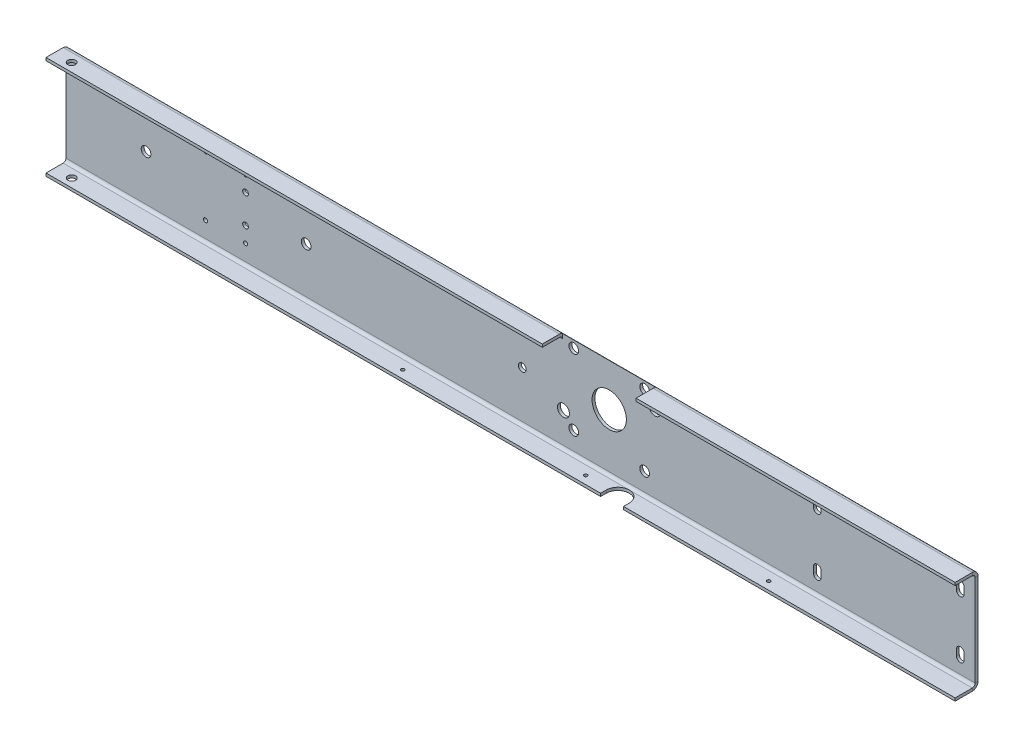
ISO-10303-21;
HEADER;
FILE_DESCRIPTION(('STEP AP214'),'2;1');
FILE_NAME('part.step','',(''),(''),'','','');
FILE_SCHEMA(('AUTOMOTIVE_DESIGN { 1 0 10303 214 1 1 1 1 }'));
ENDSEC;
DATA;
#1=APPLICATION_CONTEXT('core data for automotive mechanical design processes');
#2=APPLICATION_PROTOCOL_DEFINITION('international standard','automotive_design',2000,#1);
#3=PRODUCT_CONTEXT('',#1,'mechanical');
#4=PRODUCT('Part','Part','',(#3));
#5=PRODUCT_RELATED_PRODUCT_CATEGORY('part','',(#4));
#6=PRODUCT_DEFINITION_FORMATION('','',#4);
#7=PRODUCT_DEFINITION_CONTEXT('part definition',#1,'design');
#8=PRODUCT_DEFINITION('design','',#6,#7);
#9=PRODUCT_DEFINITION_SHAPE('','',#8);
#10=(LENGTH_UNIT() NAMED_UNIT(*) SI_UNIT(.MILLI.,.METRE.));
#11=(NAMED_UNIT(*) PLANE_ANGLE_UNIT() SI_UNIT($,.RADIAN.));
#12=(NAMED_UNIT(*) SI_UNIT($,.STERADIAN.) SOLID_ANGLE_UNIT());
#13=UNCERTAINTY_MEASURE_WITH_UNIT(LENGTH_MEASURE(1.E-05),#10,'distance_accuracy_value','');
#14=(GEOMETRIC_REPRESENTATION_CONTEXT(3) GLOBAL_UNCERTAINTY_ASSIGNED_CONTEXT((#13)) GLOBAL_UNIT_ASSIGNED_CONTEXT((#10,
#11,#12)) REPRESENTATION_CONTEXT('',''));
#15=CARTESIAN_POINT('',(0.,0.,0.));
#16=DIRECTION('',(0.,0.,1.));
#17=DIRECTION('',(1.,0.,0.));
#18=AXIS2_PLACEMENT_3D('',#15,#16,#17);
#19=CARTESIAN_POINT('',(-795.,87.5,-905.999999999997));
#20=DIRECTION('',(0.,-1.,0.));
#21=DIRECTION('',(0.,0.,0.999999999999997));
#22=AXIS2_PLACEMENT_3D('',#19,#20,#21);
#23=PLANE('',#22);
#24=DIRECTION('',(0.,0.,0.999999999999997));
#25=VECTOR('',#24,1.);
#26=CARTESIAN_POINT('',(-361.,87.5,-905.999999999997));
#27=LINE('',#26,#25);
#28=CARTESIAN_POINT('',(-361.,87.5,-920.999999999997));
#29=VERTEX_POINT('',#28);
#30=CARTESIAN_POINT('',(-361.,87.5,-905.999999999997));
#31=VERTEX_POINT('',#30);
#32=EDGE_CURVE('E470',#29,#31,#27,.T.);
#33=ORIENTED_EDGE('',*,*,#32,.T.);
#34=DIRECTION('',(1.,0.,0.));
#35=VECTOR('',#34,1.);
#36=CARTESIAN_POINT('',(-795.,87.5,-905.999999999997));
#37=LINE('',#36,#35);
#38=CARTESIAN_POINT('',(-795.,87.5,-905.999999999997));
#39=VERTEX_POINT('',#38);
#40=EDGE_CURVE('E333',#39,#31,#37,.T.);
#41=ORIENTED_EDGE('',*,*,#40,.F.);
#42=DIRECTION('',(0.,0.,0.999999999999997));
#43=VECTOR('',#42,1.);
#44=CARTESIAN_POINT('',(-795.,87.5,-905.999999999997));
#45=LINE('',#44,#43);
#46=CARTESIAN_POINT('',(-795.,87.5,-920.999999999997));
#47=VERTEX_POINT('',#46);
#48=EDGE_CURVE('E509',#47,#39,#45,.T.);
#49=ORIENTED_EDGE('',*,*,#48,.F.);
#50=DIRECTION('',(1.,0.,0.));
#51=VECTOR('',#50,1.);
#52=CARTESIAN_POINT('',(-795.,87.5,-920.999999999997));
#53=LINE('',#52,#51);
#54=EDGE_CURVE('E352',#47,#29,#53,.T.);
#55=ORIENTED_EDGE('',*,*,#54,.T.);
#56=EDGE_LOOP('',(#33,#41,#49,#55));
#57=FACE_BOUND('',#56,.T.);
#58=CARTESIAN_POINT('',(-780.,87.5,-913.499999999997));
#59=DIRECTION('',(0.,1.,0.));
#60=DIRECTION('',(0.,0.,0.999999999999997));
#61=AXIS2_PLACEMENT_3D('',#58,#59,#60);
#62=CIRCLE('',#61,3.39999999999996);
#63=CARTESIAN_POINT('',(-780.,87.5,-910.099999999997));
#64=VERTEX_POINT('',#63);
#65=EDGE_CURVE('E473',#64,#64,#62,.T.);
#66=ORIENTED_EDGE('',*,*,#65,.T.);
#67=EDGE_LOOP('',(#66));
#68=FACE_BOUND('',#67,.T.);
#69=ADVANCED_FACE('F42',(#57,#68),#23,.T.);
#70=CARTESIAN_POINT('',(-795.,85.,-920.999999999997));
#71=DIRECTION('',(1.,0.,0.));
#72=DIRECTION('',(0.,0.,0.999999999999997));
#73=AXIS2_PLACEMENT_3D('',#70,#71,#72);
#74=CYLINDRICAL_SURFACE('',#73,2.5);
#75=CARTESIAN_POINT('',(-361.,85.,-920.999999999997));
#76=DIRECTION('',(1.,0.,0.));
#77=DIRECTION('',(0.,0.,-0.999999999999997));
#78=AXIS2_PLACEMENT_3D('',#75,#76,#77);
#79=CIRCLE('',#78,2.5);
#80=CARTESIAN_POINT('',(-361.,85.,-923.499999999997));
#81=VERTEX_POINT('',#80);
#82=EDGE_CURVE('E616',#81,#29,#79,.T.);
#83=ORIENTED_EDGE('',*,*,#82,.T.);
#84=ORIENTED_EDGE('',*,*,#54,.F.);
#85=CARTESIAN_POINT('',(-795.,85.,-920.999999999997));
#86=DIRECTION('',(-1.,0.,0.));
#87=DIRECTION('',(0.,0.,0.999999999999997));
#88=AXIS2_PLACEMENT_3D('',#85,#86,#87);
#89=CIRCLE('',#88,2.5);
#90=CARTESIAN_POINT('',(-795.,85.,-923.499999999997));
#91=VERTEX_POINT('',#90);
#92=EDGE_CURVE('E530',#91,#47,#89,.F.);
#93=ORIENTED_EDGE('',*,*,#92,.F.);
#94=DIRECTION('',(1.,0.,0.));
#95=VECTOR('',#94,1.);
#96=CARTESIAN_POINT('',(-795.,85.,-923.499999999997));
#97=LINE('',#96,#95);
#98=EDGE_CURVE('E537',#91,#81,#97,.T.);
#99=ORIENTED_EDGE('',*,*,#98,.T.);
#100=EDGE_LOOP('',(#83,#84,#93,#99));
#101=FACE_BOUND('',#100,.T.);
#102=ADVANCED_FACE('F458',(#101),#74,.F.);
#103=CARTESIAN_POINT('',(-795.,90.,-905.999999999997));
#104=DIRECTION('',(0.,-1.,0.));
#105=DIRECTION('',(0.,0.,0.999999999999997));
#106=AXIS2_PLACEMENT_3D('',#103,#104,#105);
#107=PLANE('',#106);
#108=CARTESIAN_POINT('',(-780.,90.,-913.499999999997));
#109=DIRECTION('',(0.,-1.,0.));
#110=DIRECTION('',(0.,0.,-0.999999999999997));
#111=AXIS2_PLACEMENT_3D('',#108,#109,#110);
#112=CIRCLE('',#111,3.39999999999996);
#113=CARTESIAN_POINT('',(-780.,90.,-916.899999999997));
#114=VERTEX_POINT('',#113);
#115=EDGE_CURVE('E476',#114,#114,#112,.T.);
#116=ORIENTED_EDGE('',*,*,#115,.T.);
#117=EDGE_LOOP('',(#116));
#118=FACE_BOUND('',#117,.T.);
#119=DIRECTION('',(1.,0.,0.));
#120=VECTOR('',#119,1.);
#121=CARTESIAN_POINT('',(-795.,90.,-920.999999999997));
#122=LINE('',#121,#120);
#123=CARTESIAN_POINT('',(-795.,90.,-920.999999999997));
#124=VERTEX_POINT('',#123);
#125=CARTESIAN_POINT('',(-361.,90.,-920.999999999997));
#126=VERTEX_POINT('',#125);
#127=EDGE_CURVE('E344',#124,#126,#122,.T.);
#128=ORIENTED_EDGE('',*,*,#127,.F.);
#129=DIRECTION('',(0.,0.,0.999999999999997));
#130=VECTOR('',#129,1.);
#131=CARTESIAN_POINT('',(-795.,90.,-905.999999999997));
#132=LINE('',#131,#130);
#133=CARTESIAN_POINT('',(-795.,90.,-905.999999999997));
#134=VERTEX_POINT('',#133);
#135=EDGE_CURVE('E516',#124,#134,#132,.T.);
#136=ORIENTED_EDGE('',*,*,#135,.T.);
#137=DIRECTION('',(1.,0.,0.));
#138=VECTOR('',#137,1.);
#139=CARTESIAN_POINT('',(-795.,90.,-905.999999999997));
#140=LINE('',#139,#138);
#141=CARTESIAN_POINT('',(-361.,90.,-905.999999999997));
#142=VERTEX_POINT('',#141);
#143=EDGE_CURVE('E332',#134,#142,#140,.T.);
#144=ORIENTED_EDGE('',*,*,#143,.T.);
#145=DIRECTION('',(0.,0.,-0.999999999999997));
#146=VECTOR('',#145,1.);
#147=CARTESIAN_POINT('',(-361.,90.,-905.999999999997));
#148=LINE('',#147,#146);
#149=EDGE_CURVE('E325',#142,#126,#148,.T.);
#150=ORIENTED_EDGE('',*,*,#149,.T.);
#151=EDGE_LOOP('',(#128,#136,#144,#150));
#152=FACE_BOUND('',#151,.T.);
#153=ADVANCED_FACE('F392',(#118,#152),#107,.F.);
#154=CARTESIAN_POINT('',(-795.,90.,-905.999999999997));
#155=DIRECTION('',(0.,0.,-0.999999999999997));
#156=DIRECTION('',(1.,0.,0.));
#157=AXIS2_PLACEMENT_3D('',#154,#155,#156);
#158=PLANE('',#157);
#159=ORIENTED_EDGE('',*,*,#143,.F.);
#160=DIRECTION('',(0.,-1.,0.));
#161=VECTOR('',#160,1.);
#162=CARTESIAN_POINT('',(-795.,90.,-905.999999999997));
#163=LINE('',#162,#161);
#164=EDGE_CURVE('E513',#134,#39,#163,.T.);
#165=ORIENTED_EDGE('',*,*,#164,.T.);
#166=ORIENTED_EDGE('',*,*,#40,.T.);
#167=DIRECTION('',(0.,-1.,0.));
#168=VECTOR('',#167,1.);
#169=CARTESIAN_POINT('',(-361.,90.,-905.999999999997));
#170=LINE('',#169,#168);
#171=EDGE_CURVE('E11',#142,#31,#170,.T.);
#172=ORIENTED_EDGE('',*,*,#171,.F.);
#173=EDGE_LOOP('',(#159,#165,#166,#172));
#174=FACE_BOUND('',#173,.T.);
#175=ADVANCED_FACE('F396',(#174),#158,.F.);
#176=CARTESIAN_POINT('',(0.,2.49999999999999,-920.999999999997));
#177=DIRECTION('',(1.,0.,0.));
#178=DIRECTION('',(0.,0.,0.999999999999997));
#179=AXIS2_PLACEMENT_3D('',#176,#177,#178);
#180=PLANE('',#179);
#181=DIRECTION('',(0.,1.,0.));
#182=VECTOR('',#181,1.);
#183=CARTESIAN_POINT('',(0.,0.,-925.999999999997));
#184=LINE('',#183,#182);
#185=CARTESIAN_POINT('',(0.,4.99999999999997,-925.999999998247));
#186=VERTEX_POINT('',#185);
#187=CARTESIAN_POINT('',(-2.08166817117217E-13,84.9999999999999,-925.999999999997));
#188=VERTEX_POINT('',#187);
#189=EDGE_CURVE('E498',#186,#188,#184,.T.);
#190=ORIENTED_EDGE('',*,*,#189,.T.);
#191=DIRECTION('',(0.,0.,-0.999999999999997));
#192=VECTOR('',#191,1.);
#193=CARTESIAN_POINT('',(0.,85.,-923.499999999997));
#194=LINE('',#193,#192);
#195=CARTESIAN_POINT('',(0.,85.,-923.499999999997));
#196=VERTEX_POINT('',#195);
#197=EDGE_CURVE('E347',#196,#188,#194,.T.);
#198=ORIENTED_EDGE('',*,*,#197,.F.);
#199=DIRECTION('',(0.,1.,0.));
#200=VECTOR('',#199,1.);
#201=CARTESIAN_POINT('',(0.,0.,-923.499999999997));
#202=LINE('',#201,#200);
#203=CARTESIAN_POINT('',(2.08166817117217E-13,4.99999999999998,-923.499999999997));
#204=VERTEX_POINT('',#203);
#205=EDGE_CURVE('E502',#204,#196,#202,.T.);
#206=ORIENTED_EDGE('',*,*,#205,.F.);
#207=DIRECTION('',(0.,0.,0.999999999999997));
#208=VECTOR('',#207,1.);
#209=CARTESIAN_POINT('',(0.,4.99999999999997,-925.999999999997));
#210=LINE('',#209,#208);
#211=EDGE_CURVE('E587',#186,#204,#210,.T.);
#212=ORIENTED_EDGE('',*,*,#211,.F.);
#213=EDGE_LOOP('',(#190,#198,#206,#212));
#214=FACE_BOUND('',#213,.T.);
#215=ADVANCED_FACE('F417',(#214),#180,.T.);
#216=CARTESIAN_POINT('',(-795.,84.9999999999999,-925.999999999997));
#217=DIRECTION('',(-1.,0.,0.));
#218=DIRECTION('',(0.,0.,-0.999999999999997));
#219=AXIS2_PLACEMENT_3D('',#216,#217,#218);
#220=PLANE('',#219);
#221=DIRECTION('',(0.,0.,0.999999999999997));
#222=VECTOR('',#221,1.);
#223=CARTESIAN_POINT('',(-795.,84.9999999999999,-925.999999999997));
#224=LINE('',#223,#222);
#225=CARTESIAN_POINT('',(-795.,84.9999999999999,-925.999999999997));
#226=VERTEX_POINT('',#225);
#227=EDGE_CURVE('E360',#226,#91,#224,.T.);
#228=ORIENTED_EDGE('',*,*,#227,.T.);
#229=ORIENTED_EDGE('',*,*,#92,.T.);
#230=DIRECTION('',(0.,1.,0.));
#231=VECTOR('',#230,1.);
#232=CARTESIAN_POINT('',(-795.,87.5,-920.999999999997));
#233=LINE('',#232,#231);
#234=EDGE_CURVE('E356',#47,#124,#233,.T.);
#235=ORIENTED_EDGE('',*,*,#234,.T.);
#236=CARTESIAN_POINT('',(-795.,85.,-920.999999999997));
#237=DIRECTION('',(-1.,0.,0.));
#238=DIRECTION('',(0.,0.,0.999999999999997));
#239=AXIS2_PLACEMENT_3D('',#236,#237,#238);
#240=CIRCLE('',#239,5.);
#241=EDGE_CURVE('E520',#226,#124,#240,.F.);
#242=ORIENTED_EDGE('',*,*,#241,.F.);
#243=EDGE_LOOP('',(#228,#229,#235,#242));
#244=FACE_BOUND('',#243,.T.);
#245=ADVANCED_FACE('F413',(#244),#220,.T.);
#246=CARTESIAN_POINT('',(-795.,87.5,-920.999999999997));
#247=DIRECTION('',(-1.,0.,0.));
#248=DIRECTION('',(0.,0.,-0.999999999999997));
#249=AXIS2_PLACEMENT_3D('',#246,#247,#248);
#250=PLANE('',#249);
#251=DIRECTION('',(0.,1.,0.));
#252=VECTOR('',#251,1.);
#253=CARTESIAN_POINT('',(-795.,0.,-925.999999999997));
#254=LINE('',#253,#252);
#255=CARTESIAN_POINT('',(-795.,5.00000000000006,-925.999999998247));
#256=VERTEX_POINT('',#255);
#257=EDGE_CURVE('E523',#256,#226,#254,.T.);
#258=ORIENTED_EDGE('',*,*,#257,.F.);
#259=DIRECTION('',(0.,0.,-0.999999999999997));
#260=VECTOR('',#259,1.);
#261=CARTESIAN_POINT('',(-795.,5.00000000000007,-923.499999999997));
#262=LINE('',#261,#260);
#263=CARTESIAN_POINT('',(-795.,5.00000000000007,-923.499999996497));
#264=VERTEX_POINT('',#263);
#265=EDGE_CURVE('E598',#264,#256,#262,.T.);
#266=ORIENTED_EDGE('',*,*,#265,.F.);
#267=DIRECTION('',(0.,1.,0.));
#268=VECTOR('',#267,1.);
#269=CARTESIAN_POINT('',(-795.,0.,-923.499999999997));
#270=LINE('',#269,#268);
#271=EDGE_CURVE('E527',#264,#91,#270,.T.);
#272=ORIENTED_EDGE('',*,*,#271,.T.);
#273=ORIENTED_EDGE('',*,*,#227,.F.);
#274=EDGE_LOOP('',(#258,#266,#272,#273));
#275=FACE_BOUND('',#274,.T.);
#276=ADVANCED_FACE('F409',(#275),#250,.T.);
#277=CARTESIAN_POINT('',(0.,90.,-920.999999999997));
#278=DIRECTION('',(1.,0.,0.));
#279=DIRECTION('',(0.,0.,0.999999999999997));
#280=AXIS2_PLACEMENT_3D('',#277,#278,#279);
#281=PLANE('',#280);
#282=DIRECTION('',(0.,-1.,0.));
#283=VECTOR('',#282,1.);
#284=CARTESIAN_POINT('',(0.,90.,-920.999999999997));
#285=LINE('',#284,#283);
#286=CARTESIAN_POINT('',(0.,90.,-920.999999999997));
#287=VERTEX_POINT('',#286);
#288=CARTESIAN_POINT('',(2.08166817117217E-13,87.5,-920.999999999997));
#289=VERTEX_POINT('',#288);
#290=EDGE_CURVE('E351',#287,#289,#285,.T.);
#291=ORIENTED_EDGE('',*,*,#290,.T.);
#292=CARTESIAN_POINT('',(0.,85.,-920.999999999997));
#293=DIRECTION('',(-1.,0.,0.));
#294=DIRECTION('',(0.,0.,0.999999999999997));
#295=AXIS2_PLACEMENT_3D('',#292,#293,#294);
#296=CIRCLE('',#295,2.5);
#297=EDGE_CURVE('E506',#196,#289,#296,.F.);
#298=ORIENTED_EDGE('',*,*,#297,.F.);
#299=ORIENTED_EDGE('',*,*,#197,.T.);
#300=CARTESIAN_POINT('',(0.,85.,-920.999999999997));
#301=DIRECTION('',(-1.,0.,0.));
#302=DIRECTION('',(0.,0.,0.999999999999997));
#303=AXIS2_PLACEMENT_3D('',#300,#301,#302);
#304=CIRCLE('',#303,5.);
#305=EDGE_CURVE('E494',#188,#287,#304,.F.);
#306=ORIENTED_EDGE('',*,*,#305,.T.);
#307=EDGE_LOOP('',(#291,#298,#299,#306));
#308=FACE_BOUND('',#307,.T.);
#309=ADVANCED_FACE('F405',(#308),#281,.T.);
#310=CARTESIAN_POINT('',(0.,85.,-923.499999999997));
#311=DIRECTION('',(1.,0.,0.));
#312=DIRECTION('',(0.,0.,0.999999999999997));
#313=AXIS2_PLACEMENT_3D('',#310,#311,#312);
#314=PLANE('',#313);
#315=DIRECTION('',(0.,0.,0.999999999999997));
#316=VECTOR('',#315,1.);
#317=CARTESIAN_POINT('',(2.08166817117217E-13,90.,-905.999999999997));
#318=LINE('',#317,#316);
#319=CARTESIAN_POINT('',(2.08166817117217E-13,90.,-905.999999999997));
#320=VERTEX_POINT('',#319);
#321=EDGE_CURVE('E491',#287,#320,#318,.T.);
#322=ORIENTED_EDGE('',*,*,#321,.T.);
#323=DIRECTION('',(0.,-1.,0.));
#324=VECTOR('',#323,1.);
#325=CARTESIAN_POINT('',(2.08166817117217E-13,90.,-905.999999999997));
#326=LINE('',#325,#324);
#327=CARTESIAN_POINT('',(2.08166817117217E-13,87.5,-905.999999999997));
#328=VERTEX_POINT('',#327);
#329=EDGE_CURVE('E329',#320,#328,#326,.T.);
#330=ORIENTED_EDGE('',*,*,#329,.T.);
#331=DIRECTION('',(0.,0.,0.999999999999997));
#332=VECTOR('',#331,1.);
#333=CARTESIAN_POINT('',(2.08166817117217E-13,87.5,-905.999999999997));
#334=LINE('',#333,#332);
#335=EDGE_CURVE('E475',#289,#328,#334,.T.);
#336=ORIENTED_EDGE('',*,*,#335,.F.);
#337=ORIENTED_EDGE('',*,*,#290,.F.);
#338=EDGE_LOOP('',(#322,#330,#336,#337));
#339=FACE_BOUND('',#338,.T.);
#340=ADVANCED_FACE('F401',(#339),#314,.T.);
#341=DIRECTION('',(0.,0.,-0.999999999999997));
#342=VECTOR('',#341,1.);
#343=CARTESIAN_POINT('',(-279.,87.5,-905.999999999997));
#344=LINE('',#343,#342);
#345=CARTESIAN_POINT('',(-279.,87.5,-905.999999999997));
#346=VERTEX_POINT('',#345);
#347=CARTESIAN_POINT('',(-279.,87.5,-920.999999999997));
#348=VERTEX_POINT('',#347);
#349=EDGE_CURVE('E310',#346,#348,#344,.T.);
#350=ORIENTED_EDGE('',*,*,#349,.T.);
#351=EDGE_CURVE('E536',#348,#289,#53,.T.);
#352=ORIENTED_EDGE('',*,*,#351,.T.);
#353=ORIENTED_EDGE('',*,*,#335,.T.);
#354=EDGE_CURVE('E341',#346,#328,#37,.T.);
#355=ORIENTED_EDGE('',*,*,#354,.F.);
#356=EDGE_LOOP('',(#350,#352,#353,#355));
#357=FACE_BOUND('',#356,.T.);
#358=ADVANCED_FACE('F397',(#357),#23,.T.);
#359=CARTESIAN_POINT('',(-279.,85.,-920.999999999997));
#360=DIRECTION('',(-1.,0.,0.));
#361=DIRECTION('',(0.,0.,0.999999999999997));
#362=AXIS2_PLACEMENT_3D('',#359,#360,#361);
#363=CIRCLE('',#362,2.5);
#364=CARTESIAN_POINT('',(-279.,85.,-923.499999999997));
#365=VERTEX_POINT('',#364);
#366=EDGE_CURVE('E639',#348,#365,#363,.T.);
#367=ORIENTED_EDGE('',*,*,#366,.T.);
#368=EDGE_CURVE('E540',#365,#196,#97,.T.);
#369=ORIENTED_EDGE('',*,*,#368,.T.);
#370=ORIENTED_EDGE('',*,*,#297,.T.);
#371=ORIENTED_EDGE('',*,*,#351,.F.);
#372=EDGE_LOOP('',(#367,#369,#370,#371));
#373=FACE_BOUND('',#372,.T.);
#374=ADVANCED_FACE('F400',(#373),#74,.F.);
#375=CARTESIAN_POINT('',(-795.,0.,-923.499999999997));
#376=DIRECTION('',(0.,0.,0.999999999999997));
#377=DIRECTION('',(-1.,0.,0.));
#378=AXIS2_PLACEMENT_3D('',#375,#376,#377);
#379=PLANE('',#378);
#380=CARTESIAN_POINT('',(-351.,83.,-923.499999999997));
#381=DIRECTION('',(0.,0.,-0.999999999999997));
#382=DIRECTION('',(-1.,0.,0.));
#383=AXIS2_PLACEMENT_3D('',#380,#381,#382);
#384=CIRCLE('',#383,4.24999999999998);
#385=CARTESIAN_POINT('',(-355.25,83.,-923.499999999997));
#386=VERTEX_POINT('',#385);
#387=EDGE_CURVE('E1091',#386,#386,#384,.T.);
#388=ORIENTED_EDGE('',*,*,#387,.T.);
#389=EDGE_LOOP('',(#388));
#390=FACE_BOUND('',#389,.T.);
#391=CARTESIAN_POINT('',(-289.,83.,-923.499999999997));
#392=DIRECTION('',(0.,0.,-0.999999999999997));
#393=DIRECTION('',(-1.,0.,0.));
#394=AXIS2_PLACEMENT_3D('',#391,#392,#393);
#395=CIRCLE('',#394,4.24999999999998);
#396=CARTESIAN_POINT('',(-293.25,83.,-923.499999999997));
#397=VERTEX_POINT('',#396);
#398=EDGE_CURVE('E1017',#397,#397,#395,.T.);
#399=ORIENTED_EDGE('',*,*,#398,.T.);
#400=EDGE_LOOP('',(#399));
#401=FACE_BOUND('',#400,.T.);
#402=CARTESIAN_POINT('',(-138.,72.6,-923.499999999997));
#403=DIRECTION('',(0.,0.,-0.999999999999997));
#404=DIRECTION('',(-1.,0.,0.));
#405=AXIS2_PLACEMENT_3D('',#402,#403,#404);
#406=CIRCLE('',#405,3.4);
#407=CARTESIAN_POINT('',(-134.6,72.6,-923.499999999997));
#408=VERTEX_POINT('',#407);
#409=CARTESIAN_POINT('',(-141.4,72.6,-923.499999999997));
#410=VERTEX_POINT('',#409);
#411=EDGE_CURVE('E690',#408,#410,#406,.F.);
#412=ORIENTED_EDGE('',*,*,#411,.F.);
#413=DIRECTION('',(0.,1.,0.));
#414=VECTOR('',#413,1.);
#415=CARTESIAN_POINT('',(-134.6,72.6,-923.499999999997));
#416=LINE('',#415,#414);
#417=CARTESIAN_POINT('',(-134.6,67.4,-923.499999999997));
#418=VERTEX_POINT('',#417);
#419=EDGE_CURVE('E683',#418,#408,#416,.T.);
#420=ORIENTED_EDGE('',*,*,#419,.F.);
#421=CARTESIAN_POINT('',(-138.,67.4,-923.499999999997));
#422=DIRECTION('',(0.,0.,-0.999999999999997));
#423=DIRECTION('',(-1.,0.,0.));
#424=AXIS2_PLACEMENT_3D('',#421,#422,#423);
#425=CIRCLE('',#424,3.4);
#426=CARTESIAN_POINT('',(-141.4,67.4,-923.499999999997));
#427=VERTEX_POINT('',#426);
#428=EDGE_CURVE('E672',#427,#418,#425,.F.);
#429=ORIENTED_EDGE('',*,*,#428,.F.);
#430=DIRECTION('',(0.,-1.,0.));
#431=VECTOR('',#430,1.);
#432=CARTESIAN_POINT('',(-141.4,72.6,-923.499999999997));
#433=LINE('',#432,#431);
#434=EDGE_CURVE('E655',#410,#427,#433,.T.);
#435=ORIENTED_EDGE('',*,*,#434,.F.);
#436=EDGE_LOOP('',(#412,#420,#429,#435));
#437=FACE_BOUND('',#436,.T.);
#438=CARTESIAN_POINT('',(-13.,72.5999999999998,-923.499999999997));
#439=DIRECTION('',(0.,0.,-0.999999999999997));
#440=DIRECTION('',(-1.,0.,0.));
#441=AXIS2_PLACEMENT_3D('',#438,#439,#440);
#442=CIRCLE('',#441,3.4);
#443=CARTESIAN_POINT('',(-9.59999999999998,72.6,-923.499999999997));
#444=VERTEX_POINT('',#443);
#445=CARTESIAN_POINT('',(-16.4,72.6,-923.499999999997));
#446=VERTEX_POINT('',#445);
#447=EDGE_CURVE('E702',#444,#446,#442,.F.);
#448=ORIENTED_EDGE('',*,*,#447,.F.);
#449=DIRECTION('',(0.,1.,0.));
#450=VECTOR('',#449,1.);
#451=CARTESIAN_POINT('',(-9.59999999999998,72.6,-923.499999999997));
#452=LINE('',#451,#450);
#453=CARTESIAN_POINT('',(-9.59999999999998,67.4,-923.499999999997));
#454=VERTEX_POINT('',#453);
#455=EDGE_CURVE('E698',#454,#444,#452,.T.);
#456=ORIENTED_EDGE('',*,*,#455,.F.);
#457=CARTESIAN_POINT('',(-13.,67.3999999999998,-923.499999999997));
#458=DIRECTION('',(0.,0.,-0.999999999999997));
#459=DIRECTION('',(-1.,0.,0.));
#460=AXIS2_PLACEMENT_3D('',#457,#458,#459);
#461=CIRCLE('',#460,3.4);
#462=CARTESIAN_POINT('',(-16.4,67.4,-923.499999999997));
#463=VERTEX_POINT('',#462);
#464=EDGE_CURVE('E694',#463,#454,#461,.F.);
#465=ORIENTED_EDGE('',*,*,#464,.F.);
#466=DIRECTION('',(0.,-1.,0.));
#467=VECTOR('',#466,1.);
#468=CARTESIAN_POINT('',(-16.4,72.6,-923.499999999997));
#469=LINE('',#468,#467);
#470=EDGE_CURVE('E726',#446,#463,#469,.T.);
#471=ORIENTED_EDGE('',*,*,#470,.F.);
#472=EDGE_LOOP('',(#448,#456,#465,#471));
#473=FACE_BOUND('',#472,.T.);
#474=CARTESIAN_POINT('',(-638.,57.5,-923.499999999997));
#475=DIRECTION('',(0.,0.,-0.999999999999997));
#476=DIRECTION('',(-1.,0.,0.));
#477=AXIS2_PLACEMENT_3D('',#474,#475,#476);
#478=CIRCLE('',#477,2.49999999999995);
#479=CARTESIAN_POINT('',(-635.5,57.5,-923.499999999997));
#480=VERTEX_POINT('',#479);
#481=EDGE_CURVE('E742',#480,#480,#478,.T.);
#482=ORIENTED_EDGE('',*,*,#481,.T.);
#483=EDGE_LOOP('',(#482));
#484=FACE_BOUND('',#483,.T.);
#485=CARTESIAN_POINT('',(-638.,32.5,-923.499999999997));
#486=DIRECTION('',(0.,0.,-0.999999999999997));
#487=DIRECTION('',(-1.,0.,0.));
#488=AXIS2_PLACEMENT_3D('',#485,#486,#487);
#489=CIRCLE('',#488,2.49999999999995);
#490=CARTESIAN_POINT('',(-635.5,32.5,-923.499999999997));
#491=VERTEX_POINT('',#490);
#492=EDGE_CURVE('E750',#491,#491,#489,.T.);
#493=ORIENTED_EDGE('',*,*,#492,.T.);
#494=EDGE_LOOP('',(#493));
#495=FACE_BOUND('',#494,.T.);
#496=CARTESIAN_POINT('',(-638.,71.,-923.499999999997));
#497=DIRECTION('',(0.,0.,-0.999999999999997));
#498=DIRECTION('',(-1.,0.,0.));
#499=AXIS2_PLACEMENT_3D('',#496,#497,#498);
#500=CIRCLE('',#499,1.75000000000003);
#501=CARTESIAN_POINT('',(-636.25,71.,-923.499999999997));
#502=VERTEX_POINT('',#501);
#503=EDGE_CURVE('E758',#502,#502,#500,.T.);
#504=ORIENTED_EDGE('',*,*,#503,.T.);
#505=EDGE_LOOP('',(#504));
#506=FACE_BOUND('',#505,.T.);
#507=CARTESIAN_POINT('',(-673.,19.,-923.499999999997));
#508=DIRECTION('',(0.,0.,-0.999999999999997));
#509=DIRECTION('',(-1.,0.,0.));
#510=AXIS2_PLACEMENT_3D('',#507,#508,#509);
#511=CIRCLE('',#510,1.75000000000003);
#512=CARTESIAN_POINT('',(-671.25,19.0000000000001,-923.499999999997));
#513=VERTEX_POINT('',#512);
#514=EDGE_CURVE('E766',#513,#513,#511,.T.);
#515=ORIENTED_EDGE('',*,*,#514,.T.);
#516=EDGE_LOOP('',(#515));
#517=FACE_BOUND('',#516,.T.);
#518=CARTESIAN_POINT('',(-673.,71.,-923.499999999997));
#519=DIRECTION('',(0.,0.,-0.999999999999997));
#520=DIRECTION('',(-1.,0.,0.));
#521=AXIS2_PLACEMENT_3D('',#518,#519,#520);
#522=CIRCLE('',#521,1.75000000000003);
#523=CARTESIAN_POINT('',(-671.25,71.,-923.499999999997));
#524=VERTEX_POINT('',#523);
#525=EDGE_CURVE('E774',#524,#524,#522,.T.);
#526=ORIENTED_EDGE('',*,*,#525,.T.);
#527=EDGE_LOOP('',(#526));
#528=FACE_BOUND('',#527,.T.);
#529=CARTESIAN_POINT('',(-638.,19.0000000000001,-923.499999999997));
#530=DIRECTION('',(0.,0.,-0.999999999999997));
#531=DIRECTION('',(-1.,0.,0.));
#532=AXIS2_PLACEMENT_3D('',#529,#530,#531);
#533=CIRCLE('',#532,1.75000000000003);
#534=CARTESIAN_POINT('',(-636.25,19.0000000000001,-923.499999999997));
#535=VERTEX_POINT('',#534);
#536=EDGE_CURVE('E782',#535,#535,#533,.T.);
#537=ORIENTED_EDGE('',*,*,#536,.T.);
#538=EDGE_LOOP('',(#537));
#539=FACE_BOUND('',#538,.T.);
#540=CARTESIAN_POINT('',(-396.000000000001,46.,-923.499999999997));
#541=DIRECTION('',(0.,0.,-0.999999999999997));
#542=DIRECTION('',(-1.,0.,0.));
#543=AXIS2_PLACEMENT_3D('',#540,#541,#542);
#544=CIRCLE('',#543,3.40000000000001);
#545=CARTESIAN_POINT('',(-392.600000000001,46.,-923.499999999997));
#546=VERTEX_POINT('',#545);
#547=EDGE_CURVE('E790',#546,#546,#544,.T.);
#548=ORIENTED_EDGE('',*,*,#547,.T.);
#549=EDGE_LOOP('',(#548));
#550=FACE_BOUND('',#549,.T.);
#551=CARTESIAN_POINT('',(-251.,75.,-923.499999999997));
#552=DIRECTION('',(0.,0.,-0.999999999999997));
#553=DIRECTION('',(-1.,0.,0.));
#554=AXIS2_PLACEMENT_3D('',#551,#552,#553);
#555=CIRCLE('',#554,3.39999999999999);
#556=CARTESIAN_POINT('',(-247.6,75.,-923.499999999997));
#557=VERTEX_POINT('',#556);
#558=EDGE_CURVE('E798',#557,#557,#555,.T.);
#559=ORIENTED_EDGE('',*,*,#558,.T.);
#560=EDGE_LOOP('',(#559));
#561=FACE_BOUND('',#560,.T.);
#562=CARTESIAN_POINT('',(-320.,52.,-923.499999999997));
#563=DIRECTION('',(0.,0.,-0.999999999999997));
#564=DIRECTION('',(-1.,0.,0.));
#565=AXIS2_PLACEMENT_3D('',#562,#563,#564);
#566=CIRCLE('',#565,15.);
#567=CARTESIAN_POINT('',(-305.,52.,-923.499999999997));
#568=VERTEX_POINT('',#567);
#569=EDGE_CURVE('E824',#568,#568,#566,.T.);
#570=ORIENTED_EDGE('',*,*,#569,.T.);
#571=EDGE_LOOP('',(#570));
#572=FACE_BOUND('',#571,.T.);
#573=CARTESIAN_POINT('',(-360.,31.5,-923.499999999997));
#574=DIRECTION('',(0.,0.,-0.999999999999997));
#575=DIRECTION('',(-1.,0.,0.));
#576=AXIS2_PLACEMENT_3D('',#573,#574,#575);
#577=CIRCLE('',#576,5.24999999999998);
#578=CARTESIAN_POINT('',(-354.75,31.5,-923.499999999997));
#579=VERTEX_POINT('',#578);
#580=EDGE_CURVE('E1062',#579,#579,#577,.T.);
#581=ORIENTED_EDGE('',*,*,#580,.T.);
#582=EDGE_LOOP('',(#581));
#583=FACE_BOUND('',#582,.T.);
#584=CARTESIAN_POINT('',(-280.000000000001,72.5,-923.499999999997));
#585=DIRECTION('',(0.,0.,-0.999999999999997));
#586=DIRECTION('',(-1.,0.,0.));
#587=AXIS2_PLACEMENT_3D('',#584,#585,#586);
#588=CIRCLE('',#587,5.24999999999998);
#589=CARTESIAN_POINT('',(-274.750000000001,72.5,-923.499999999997));
#590=VERTEX_POINT('',#589);
#591=EDGE_CURVE('E1076',#590,#590,#588,.T.);
#592=ORIENTED_EDGE('',*,*,#591,.T.);
#593=EDGE_LOOP('',(#592));
#594=FACE_BOUND('',#593,.T.);
#595=CARTESIAN_POINT('',(-725.,45.,-923.499999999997));
#596=DIRECTION('',(0.,0.,-0.999999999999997));
#597=DIRECTION('',(-1.,0.,0.));
#598=AXIS2_PLACEMENT_3D('',#595,#596,#597);
#599=CIRCLE('',#598,4.24999999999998);
#600=CARTESIAN_POINT('',(-720.75,45.,-923.499999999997));
#601=VERTEX_POINT('',#600);
#602=EDGE_CURVE('E1084',#601,#601,#599,.T.);
#603=ORIENTED_EDGE('',*,*,#602,.T.);
#604=EDGE_LOOP('',(#603));
#605=FACE_BOUND('',#604,.T.);
#606=ORIENTED_EDGE('',*,*,#98,.F.);
#607=ORIENTED_EDGE('',*,*,#271,.F.);
#608=DIRECTION('',(1.,0.,0.));
#609=VECTOR('',#608,1.);
#610=CARTESIAN_POINT('',(-795.,5.00000000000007,-923.499999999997));
#611=LINE('',#610,#609);
#612=EDGE_CURVE('E584',#264,#204,#611,.T.);
#613=ORIENTED_EDGE('',*,*,#612,.T.);
#614=ORIENTED_EDGE('',*,*,#205,.T.);
#615=ORIENTED_EDGE('',*,*,#368,.F.);
#616=DIRECTION('',(0.,1.,0.));
#617=VECTOR('',#616,1.);
#618=CARTESIAN_POINT('',(-279.,85.,-923.499999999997));
#619=LINE('',#618,#617);
#620=CARTESIAN_POINT('',(-279.,89.3301270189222,-923.499999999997));
#621=VERTEX_POINT('',#620);
#622=EDGE_CURVE('E629',#365,#621,#619,.T.);
#623=ORIENTED_EDGE('',*,*,#622,.T.);
#624=DIRECTION('',(1.,0.,0.));
#625=VECTOR('',#624,1.);
#626=CARTESIAN_POINT('',(-795.,89.3301270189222,-923.499999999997));
#627=LINE('',#626,#625);
#628=CARTESIAN_POINT('',(-361.,89.3301270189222,-923.499999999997));
#629=VERTEX_POINT('',#628);
#630=EDGE_CURVE('E632',#621,#629,#627,.F.);
#631=ORIENTED_EDGE('',*,*,#630,.T.);
#632=DIRECTION('',(0.,1.,0.));
#633=VECTOR('',#632,1.);
#634=CARTESIAN_POINT('',(-361.,85.,-923.499999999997));
#635=LINE('',#634,#633);
#636=EDGE_CURVE('E324',#81,#629,#635,.T.);
#637=ORIENTED_EDGE('',*,*,#636,.F.);
#638=EDGE_LOOP('',(#606,#607,#613,#614,#615,#623,#631,#637));
#639=FACE_BOUND('',#638,.T.);
#640=CARTESIAN_POINT('',(-585.,45.,-923.499999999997));
#641=DIRECTION('',(0.,0.,-0.999999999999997));
#642=DIRECTION('',(-1.,0.,0.));
#643=AXIS2_PLACEMENT_3D('',#640,#641,#642);
#644=CIRCLE('',#643,4.24999999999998);
#645=CARTESIAN_POINT('',(-580.75,45.,-923.499999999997));
#646=VERTEX_POINT('',#645);
#647=EDGE_CURVE('E1011',#646,#646,#644,.T.);
#648=ORIENTED_EDGE('',*,*,#647,.T.);
#649=EDGE_LOOP('',(#648));
#650=FACE_BOUND('',#649,.T.);
#651=CARTESIAN_POINT('',(-351.,21.0000000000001,-923.499999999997));
#652=DIRECTION('',(0.,0.,-0.999999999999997));
#653=DIRECTION('',(-1.,0.,0.));
#654=AXIS2_PLACEMENT_3D('',#651,#652,#653);
#655=CIRCLE('',#654,4.24999999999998);
#656=CARTESIAN_POINT('',(-346.75,21.0000000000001,-923.499999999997));
#657=VERTEX_POINT('',#656);
#658=EDGE_CURVE('E1031',#657,#657,#655,.T.);
#659=ORIENTED_EDGE('',*,*,#658,.T.);
#660=EDGE_LOOP('',(#659));
#661=FACE_BOUND('',#660,.T.);
#662=CARTESIAN_POINT('',(-289.,21.,-923.499999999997));
#663=DIRECTION('',(0.,0.,-0.999999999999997));
#664=DIRECTION('',(-1.,0.,0.));
#665=AXIS2_PLACEMENT_3D('',#662,#663,#664);
#666=CIRCLE('',#665,4.24999999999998);
#667=CARTESIAN_POINT('',(-284.75,21.0000000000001,-923.499999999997));
#668=VERTEX_POINT('',#667);
#669=EDGE_CURVE('E485',#668,#668,#666,.T.);
#670=ORIENTED_EDGE('',*,*,#669,.T.);
#671=EDGE_LOOP('',(#670));
#672=FACE_BOUND('',#671,.T.);
#673=CARTESIAN_POINT('',(-13.,22.6,-923.499999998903));
#674=DIRECTION('',(0.,0.,-0.999999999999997));
#675=DIRECTION('',(-1.,0.,0.));
#676=AXIS2_PLACEMENT_3D('',#673,#674,#675);
#677=CIRCLE('',#676,3.4);
#678=CARTESIAN_POINT('',(-9.6,22.6,-923.499999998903));
#679=VERTEX_POINT('',#678);
#680=CARTESIAN_POINT('',(-16.3999999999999,22.6,-923.499999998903));
#681=VERTEX_POINT('',#680);
#682=EDGE_CURVE('E911',#679,#681,#677,.F.);
#683=ORIENTED_EDGE('',*,*,#682,.F.);
#684=DIRECTION('',(0.,1.,0.));
#685=VECTOR('',#684,1.);
#686=CARTESIAN_POINT('',(-9.6,22.6,-923.499999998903));
#687=LINE('',#686,#685);
#688=CARTESIAN_POINT('',(-9.6,17.4,-923.499999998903));
#689=VERTEX_POINT('',#688);
#690=EDGE_CURVE('E923',#689,#679,#687,.T.);
#691=ORIENTED_EDGE('',*,*,#690,.F.);
#692=CARTESIAN_POINT('',(-13.,17.4,-923.499999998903));
#693=DIRECTION('',(0.,0.,-0.999999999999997));
#694=DIRECTION('',(-1.,0.,0.));
#695=AXIS2_PLACEMENT_3D('',#692,#693,#694);
#696=CIRCLE('',#695,3.4);
#697=CARTESIAN_POINT('',(-16.4,17.4,-923.499999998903));
#698=VERTEX_POINT('',#697);
#699=EDGE_CURVE('E919',#698,#689,#696,.F.);
#700=ORIENTED_EDGE('',*,*,#699,.F.);
#701=DIRECTION('',(0.,-1.,0.));
#702=VECTOR('',#701,1.);
#703=CARTESIAN_POINT('',(-16.3999999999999,22.6,-923.499999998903));
#704=LINE('',#703,#702);
#705=EDGE_CURVE('E915',#681,#698,#704,.T.);
#706=ORIENTED_EDGE('',*,*,#705,.F.);
#707=EDGE_LOOP('',(#683,#691,#700,#706));
#708=FACE_BOUND('',#707,.T.);
#709=CARTESIAN_POINT('',(-138.,22.6,-923.499999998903));
#710=DIRECTION('',(0.,0.,-0.999999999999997));
#711=DIRECTION('',(-1.,0.,0.));
#712=AXIS2_PLACEMENT_3D('',#709,#710,#711);
#713=CIRCLE('',#712,3.4);
#714=CARTESIAN_POINT('',(-134.6,22.6,-923.499999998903));
#715=VERTEX_POINT('',#714);
#716=CARTESIAN_POINT('',(-141.4,22.6,-923.499999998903));
#717=VERTEX_POINT('',#716);
#718=EDGE_CURVE('E954',#715,#717,#713,.F.);
#719=ORIENTED_EDGE('',*,*,#718,.F.);
#720=DIRECTION('',(0.,1.,0.));
#721=VECTOR('',#720,1.);
#722=CARTESIAN_POINT('',(-134.6,22.6,-923.499999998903));
#723=LINE('',#722,#721);
#724=CARTESIAN_POINT('',(-134.6,17.4,-923.499999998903));
#725=VERTEX_POINT('',#724);
#726=EDGE_CURVE('E964',#725,#715,#723,.T.);
#727=ORIENTED_EDGE('',*,*,#726,.F.);
#728=CARTESIAN_POINT('',(-138.,17.4,-923.499999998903));
#729=DIRECTION('',(0.,0.,-0.999999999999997));
#730=DIRECTION('',(-1.,0.,0.));
#731=AXIS2_PLACEMENT_3D('',#728,#729,#730);
#732=CIRCLE('',#731,3.4);
#733=CARTESIAN_POINT('',(-141.4,17.4,-923.499999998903));
#734=VERTEX_POINT('',#733);
#735=EDGE_CURVE('E961',#734,#725,#732,.F.);
#736=ORIENTED_EDGE('',*,*,#735,.F.);
#737=DIRECTION('',(0.,-1.,0.));
#738=VECTOR('',#737,1.);
#739=CARTESIAN_POINT('',(-141.4,22.6,-923.499999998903));
#740=LINE('',#739,#738);
#741=EDGE_CURVE('E957',#717,#734,#740,.T.);
#742=ORIENTED_EDGE('',*,*,#741,.F.);
#743=EDGE_LOOP('',(#719,#727,#736,#742));
#744=FACE_BOUND('',#743,.T.);
#745=ADVANCED_FACE('F579',(#390,#401,#437,#473,#484,#495,#506,#517,#528,#539,#550,#561,#572,
#583,#594,#605,#639,#650,#661,#672,#708,#744),#379,.T.);
#746=CARTESIAN_POINT('',(-795.,0.,-925.999999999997));
#747=DIRECTION('',(0.,0.,0.999999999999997));
#748=DIRECTION('',(-1.,0.,0.));
#749=AXIS2_PLACEMENT_3D('',#746,#747,#748);
#750=PLANE('',#749);
#751=DIRECTION('',(0.,-1.,0.));
#752=VECTOR('',#751,1.);
#753=CARTESIAN_POINT('',(-141.4,72.6,-925.999999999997));
#754=LINE('',#753,#752);
#755=CARTESIAN_POINT('',(-141.4,72.6,-925.999999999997));
#756=VERTEX_POINT('',#755);
#757=CARTESIAN_POINT('',(-141.4,67.4,-925.999999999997));
#758=VERTEX_POINT('',#757);
#759=EDGE_CURVE('E651',#756,#758,#754,.T.);
#760=ORIENTED_EDGE('',*,*,#759,.T.);
#761=CARTESIAN_POINT('',(-138.,67.4,-925.999999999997));
#762=DIRECTION('',(0.,0.,0.999999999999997));
#763=DIRECTION('',(1.,0.,0.));
#764=AXIS2_PLACEMENT_3D('',#761,#762,#763);
#765=CIRCLE('',#764,3.4);
#766=CARTESIAN_POINT('',(-134.6,67.4,-925.999999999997));
#767=VERTEX_POINT('',#766);
#768=EDGE_CURVE('E665',#758,#767,#765,.T.);
#769=ORIENTED_EDGE('',*,*,#768,.T.);
#770=DIRECTION('',(0.,1.,0.));
#771=VECTOR('',#770,1.);
#772=CARTESIAN_POINT('',(-134.6,72.6,-925.999999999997));
#773=LINE('',#772,#771);
#774=CARTESIAN_POINT('',(-134.6,72.6,-925.999999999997));
#775=VERTEX_POINT('',#774);
#776=EDGE_CURVE('E676',#767,#775,#773,.T.);
#777=ORIENTED_EDGE('',*,*,#776,.T.);
#778=CARTESIAN_POINT('',(-138.,72.6,-925.999999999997));
#779=DIRECTION('',(0.,0.,0.999999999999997));
#780=DIRECTION('',(1.,0.,0.));
#781=AXIS2_PLACEMENT_3D('',#778,#779,#780);
#782=CIRCLE('',#781,3.4);
#783=EDGE_CURVE('E687',#775,#756,#782,.T.);
#784=ORIENTED_EDGE('',*,*,#783,.T.);
#785=EDGE_LOOP('',(#760,#769,#777,#784));
#786=FACE_BOUND('',#785,.T.);
#787=DIRECTION('',(0.,-1.,0.));
#788=VECTOR('',#787,1.);
#789=CARTESIAN_POINT('',(-16.4,72.6,-925.999999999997));
#790=LINE('',#789,#788);
#791=CARTESIAN_POINT('',(-16.4,72.6,-925.999999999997));
#792=VERTEX_POINT('',#791);
#793=CARTESIAN_POINT('',(-16.3999999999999,67.4,-925.999999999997));
#794=VERTEX_POINT('',#793);
#795=EDGE_CURVE('E710',#792,#794,#790,.T.);
#796=ORIENTED_EDGE('',*,*,#795,.T.);
#797=CARTESIAN_POINT('',(-13.,67.3999999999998,-925.999999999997));
#798=DIRECTION('',(0.,0.,0.999999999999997));
#799=DIRECTION('',(1.,0.,0.));
#800=AXIS2_PLACEMENT_3D('',#797,#798,#799);
#801=CIRCLE('',#800,3.4);
#802=CARTESIAN_POINT('',(-9.6,67.4,-925.999999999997));
#803=VERTEX_POINT('',#802);
#804=EDGE_CURVE('E714',#794,#803,#801,.T.);
#805=ORIENTED_EDGE('',*,*,#804,.T.);
#806=DIRECTION('',(0.,1.,0.));
#807=VECTOR('',#806,1.);
#808=CARTESIAN_POINT('',(-9.59999999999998,72.6,-925.999999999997));
#809=LINE('',#808,#807);
#810=CARTESIAN_POINT('',(-9.59999999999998,72.6,-925.999999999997));
#811=VERTEX_POINT('',#810);
#812=EDGE_CURVE('E718',#803,#811,#809,.T.);
#813=ORIENTED_EDGE('',*,*,#812,.T.);
#814=CARTESIAN_POINT('',(-13.,72.5999999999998,-925.999999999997));
#815=DIRECTION('',(0.,0.,0.999999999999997));
#816=DIRECTION('',(1.,0.,0.));
#817=AXIS2_PLACEMENT_3D('',#814,#815,#816);
#818=CIRCLE('',#817,3.4);
#819=EDGE_CURVE('E706',#811,#792,#818,.T.);
#820=ORIENTED_EDGE('',*,*,#819,.T.);
#821=EDGE_LOOP('',(#796,#805,#813,#820));
#822=FACE_BOUND('',#821,.T.);
#823=CARTESIAN_POINT('',(-638.,57.5,-925.999999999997));
#824=DIRECTION('',(0.,0.,0.999999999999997));
#825=DIRECTION('',(1.,0.,0.));
#826=AXIS2_PLACEMENT_3D('',#823,#824,#825);
#827=CIRCLE('',#826,2.49999999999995);
#828=CARTESIAN_POINT('',(-635.5,57.5,-925.999999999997));
#829=VERTEX_POINT('',#828);
#830=EDGE_CURVE('E738',#829,#829,#827,.T.);
#831=ORIENTED_EDGE('',*,*,#830,.T.);
#832=EDGE_LOOP('',(#831));
#833=FACE_BOUND('',#832,.T.);
#834=CARTESIAN_POINT('',(-638.,32.5,-925.999999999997));
#835=DIRECTION('',(0.,0.,0.999999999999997));
#836=DIRECTION('',(1.,0.,0.));
#837=AXIS2_PLACEMENT_3D('',#834,#835,#836);
#838=CIRCLE('',#837,2.49999999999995);
#839=CARTESIAN_POINT('',(-635.5,32.5,-925.999999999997));
#840=VERTEX_POINT('',#839);
#841=EDGE_CURVE('E746',#840,#840,#838,.T.);
#842=ORIENTED_EDGE('',*,*,#841,.T.);
#843=EDGE_LOOP('',(#842));
#844=FACE_BOUND('',#843,.T.);
#845=CARTESIAN_POINT('',(-638.,71.,-925.999999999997));
#846=DIRECTION('',(0.,0.,0.999999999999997));
#847=DIRECTION('',(1.,0.,0.));
#848=AXIS2_PLACEMENT_3D('',#845,#846,#847);
#849=CIRCLE('',#848,1.75000000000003);
#850=CARTESIAN_POINT('',(-636.25,71.,-925.999999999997));
#851=VERTEX_POINT('',#850);
#852=EDGE_CURVE('E754',#851,#851,#849,.T.);
#853=ORIENTED_EDGE('',*,*,#852,.T.);
#854=EDGE_LOOP('',(#853));
#855=FACE_BOUND('',#854,.T.);
#856=CARTESIAN_POINT('',(-673.,19.0000000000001,-925.999999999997));
#857=DIRECTION('',(0.,0.,0.999999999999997));
#858=DIRECTION('',(1.,0.,0.));
#859=AXIS2_PLACEMENT_3D('',#856,#857,#858);
#860=CIRCLE('',#859,1.75000000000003);
#861=CARTESIAN_POINT('',(-671.25,19.0000000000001,-925.999999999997));
#862=VERTEX_POINT('',#861);
#863=EDGE_CURVE('E762',#862,#862,#860,.T.);
#864=ORIENTED_EDGE('',*,*,#863,.T.);
#865=EDGE_LOOP('',(#864));
#866=FACE_BOUND('',#865,.T.);
#867=CARTESIAN_POINT('',(-673.,71.,-925.999999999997));
#868=DIRECTION('',(0.,0.,0.999999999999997));
#869=DIRECTION('',(1.,0.,0.));
#870=AXIS2_PLACEMENT_3D('',#867,#868,#869);
#871=CIRCLE('',#870,1.75000000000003);
#872=CARTESIAN_POINT('',(-671.25,71.,-925.999999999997));
#873=VERTEX_POINT('',#872);
#874=EDGE_CURVE('E770',#873,#873,#871,.T.);
#875=ORIENTED_EDGE('',*,*,#874,.T.);
#876=EDGE_LOOP('',(#875));
#877=FACE_BOUND('',#876,.T.);
#878=CARTESIAN_POINT('',(-638.,19.0000000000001,-925.999999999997));
#879=DIRECTION('',(0.,0.,0.999999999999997));
#880=DIRECTION('',(1.,0.,0.));
#881=AXIS2_PLACEMENT_3D('',#878,#879,#880);
#882=CIRCLE('',#881,1.75000000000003);
#883=CARTESIAN_POINT('',(-636.25,19.0000000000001,-925.999999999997));
#884=VERTEX_POINT('',#883);
#885=EDGE_CURVE('E778',#884,#884,#882,.T.);
#886=ORIENTED_EDGE('',*,*,#885,.T.);
#887=EDGE_LOOP('',(#886));
#888=FACE_BOUND('',#887,.T.);
#889=CARTESIAN_POINT('',(-396.000000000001,46.,-925.999999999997));
#890=DIRECTION('',(0.,0.,0.999999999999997));
#891=DIRECTION('',(1.,0.,0.));
#892=AXIS2_PLACEMENT_3D('',#889,#890,#891);
#893=CIRCLE('',#892,3.40000000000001);
#894=CARTESIAN_POINT('',(-392.600000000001,46.,-925.999999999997));
#895=VERTEX_POINT('',#894);
#896=EDGE_CURVE('E786',#895,#895,#893,.T.);
#897=ORIENTED_EDGE('',*,*,#896,.T.);
#898=EDGE_LOOP('',(#897));
#899=FACE_BOUND('',#898,.T.);
#900=CARTESIAN_POINT('',(-251.,75.,-925.999999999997));
#901=DIRECTION('',(0.,0.,0.999999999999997));
#902=DIRECTION('',(1.,0.,0.));
#903=AXIS2_PLACEMENT_3D('',#900,#901,#902);
#904=CIRCLE('',#903,3.39999999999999);
#905=CARTESIAN_POINT('',(-247.6,75.,-925.999999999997));
#906=VERTEX_POINT('',#905);
#907=EDGE_CURVE('E794',#906,#906,#904,.T.);
#908=ORIENTED_EDGE('',*,*,#907,.T.);
#909=EDGE_LOOP('',(#908));
#910=FACE_BOUND('',#909,.T.);
#911=CARTESIAN_POINT('',(-320.,52.,-925.999999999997));
#912=DIRECTION('',(0.,0.,0.999999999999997));
#913=DIRECTION('',(1.,0.,0.));
#914=AXIS2_PLACEMENT_3D('',#911,#912,#913);
#915=CIRCLE('',#914,15.);
#916=CARTESIAN_POINT('',(-305.,52.,-925.999999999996));
#917=VERTEX_POINT('',#916);
#918=EDGE_CURVE('E820',#917,#917,#915,.T.);
#919=ORIENTED_EDGE('',*,*,#918,.T.);
#920=EDGE_LOOP('',(#919));
#921=FACE_BOUND('',#920,.T.);
#922=CARTESIAN_POINT('',(-360.,31.5,-925.999999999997));
#923=DIRECTION('',(0.,0.,0.999999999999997));
#924=DIRECTION('',(1.,0.,0.));
#925=AXIS2_PLACEMENT_3D('',#922,#923,#924);
#926=CIRCLE('',#925,5.24999999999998);
#927=CARTESIAN_POINT('',(-354.75,31.5,-925.999999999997));
#928=VERTEX_POINT('',#927);
#929=EDGE_CURVE('E1056',#928,#928,#926,.T.);
#930=ORIENTED_EDGE('',*,*,#929,.T.);
#931=EDGE_LOOP('',(#930));
#932=FACE_BOUND('',#931,.T.);
#933=CARTESIAN_POINT('',(-280.000000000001,72.5,-925.999999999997));
#934=DIRECTION('',(0.,0.,0.999999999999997));
#935=DIRECTION('',(1.,0.,0.));
#936=AXIS2_PLACEMENT_3D('',#933,#934,#935);
#937=CIRCLE('',#936,5.24999999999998);
#938=CARTESIAN_POINT('',(-274.750000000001,72.5,-925.999999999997));
#939=VERTEX_POINT('',#938);
#940=EDGE_CURVE('E1072',#939,#939,#937,.T.);
#941=ORIENTED_EDGE('',*,*,#940,.T.);
#942=EDGE_LOOP('',(#941));
#943=FACE_BOUND('',#942,.T.);
#944=CARTESIAN_POINT('',(-725.,45.,-925.999999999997));
#945=DIRECTION('',(0.,0.,0.999999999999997));
#946=DIRECTION('',(1.,0.,0.));
#947=AXIS2_PLACEMENT_3D('',#944,#945,#946);
#948=CIRCLE('',#947,4.24999999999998);
#949=CARTESIAN_POINT('',(-720.75,45.,-925.999999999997));
#950=VERTEX_POINT('',#949);
#951=EDGE_CURVE('E1080',#950,#950,#948,.T.);
#952=ORIENTED_EDGE('',*,*,#951,.T.);
#953=EDGE_LOOP('',(#952));
#954=FACE_BOUND('',#953,.T.);
#955=CARTESIAN_POINT('',(-585.,45.,-925.999999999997));
#956=DIRECTION('',(0.,0.,0.999999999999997));
#957=DIRECTION('',(1.,0.,0.));
#958=AXIS2_PLACEMENT_3D('',#955,#956,#957);
#959=CIRCLE('',#958,4.24999999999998);
#960=CARTESIAN_POINT('',(-580.75,45.,-925.999999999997));
#961=VERTEX_POINT('',#960);
#962=EDGE_CURVE('E1014',#961,#961,#959,.T.);
#963=ORIENTED_EDGE('',*,*,#962,.T.);
#964=EDGE_LOOP('',(#963));
#965=FACE_BOUND('',#964,.T.);
#966=CARTESIAN_POINT('',(-351.,21.0000000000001,-925.999999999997));
#967=DIRECTION('',(0.,0.,0.999999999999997));
#968=DIRECTION('',(1.,0.,0.));
#969=AXIS2_PLACEMENT_3D('',#966,#967,#968);
#970=CIRCLE('',#969,4.24999999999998);
#971=CARTESIAN_POINT('',(-346.75,21.0000000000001,-925.999999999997));
#972=VERTEX_POINT('',#971);
#973=EDGE_CURVE('E1021',#972,#972,#970,.T.);
#974=ORIENTED_EDGE('',*,*,#973,.T.);
#975=EDGE_LOOP('',(#974));
#976=FACE_BOUND('',#975,.T.);
#977=CARTESIAN_POINT('',(-289.,21.0000000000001,-925.999999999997));
#978=DIRECTION('',(0.,0.,0.999999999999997));
#979=DIRECTION('',(1.,0.,0.));
#980=AXIS2_PLACEMENT_3D('',#977,#978,#979);
#981=CIRCLE('',#980,4.24999999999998);
#982=CARTESIAN_POINT('',(-284.75,21.0000000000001,-925.999999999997));
#983=VERTEX_POINT('',#982);
#984=EDGE_CURVE('E1035',#983,#983,#981,.T.);
#985=ORIENTED_EDGE('',*,*,#984,.T.);
#986=EDGE_LOOP('',(#985));
#987=FACE_BOUND('',#986,.T.);
#988=DIRECTION('',(1.,0.,0.));
#989=VECTOR('',#988,1.);
#990=CARTESIAN_POINT('',(-795.,84.9999999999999,-925.999999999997));
#991=LINE('',#990,#989);
#992=CARTESIAN_POINT('',(-347.25,84.9999999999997,-925.999999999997));
#993=VERTEX_POINT('',#992);
#994=CARTESIAN_POINT('',(-292.75,85.,-925.999999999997));
#995=VERTEX_POINT('',#994);
#996=EDGE_CURVE('E544',#993,#995,#991,.T.);
#997=ORIENTED_EDGE('',*,*,#996,.T.);
#998=CARTESIAN_POINT('',(-289.,83.,-925.999999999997));
#999=DIRECTION('',(0.,0.,0.999999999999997));
#1000=DIRECTION('',(1.,0.,0.));
#1001=AXIS2_PLACEMENT_3D('',#998,#999,#1000);
#1002=CIRCLE('',#1001,4.24999999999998);
#1003=CARTESIAN_POINT('',(-285.25,84.9999999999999,-925.999999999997));
#1004=VERTEX_POINT('',#1003);
#1005=EDGE_CURVE('E1025',#995,#1004,#1002,.T.);
#1006=ORIENTED_EDGE('',*,*,#1005,.T.);
#1007=EDGE_CURVE('E545',#1004,#188,#991,.T.);
#1008=ORIENTED_EDGE('',*,*,#1007,.T.);
#1009=ORIENTED_EDGE('',*,*,#189,.F.);
#1010=DIRECTION('',(1.,0.,0.));
#1011=VECTOR('',#1010,1.);
#1012=CARTESIAN_POINT('',(-795.,5.00000000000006,-925.999999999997));
#1013=LINE('',#1012,#1011);
#1014=EDGE_CURVE('E591',#256,#186,#1013,.T.);
#1015=ORIENTED_EDGE('',*,*,#1014,.F.);
#1016=ORIENTED_EDGE('',*,*,#257,.T.);
#1017=CARTESIAN_POINT('',(-354.75,85.,-925.999999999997));
#1018=VERTEX_POINT('',#1017);
#1019=EDGE_CURVE('E541',#226,#1018,#991,.T.);
#1020=ORIENTED_EDGE('',*,*,#1019,.T.);
#1021=CARTESIAN_POINT('',(-351.,83.,-925.999999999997));
#1022=DIRECTION('',(0.,0.,0.999999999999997));
#1023=DIRECTION('',(1.,0.,0.));
#1024=AXIS2_PLACEMENT_3D('',#1021,#1022,#1023);
#1025=CIRCLE('',#1024,4.24999999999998);
#1026=EDGE_CURVE('E1088',#1018,#993,#1025,.T.);
#1027=ORIENTED_EDGE('',*,*,#1026,.T.);
#1028=EDGE_LOOP('',(#997,#1006,#1008,#1009,#1015,#1016,#1020,#1027));
#1029=FACE_BOUND('',#1028,.T.);
#1030=CARTESIAN_POINT('',(-13.,22.6000000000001,-925.999999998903));
#1031=DIRECTION('',(0.,0.,0.999999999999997));
#1032=DIRECTION('',(1.,0.,0.));
#1033=AXIS2_PLACEMENT_3D('',#1030,#1031,#1032);
#1034=CIRCLE('',#1033,3.4);
#1035=CARTESIAN_POINT('',(-9.6,22.6000000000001,-925.999999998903));
#1036=VERTEX_POINT('',#1035);
#1037=CARTESIAN_POINT('',(-16.3999999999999,22.6000000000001,-925.999999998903));
#1038=VERTEX_POINT('',#1037);
#1039=EDGE_CURVE('E896',#1036,#1038,#1034,.T.);
#1040=ORIENTED_EDGE('',*,*,#1039,.T.);
#1041=DIRECTION('',(0.,-1.,0.));
#1042=VECTOR('',#1041,1.);
#1043=CARTESIAN_POINT('',(-16.3999999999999,22.6000000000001,-925.999999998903));
#1044=LINE('',#1043,#1042);
#1045=CARTESIAN_POINT('',(-16.4,17.4000000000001,-925.999999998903));
#1046=VERTEX_POINT('',#1045);
#1047=EDGE_CURVE('E908',#1038,#1046,#1044,.T.);
#1048=ORIENTED_EDGE('',*,*,#1047,.T.);
#1049=CARTESIAN_POINT('',(-13.,17.4000000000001,-925.999999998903));
#1050=DIRECTION('',(0.,0.,0.999999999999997));
#1051=DIRECTION('',(1.,0.,0.));
#1052=AXIS2_PLACEMENT_3D('',#1049,#1050,#1051);
#1053=CIRCLE('',#1052,3.4);
#1054=CARTESIAN_POINT('',(-9.6,17.4000000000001,-925.999999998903));
#1055=VERTEX_POINT('',#1054);
#1056=EDGE_CURVE('E904',#1046,#1055,#1053,.T.);
#1057=ORIENTED_EDGE('',*,*,#1056,.T.);
#1058=DIRECTION('',(0.,1.,0.));
#1059=VECTOR('',#1058,1.);
#1060=CARTESIAN_POINT('',(-9.6,22.6000000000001,-925.999999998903));
#1061=LINE('',#1060,#1059);
#1062=EDGE_CURVE('E900',#1055,#1036,#1061,.T.);
#1063=ORIENTED_EDGE('',*,*,#1062,.T.);
#1064=EDGE_LOOP('',(#1040,#1048,#1057,#1063));
#1065=FACE_BOUND('',#1064,.T.);
#1066=CARTESIAN_POINT('',(-138.,22.6000000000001,-925.999999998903));
#1067=DIRECTION('',(0.,0.,0.999999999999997));
#1068=DIRECTION('',(1.,0.,0.));
#1069=AXIS2_PLACEMENT_3D('',#1066,#1067,#1068);
#1070=CIRCLE('',#1069,3.4);
#1071=CARTESIAN_POINT('',(-134.6,22.6000000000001,-925.999999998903));
#1072=VERTEX_POINT('',#1071);
#1073=CARTESIAN_POINT('',(-141.4,22.6000000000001,-925.999999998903));
#1074=VERTEX_POINT('',#1073);
#1075=EDGE_CURVE('E939',#1072,#1074,#1070,.T.);
#1076=ORIENTED_EDGE('',*,*,#1075,.T.);
#1077=DIRECTION('',(0.,-1.,0.));
#1078=VECTOR('',#1077,1.);
#1079=CARTESIAN_POINT('',(-141.4,22.6000000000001,-925.999999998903));
#1080=LINE('',#1079,#1078);
#1081=CARTESIAN_POINT('',(-141.4,17.4000000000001,-925.999999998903));
#1082=VERTEX_POINT('',#1081);
#1083=EDGE_CURVE('E951',#1074,#1082,#1080,.T.);
#1084=ORIENTED_EDGE('',*,*,#1083,.T.);
#1085=CARTESIAN_POINT('',(-138.,17.4000000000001,-925.999999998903));
#1086=DIRECTION('',(0.,0.,0.999999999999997));
#1087=DIRECTION('',(1.,0.,0.));
#1088=AXIS2_PLACEMENT_3D('',#1085,#1086,#1087);
#1089=CIRCLE('',#1088,3.4);
#1090=CARTESIAN_POINT('',(-134.6,17.4000000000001,-925.999999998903));
#1091=VERTEX_POINT('',#1090);
#1092=EDGE_CURVE('E947',#1082,#1091,#1089,.T.);
#1093=ORIENTED_EDGE('',*,*,#1092,.T.);
#1094=DIRECTION('',(0.,1.,0.));
#1095=VECTOR('',#1094,1.);
#1096=CARTESIAN_POINT('',(-134.6,22.6000000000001,-925.999999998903));
#1097=LINE('',#1096,#1095);
#1098=EDGE_CURVE('E943',#1091,#1072,#1097,.T.);
#1099=ORIENTED_EDGE('',*,*,#1098,.T.);
#1100=EDGE_LOOP('',(#1076,#1084,#1093,#1099));
#1101=FACE_BOUND('',#1100,.T.);
#1102=ADVANCED_FACE('F386',(#786,#822,#833,#844,#855,#866,#877,#888,#899,#910,#921,#932,#943,
#954,#965,#976,#987,#1029,#1065,#1101),#750,.F.);
#1103=CARTESIAN_POINT('',(-795.,85.,-920.999999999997));
#1104=DIRECTION('',(1.,0.,0.));
#1105=DIRECTION('',(0.,0.,0.999999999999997));
#1106=AXIS2_PLACEMENT_3D('',#1103,#1104,#1105);
#1107=CYLINDRICAL_SURFACE('',#1106,5.);
#1108=ORIENTED_EDGE('',*,*,#630,.F.);
#1109=CARTESIAN_POINT('',(-279.,85.,-920.999999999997));
#1110=DIRECTION('',(-1.,0.,0.));
#1111=DIRECTION('',(0.,0.,0.999999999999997));
#1112=AXIS2_PLACEMENT_3D('',#1109,#1110,#1111);
#1113=CIRCLE('',#1112,5.);
#1114=CARTESIAN_POINT('',(-279.,90.,-920.999999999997));
#1115=VERTEX_POINT('',#1114);
#1116=EDGE_CURVE('E566',#1115,#621,#1113,.T.);
#1117=ORIENTED_EDGE('',*,*,#1116,.F.);
#1118=EDGE_CURVE('E321',#1115,#287,#122,.T.);
#1119=ORIENTED_EDGE('',*,*,#1118,.T.);
#1120=ORIENTED_EDGE('',*,*,#305,.F.);
#1121=ORIENTED_EDGE('',*,*,#1007,.F.);
#1122=CARTESIAN_POINT('',(-292.75,84.9999999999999,-925.999999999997));
#1123=CARTESIAN_POINT('',(-292.696112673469,85.1010809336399,-926.000013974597));
#1124=CARTESIAN_POINT('',(-292.638130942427,85.1999156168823,-925.996935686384));
#1125=CARTESIAN_POINT('',(-292.514608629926,85.3922861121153,-925.98551377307));
#1126=CARTESIAN_POINT('',(-292.449075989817,85.4858273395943,-925.977175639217));
#1127=CARTESIAN_POINT('',(-292.311313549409,85.6665637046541,-925.956202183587));
#1128=CARTESIAN_POINT('',(-292.239118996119,85.7537883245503,-925.943588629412));
#1129=CARTESIAN_POINT('',(-292.088316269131,85.9219110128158,-925.915013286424));
#1130=CARTESIAN_POINT('',(-292.009706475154,86.0028074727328,-925.899050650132));
#1131=CARTESIAN_POINT('',(-291.765666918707,86.2347786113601,-925.847712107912));
#1132=CARTESIAN_POINT('',(-291.591408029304,86.3759422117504,-925.808775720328));
#1133=CARTESIAN_POINT('',(-291.222898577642,86.6292310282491,-925.728987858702));
#1134=CARTESIAN_POINT('',(-291.028612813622,86.7413038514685,-925.688133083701));
#1135=CARTESIAN_POINT('',(-290.717113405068,86.8895611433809,-925.629543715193));
#1136=CARTESIAN_POINT('',(-290.605497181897,86.9369557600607,-925.609810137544));
#1137=CARTESIAN_POINT('',(-290.378240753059,87.02214644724,-925.573082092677));
#1138=CARTESIAN_POINT('',(-290.262602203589,87.0599464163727,-925.556086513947));
#1139=CARTESIAN_POINT('',(-290.028169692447,87.1255507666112,-925.525852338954));
#1140=CARTESIAN_POINT('',(-289.909379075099,87.1533653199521,-925.512609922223));
#1141=CARTESIAN_POINT('',(-289.6694373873,87.1987205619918,-925.49068661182));
#1142=CARTESIAN_POINT('',(-289.548286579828,87.2162623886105,-925.482005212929));
#1143=CARTESIAN_POINT('',(-289.312385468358,87.2400549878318,-925.470158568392));
#1144=CARTESIAN_POINT('',(-289.197715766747,87.2469505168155,-925.466678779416));
#1145=CARTESIAN_POINT('',(-288.96815087,87.2514309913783,-925.464422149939));
#1146=CARTESIAN_POINT('',(-288.853255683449,87.2490162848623,-925.465645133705));
#1147=CARTESIAN_POINT('',(-288.624173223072,87.2349049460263,-925.472724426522));
#1148=CARTESIAN_POINT('',(-288.509985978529,87.2232079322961,-925.478580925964));
#1149=CARTESIAN_POINT('',(-288.28325348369,87.1906930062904,-925.494572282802));
#1150=CARTESIAN_POINT('',(-288.170708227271,87.1698751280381,-925.504707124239));
#1151=CARTESIAN_POINT('',(-287.850529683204,87.0971928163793,-925.53923001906));
#1152=CARTESIAN_POINT('',(-287.645843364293,87.0341003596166,-925.568330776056));
#1153=CARTESIAN_POINT('',(-287.249321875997,86.8785478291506,-925.634450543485));
#1154=CARTESIAN_POINT('',(-287.05749904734,86.7860600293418,-925.67147701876));
#1155=CARTESIAN_POINT('',(-286.671787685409,86.5631879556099,-925.75097821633));
#1156=CARTESIAN_POINT('',(-286.47957232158,86.4299597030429,-925.793629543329));
#1157=CARTESIAN_POINT('',(-286.119020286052,86.1331796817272,-925.87230635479));
#1158=CARTESIAN_POINT('',(-285.950640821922,85.9696835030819,-925.908343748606));
#1159=CARTESIAN_POINT('',(-285.691249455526,85.6721275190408,-925.956123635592));
#1160=CARTESIAN_POINT('',(-285.592679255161,85.5452838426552,-925.971948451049));
#1161=CARTESIAN_POINT('',(-285.455750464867,85.3467594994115,-925.988404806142));
#1162=CARTESIAN_POINT('',(-285.411888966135,85.2791340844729,-925.992677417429));
#1163=CARTESIAN_POINT('',(-285.32800874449,85.1413766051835,-925.99847720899));
#1164=CARTESIAN_POINT('',(-285.287992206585,85.0712431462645,-926.000002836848));
#1165=CARTESIAN_POINT('',(-285.25,85.,-925.999999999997));
#1166=B_SPLINE_CURVE_WITH_KNOTS('',3,(#1122,#1123,#1124,#1125,#1126,#1127,#1128,#1129,#1130,
#1131,#1132,#1133,#1134,#1135,#1136,#1137,#1138,#1139,#1140,#1141,#1142,#1143,#1144,#1145,#1146,
#1147,#1148,#1149,#1150,#1151,#1152,#1153,#1154,#1155,#1156,#1157,#1158,#1159,#1160,#1161,#1162,
#1163,#1164,#1165),.UNSPECIFIED.,.F.,.F.,(4,2,2,2,2,2,2,2,2,2,2,2,2,2,2,2,2,2,2,2,2,4),(0.,
0.3434255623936,0.686493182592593,1.02783973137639,1.36927276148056,2.04910688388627,
2.73015703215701,3.0983283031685,3.46634973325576,3.83399518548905,4.20159990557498,
4.54592224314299,4.89023171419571,5.23455533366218,5.57887766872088,6.22441961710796,
6.87057226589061,7.58065116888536,8.2894386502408,8.77241856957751,9.01440914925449,
9.25653644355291),.UNSPECIFIED.);
#1167=EDGE_CURVE('E364',#995,#1004,#1166,.T.);
#1168=ORIENTED_EDGE('',*,*,#1167,.F.);
#1169=ORIENTED_EDGE('',*,*,#996,.F.);
#1170=CARTESIAN_POINT('',(-354.75,84.9999999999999,-925.999999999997));
#1171=CARTESIAN_POINT('',(-354.696112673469,85.1010809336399,-926.000013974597));
#1172=CARTESIAN_POINT('',(-354.638130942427,85.1999156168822,-925.996935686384));
#1173=CARTESIAN_POINT('',(-354.514608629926,85.3922861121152,-925.98551377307));
#1174=CARTESIAN_POINT('',(-354.449075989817,85.4858273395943,-925.977175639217));
#1175=CARTESIAN_POINT('',(-354.311313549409,85.666563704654,-925.956202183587));
#1176=CARTESIAN_POINT('',(-354.239118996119,85.7537883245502,-925.943588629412));
#1177=CARTESIAN_POINT('',(-354.088316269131,85.9219110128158,-925.915013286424));
#1178=CARTESIAN_POINT('',(-354.009706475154,86.0028074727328,-925.899050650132));
#1179=CARTESIAN_POINT('',(-353.765666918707,86.2347786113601,-925.847712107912));
#1180=CARTESIAN_POINT('',(-353.591408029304,86.3759422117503,-925.808775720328));
#1181=CARTESIAN_POINT('',(-353.222898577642,86.6292310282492,-925.728987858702));
#1182=CARTESIAN_POINT('',(-353.028612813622,86.7413038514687,-925.688133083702));
#1183=CARTESIAN_POINT('',(-352.717113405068,86.8895611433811,-925.629543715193));
#1184=CARTESIAN_POINT('',(-352.605497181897,86.9369557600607,-925.609810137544));
#1185=CARTESIAN_POINT('',(-352.37824075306,87.0221464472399,-925.573082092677));
#1186=CARTESIAN_POINT('',(-352.262602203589,87.0599464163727,-925.556086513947));
#1187=CARTESIAN_POINT('',(-352.028169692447,87.1255507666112,-925.525852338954));
#1188=CARTESIAN_POINT('',(-351.909379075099,87.1533653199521,-925.512609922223));
#1189=CARTESIAN_POINT('',(-351.6694373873,87.1987205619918,-925.49068661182));
#1190=CARTESIAN_POINT('',(-351.548286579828,87.2162623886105,-925.482005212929));
#1191=CARTESIAN_POINT('',(-351.312385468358,87.2400549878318,-925.470158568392));
#1192=CARTESIAN_POINT('',(-351.197715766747,87.2469505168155,-925.466678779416));
#1193=CARTESIAN_POINT('',(-350.96815087,87.2514309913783,-925.464422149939));
#1194=CARTESIAN_POINT('',(-350.853255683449,87.2490162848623,-925.465645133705));
#1195=CARTESIAN_POINT('',(-350.624173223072,87.2349049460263,-925.472724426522));
#1196=CARTESIAN_POINT('',(-350.509985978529,87.2232079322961,-925.478580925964));
#1197=CARTESIAN_POINT('',(-350.28325348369,87.1906930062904,-925.494572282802));
#1198=CARTESIAN_POINT('',(-350.170708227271,87.1698751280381,-925.504707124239));
#1199=CARTESIAN_POINT('',(-349.850529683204,87.0971928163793,-925.53923001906));
#1200=CARTESIAN_POINT('',(-349.645843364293,87.0341003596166,-925.568330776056));
#1201=CARTESIAN_POINT('',(-349.249321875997,86.8785478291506,-925.634450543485));
#1202=CARTESIAN_POINT('',(-349.05749904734,86.7860600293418,-925.67147701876));
#1203=CARTESIAN_POINT('',(-348.671787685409,86.5631879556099,-925.75097821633));
#1204=CARTESIAN_POINT('',(-348.47957232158,86.4299597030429,-925.793629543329));
#1205=CARTESIAN_POINT('',(-348.119020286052,86.1331796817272,-925.87230635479));
#1206=CARTESIAN_POINT('',(-347.950640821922,85.9696835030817,-925.908343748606));
#1207=CARTESIAN_POINT('',(-347.691249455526,85.6721275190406,-925.956123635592));
#1208=CARTESIAN_POINT('',(-347.592679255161,85.5452838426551,-925.971948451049));
#1209=CARTESIAN_POINT('',(-347.455750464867,85.3467594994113,-925.988404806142));
#1210=CARTESIAN_POINT('',(-347.411888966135,85.2791340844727,-925.992677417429));
#1211=CARTESIAN_POINT('',(-347.32800874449,85.1413766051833,-925.99847720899));
#1212=CARTESIAN_POINT('',(-347.287992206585,85.0712431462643,-926.000002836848));
#1213=CARTESIAN_POINT('',(-347.25,84.9999999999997,-925.999999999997));
#1214=B_SPLINE_CURVE_WITH_KNOTS('',3,(#1170,#1171,#1172,#1173,#1174,#1175,#1176,#1177,#1178,
#1179,#1180,#1181,#1182,#1183,#1184,#1185,#1186,#1187,#1188,#1189,#1190,#1191,#1192,#1193,#1194,
#1195,#1196,#1197,#1198,#1199,#1200,#1201,#1202,#1203,#1204,#1205,#1206,#1207,#1208,#1209,#1210,
#1211,#1212,#1213),.UNSPECIFIED.,.F.,.F.,(4,2,2,2,2,2,2,2,2,2,2,2,2,2,2,2,2,2,2,2,2,4),(0.,
0.343425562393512,0.686493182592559,1.02783973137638,1.36927276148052,2.04910688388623,
2.73015703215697,3.09832830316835,3.46634973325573,3.83399518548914,4.20159990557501,
4.54592224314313,4.89023171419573,5.23455533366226,5.5788776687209,6.22441961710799,
6.87057226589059,7.58065116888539,8.28943865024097,8.77241856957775,9.01440914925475,
9.25653644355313),.UNSPECIFIED.);
#1215=EDGE_CURVE('E372',#1018,#993,#1214,.T.);
#1216=ORIENTED_EDGE('',*,*,#1215,.F.);
#1217=ORIENTED_EDGE('',*,*,#1019,.F.);
#1218=ORIENTED_EDGE('',*,*,#241,.T.);
#1219=ORIENTED_EDGE('',*,*,#127,.T.);
#1220=CARTESIAN_POINT('',(-361.,85.,-920.999999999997));
#1221=DIRECTION('',(1.,0.,0.));
#1222=DIRECTION('',(0.,0.,-0.999999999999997));
#1223=AXIS2_PLACEMENT_3D('',#1220,#1221,#1222);
#1224=CIRCLE('',#1223,5.);
#1225=EDGE_CURVE('E644',#629,#126,#1224,.T.);
#1226=ORIENTED_EDGE('',*,*,#1225,.F.);
#1227=EDGE_LOOP('',(#1108,#1117,#1119,#1120,#1121,#1168,#1169,#1216,#1217,#1218,#1219,#1226));
#1228=FACE_BOUND('',#1227,.T.);
#1229=ADVANCED_FACE('F381',(#1228),#1107,.T.);
#1230=CARTESIAN_POINT('',(-279.,90.,-905.999999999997));
#1231=VERTEX_POINT('',#1230);
#1232=EDGE_CURVE('E319',#1231,#320,#140,.T.);
#1233=ORIENTED_EDGE('',*,*,#1232,.T.);
#1234=ORIENTED_EDGE('',*,*,#321,.F.);
#1235=ORIENTED_EDGE('',*,*,#1118,.F.);
#1236=DIRECTION('',(0.,0.,0.999999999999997));
#1237=VECTOR('',#1236,1.);
#1238=CARTESIAN_POINT('',(-279.,90.,-905.999999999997));
#1239=LINE('',#1238,#1237);
#1240=EDGE_CURVE('E307',#1115,#1231,#1239,.T.);
#1241=ORIENTED_EDGE('',*,*,#1240,.T.);
#1242=EDGE_LOOP('',(#1233,#1234,#1235,#1241));
#1243=FACE_BOUND('',#1242,.T.);
#1244=ADVANCED_FACE('F317',(#1243),#107,.F.);
#1245=ORIENTED_EDGE('',*,*,#354,.T.);
#1246=ORIENTED_EDGE('',*,*,#329,.F.);
#1247=ORIENTED_EDGE('',*,*,#1232,.F.);
#1248=DIRECTION('',(0.,1.,0.));
#1249=VECTOR('',#1248,1.);
#1250=CARTESIAN_POINT('',(-279.,90.,-905.999999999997));
#1251=LINE('',#1250,#1249);
#1252=EDGE_CURVE('E51',#346,#1231,#1251,.T.);
#1253=ORIENTED_EDGE('',*,*,#1252,.F.);
#1254=EDGE_LOOP('',(#1245,#1246,#1247,#1253));
#1255=FACE_BOUND('',#1254,.T.);
#1256=ADVANCED_FACE('F327',(#1255),#158,.F.);
#1257=CARTESIAN_POINT('',(-795.,85.,-920.999999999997));
#1258=DIRECTION('',(1.,0.,0.));
#1259=DIRECTION('',(0.,0.,0.999999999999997));
#1260=AXIS2_PLACEMENT_3D('',#1257,#1258,#1259);
#1261=PLANE('',#1260);
#1262=ORIENTED_EDGE('',*,*,#48,.T.);
#1263=ORIENTED_EDGE('',*,*,#164,.F.);
#1264=ORIENTED_EDGE('',*,*,#135,.F.);
#1265=ORIENTED_EDGE('',*,*,#234,.F.);
#1266=EDGE_LOOP('',(#1262,#1263,#1264,#1265));
#1267=FACE_BOUND('',#1266,.T.);
#1268=ADVANCED_FACE('F395',(#1267),#1261,.F.);
#1269=CARTESIAN_POINT('',(-780.,90.,-913.499999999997));
#1270=DIRECTION('',(0.,1.,0.));
#1271=DIRECTION('',(0.,0.,-0.999999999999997));
#1272=AXIS2_PLACEMENT_3D('',#1269,#1270,#1271);
#1273=CYLINDRICAL_SURFACE('',#1272,3.39999999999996);
#1274=ORIENTED_EDGE('',*,*,#65,.F.);
#1275=EDGE_LOOP('',(#1274));
#1276=FACE_BOUND('',#1275,.T.);
#1277=ORIENTED_EDGE('',*,*,#115,.F.);
#1278=EDGE_LOOP('',(#1277));
#1279=FACE_BOUND('',#1278,.T.);
#1280=ADVANCED_FACE('F422',(#1276,#1279),#1273,.F.);
#1281=CARTESIAN_POINT('',(-289.,21.0000000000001,-925.999999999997));
#1282=DIRECTION('',(0.,0.,-0.999999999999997));
#1283=DIRECTION('',(1.,0.,0.));
#1284=AXIS2_PLACEMENT_3D('',#1281,#1282,#1283);
#1285=CYLINDRICAL_SURFACE('',#1284,4.24999999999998);
#1286=CARTESIAN_POINT('',(-284.75,21.0000000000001,-923.499999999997));
#1287=CARTESIAN_POINT('',(-284.75,21.0000000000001,-923.526041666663));
#1288=CARTESIAN_POINT('',(-284.75,21.0000000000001,-923.55208333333));
#1289=CARTESIAN_POINT('',(-284.75,21.0000000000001,-923.604166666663));
#1290=CARTESIAN_POINT('',(-284.75,21.0000000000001,-923.63020833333));
#1291=CARTESIAN_POINT('',(-284.75,21.0000000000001,-923.682291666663));
#1292=CARTESIAN_POINT('',(-284.75,21.0000000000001,-923.70833333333));
#1293=CARTESIAN_POINT('',(-284.75,21.0000000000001,-923.760416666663));
#1294=CARTESIAN_POINT('',(-284.75,21.0000000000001,-923.78645833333));
#1295=CARTESIAN_POINT('',(-284.75,21.0000000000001,-923.838541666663));
#1296=CARTESIAN_POINT('',(-284.75,21.0000000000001,-923.86458333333));
#1297=CARTESIAN_POINT('',(-284.75,21.0000000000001,-923.916666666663));
#1298=CARTESIAN_POINT('',(-284.75,21.0000000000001,-923.94270833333));
#1299=CARTESIAN_POINT('',(-284.75,21.0000000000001,-923.994791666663));
#1300=CARTESIAN_POINT('',(-284.75,21.0000000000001,-924.02083333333));
#1301=CARTESIAN_POINT('',(-284.75,21.0000000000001,-924.072916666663));
#1302=CARTESIAN_POINT('',(-284.75,21.0000000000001,-924.09895833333));
#1303=CARTESIAN_POINT('',(-284.75,21.0000000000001,-924.151041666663));
#1304=CARTESIAN_POINT('',(-284.75,21.0000000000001,-924.17708333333));
#1305=CARTESIAN_POINT('',(-284.75,21.0000000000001,-924.229166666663));
#1306=CARTESIAN_POINT('',(-284.75,21.0000000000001,-924.25520833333));
#1307=CARTESIAN_POINT('',(-284.75,21.0000000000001,-924.307291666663));
#1308=CARTESIAN_POINT('',(-284.75,21.0000000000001,-924.33333333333));
#1309=CARTESIAN_POINT('',(-284.75,21.0000000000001,-924.385416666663));
#1310=CARTESIAN_POINT('',(-284.75,21.0000000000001,-924.41145833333));
#1311=CARTESIAN_POINT('',(-284.75,21.0000000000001,-924.463541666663));
#1312=CARTESIAN_POINT('',(-284.75,21.0000000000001,-924.48958333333));
#1313=CARTESIAN_POINT('',(-284.75,21.0000000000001,-924.541666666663));
#1314=CARTESIAN_POINT('',(-284.75,21.0000000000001,-924.56770833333));
#1315=CARTESIAN_POINT('',(-284.75,21.0000000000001,-924.619791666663));
#1316=CARTESIAN_POINT('',(-284.75,21.0000000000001,-924.64583333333));
#1317=CARTESIAN_POINT('',(-284.75,21.0000000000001,-924.697916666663));
#1318=CARTESIAN_POINT('',(-284.75,21.0000000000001,-924.72395833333));
#1319=CARTESIAN_POINT('',(-284.75,21.0000000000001,-924.776041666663));
#1320=CARTESIAN_POINT('',(-284.75,21.0000000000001,-924.80208333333));
#1321=CARTESIAN_POINT('',(-284.75,21.0000000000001,-924.854166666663));
#1322=CARTESIAN_POINT('',(-284.75,21.0000000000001,-924.88020833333));
#1323=CARTESIAN_POINT('',(-284.75,21.0000000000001,-924.932291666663));
#1324=CARTESIAN_POINT('',(-284.75,21.0000000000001,-924.95833333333));
#1325=CARTESIAN_POINT('',(-284.75,21.0000000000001,-925.010416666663));
#1326=CARTESIAN_POINT('',(-284.75,21.0000000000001,-925.03645833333));
#1327=CARTESIAN_POINT('',(-284.75,21.0000000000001,-925.088541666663));
#1328=CARTESIAN_POINT('',(-284.75,21.0000000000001,-925.11458333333));
#1329=CARTESIAN_POINT('',(-284.75,21.0000000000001,-925.166666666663));
#1330=CARTESIAN_POINT('',(-284.75,21.0000000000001,-925.19270833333));
#1331=CARTESIAN_POINT('',(-284.75,21.0000000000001,-925.244791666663));
#1332=CARTESIAN_POINT('',(-284.75,21.0000000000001,-925.27083333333));
#1333=CARTESIAN_POINT('',(-284.75,21.0000000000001,-925.322916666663));
#1334=CARTESIAN_POINT('',(-284.75,21.0000000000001,-925.34895833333));
#1335=CARTESIAN_POINT('',(-284.75,21.0000000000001,-925.401041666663));
#1336=CARTESIAN_POINT('',(-284.75,21.0000000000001,-925.42708333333));
#1337=CARTESIAN_POINT('',(-284.75,21.0000000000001,-925.479166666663));
#1338=CARTESIAN_POINT('',(-284.75,21.0000000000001,-925.50520833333));
#1339=CARTESIAN_POINT('',(-284.75,21.0000000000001,-925.557291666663));
#1340=CARTESIAN_POINT('',(-284.75,21.0000000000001,-925.58333333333));
#1341=CARTESIAN_POINT('',(-284.75,21.0000000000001,-925.635416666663));
#1342=CARTESIAN_POINT('',(-284.75,21.0000000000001,-925.66145833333));
#1343=CARTESIAN_POINT('',(-284.75,21.0000000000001,-925.713541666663));
#1344=CARTESIAN_POINT('',(-284.75,21.0000000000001,-925.73958333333));
#1345=CARTESIAN_POINT('',(-284.75,21.0000000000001,-925.791666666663));
#1346=CARTESIAN_POINT('',(-284.75,21.0000000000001,-925.81770833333));
#1347=CARTESIAN_POINT('',(-284.75,21.0000000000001,-925.869791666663));
#1348=CARTESIAN_POINT('',(-284.75,21.0000000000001,-925.89583333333));
#1349=CARTESIAN_POINT('',(-284.75,21.0000000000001,-925.947916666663));
#1350=CARTESIAN_POINT('',(-284.75,21.0000000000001,-925.97395833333));
#1351=CARTESIAN_POINT('',(-284.75,21.0000000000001,-925.999999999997));
#1352=B_SPLINE_CURVE_WITH_KNOTS('',3,(#1286,#1287,#1288,#1289,#1290,#1291,#1292,#1293,#1294,
#1295,#1296,#1297,#1298,#1299,#1300,#1301,#1302,#1303,#1304,#1305,#1306,#1307,#1308,#1309,#1310,
#1311,#1312,#1313,#1314,#1315,#1316,#1317,#1318,#1319,#1320,#1321,#1322,#1323,#1324,#1325,#1326,
#1327,#1328,#1329,#1330,#1331,#1332,#1333,#1334,#1335,#1336,#1337,#1338,#1339,#1340,#1341,#1342,
#1343,#1344,#1345,#1346,#1347,#1348,#1349,#1350,#1351),.UNSPECIFIED.,.F.,.F.,(4,2,2,2,2,2,2,2,2,
2,2,2,2,2,2,2,2,2,2,2,2,2,2,2,2,2,2,2,2,2,2,2,4),(0.,0.07812500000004,0.15625000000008,
0.234375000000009,0.312500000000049,0.390625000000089,0.468750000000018,0.546875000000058,
0.624999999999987,0.703125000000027,0.781250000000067,0.859374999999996,0.937500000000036,
1.01562500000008,1.09375,1.17187500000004,1.24999999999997,1.32812500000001,1.40625000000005,
1.48437499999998,1.56250000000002,1.64062500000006,1.71874999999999,1.79687500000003,
1.87499999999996,1.953125,2.03125000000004,2.10937499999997,2.18750000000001,2.26562500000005,
2.34374999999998,2.42187500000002,2.50000000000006),.UNSPECIFIED.);
#1353=EDGE_CURVE('BSEAM425',#668,#983,#1352,.T.);
#1354=ORIENTED_EDGE('',*,*,#669,.F.);
#1355=ORIENTED_EDGE('',*,*,#984,.F.);
#1356=ORIENTED_EDGE('',*,*,#1353,.T.);
#1357=ORIENTED_EDGE('',*,*,#1353,.F.);
#1358=EDGE_LOOP('',(#1354,#1356,#1355,#1357));
#1359=FACE_BOUND('',#1358,.T.);
#1360=ADVANCED_FACE('F425',(#1359),#1285,.F.);
#1361=CARTESIAN_POINT('',(-351.,21.0000000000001,-925.999999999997));
#1362=DIRECTION('',(0.,0.,-0.999999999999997));
#1363=DIRECTION('',(1.,0.,0.));
#1364=AXIS2_PLACEMENT_3D('',#1361,#1362,#1363);
#1365=CYLINDRICAL_SURFACE('',#1364,4.24999999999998);
#1366=CARTESIAN_POINT('',(-346.75,21.0000000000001,-923.499999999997));
#1367=CARTESIAN_POINT('',(-346.75,21.0000000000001,-923.526041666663));
#1368=CARTESIAN_POINT('',(-346.75,21.0000000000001,-923.55208333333));
#1369=CARTESIAN_POINT('',(-346.75,21.0000000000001,-923.604166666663));
#1370=CARTESIAN_POINT('',(-346.75,21.0000000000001,-923.63020833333));
#1371=CARTESIAN_POINT('',(-346.75,21.0000000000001,-923.682291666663));
#1372=CARTESIAN_POINT('',(-346.75,21.0000000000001,-923.70833333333));
#1373=CARTESIAN_POINT('',(-346.75,21.0000000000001,-923.760416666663));
#1374=CARTESIAN_POINT('',(-346.75,21.0000000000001,-923.78645833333));
#1375=CARTESIAN_POINT('',(-346.75,21.0000000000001,-923.838541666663));
#1376=CARTESIAN_POINT('',(-346.75,21.0000000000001,-923.86458333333));
#1377=CARTESIAN_POINT('',(-346.75,21.0000000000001,-923.916666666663));
#1378=CARTESIAN_POINT('',(-346.75,21.0000000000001,-923.94270833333));
#1379=CARTESIAN_POINT('',(-346.75,21.0000000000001,-923.994791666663));
#1380=CARTESIAN_POINT('',(-346.75,21.0000000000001,-924.02083333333));
#1381=CARTESIAN_POINT('',(-346.75,21.0000000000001,-924.072916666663));
#1382=CARTESIAN_POINT('',(-346.75,21.0000000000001,-924.09895833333));
#1383=CARTESIAN_POINT('',(-346.75,21.0000000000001,-924.151041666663));
#1384=CARTESIAN_POINT('',(-346.75,21.0000000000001,-924.17708333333));
#1385=CARTESIAN_POINT('',(-346.75,21.0000000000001,-924.229166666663));
#1386=CARTESIAN_POINT('',(-346.75,21.0000000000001,-924.25520833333));
#1387=CARTESIAN_POINT('',(-346.75,21.0000000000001,-924.307291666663));
#1388=CARTESIAN_POINT('',(-346.75,21.0000000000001,-924.33333333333));
#1389=CARTESIAN_POINT('',(-346.75,21.0000000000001,-924.385416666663));
#1390=CARTESIAN_POINT('',(-346.75,21.0000000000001,-924.41145833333));
#1391=CARTESIAN_POINT('',(-346.75,21.0000000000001,-924.463541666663));
#1392=CARTESIAN_POINT('',(-346.75,21.0000000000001,-924.48958333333));
#1393=CARTESIAN_POINT('',(-346.75,21.0000000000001,-924.541666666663));
#1394=CARTESIAN_POINT('',(-346.75,21.0000000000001,-924.56770833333));
#1395=CARTESIAN_POINT('',(-346.75,21.0000000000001,-924.619791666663));
#1396=CARTESIAN_POINT('',(-346.75,21.0000000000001,-924.64583333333));
#1397=CARTESIAN_POINT('',(-346.75,21.0000000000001,-924.697916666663));
#1398=CARTESIAN_POINT('',(-346.75,21.0000000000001,-924.72395833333));
#1399=CARTESIAN_POINT('',(-346.75,21.0000000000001,-924.776041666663));
#1400=CARTESIAN_POINT('',(-346.75,21.0000000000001,-924.80208333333));
#1401=CARTESIAN_POINT('',(-346.75,21.0000000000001,-924.854166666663));
#1402=CARTESIAN_POINT('',(-346.75,21.0000000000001,-924.88020833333));
#1403=CARTESIAN_POINT('',(-346.75,21.0000000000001,-924.932291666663));
#1404=CARTESIAN_POINT('',(-346.75,21.0000000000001,-924.95833333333));
#1405=CARTESIAN_POINT('',(-346.75,21.0000000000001,-925.010416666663));
#1406=CARTESIAN_POINT('',(-346.75,21.0000000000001,-925.03645833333));
#1407=CARTESIAN_POINT('',(-346.75,21.0000000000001,-925.088541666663));
#1408=CARTESIAN_POINT('',(-346.75,21.0000000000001,-925.11458333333));
#1409=CARTESIAN_POINT('',(-346.75,21.0000000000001,-925.166666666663));
#1410=CARTESIAN_POINT('',(-346.75,21.0000000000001,-925.19270833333));
#1411=CARTESIAN_POINT('',(-346.75,21.0000000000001,-925.244791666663));
#1412=CARTESIAN_POINT('',(-346.75,21.0000000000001,-925.27083333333));
#1413=CARTESIAN_POINT('',(-346.75,21.0000000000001,-925.322916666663));
#1414=CARTESIAN_POINT('',(-346.75,21.0000000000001,-925.34895833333));
#1415=CARTESIAN_POINT('',(-346.75,21.0000000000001,-925.401041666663));
#1416=CARTESIAN_POINT('',(-346.75,21.0000000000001,-925.42708333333));
#1417=CARTESIAN_POINT('',(-346.75,21.0000000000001,-925.479166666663));
#1418=CARTESIAN_POINT('',(-346.75,21.0000000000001,-925.50520833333));
#1419=CARTESIAN_POINT('',(-346.75,21.0000000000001,-925.557291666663));
#1420=CARTESIAN_POINT('',(-346.75,21.0000000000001,-925.58333333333));
#1421=CARTESIAN_POINT('',(-346.75,21.0000000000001,-925.635416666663));
#1422=CARTESIAN_POINT('',(-346.75,21.0000000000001,-925.66145833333));
#1423=CARTESIAN_POINT('',(-346.75,21.0000000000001,-925.713541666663));
#1424=CARTESIAN_POINT('',(-346.75,21.0000000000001,-925.73958333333));
#1425=CARTESIAN_POINT('',(-346.75,21.0000000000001,-925.791666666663));
#1426=CARTESIAN_POINT('',(-346.75,21.0000000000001,-925.81770833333));
#1427=CARTESIAN_POINT('',(-346.75,21.0000000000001,-925.869791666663));
#1428=CARTESIAN_POINT('',(-346.75,21.0000000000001,-925.89583333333));
#1429=CARTESIAN_POINT('',(-346.75,21.0000000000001,-925.947916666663));
#1430=CARTESIAN_POINT('',(-346.75,21.0000000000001,-925.97395833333));
#1431=CARTESIAN_POINT('',(-346.75,21.0000000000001,-925.999999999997));
#1432=B_SPLINE_CURVE_WITH_KNOTS('',3,(#1366,#1367,#1368,#1369,#1370,#1371,#1372,#1373,#1374,
#1375,#1376,#1377,#1378,#1379,#1380,#1381,#1382,#1383,#1384,#1385,#1386,#1387,#1388,#1389,#1390,
#1391,#1392,#1393,#1394,#1395,#1396,#1397,#1398,#1399,#1400,#1401,#1402,#1403,#1404,#1405,#1406,
#1407,#1408,#1409,#1410,#1411,#1412,#1413,#1414,#1415,#1416,#1417,#1418,#1419,#1420,#1421,#1422,
#1423,#1424,#1425,#1426,#1427,#1428,#1429,#1430,#1431),.UNSPECIFIED.,.F.,.F.,(4,2,2,2,2,2,2,2,2,
2,2,2,2,2,2,2,2,2,2,2,2,2,2,2,2,2,2,2,2,2,2,2,4),(0.,0.07812500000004,0.15625000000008,
0.234375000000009,0.312500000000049,0.390625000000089,0.468750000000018,0.546875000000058,
0.624999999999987,0.703125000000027,0.781250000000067,0.859374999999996,0.937500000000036,
1.01562500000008,1.09375,1.17187500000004,1.24999999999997,1.32812500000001,1.40625000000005,
1.48437499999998,1.56250000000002,1.64062500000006,1.71874999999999,1.79687500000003,
1.87499999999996,1.953125,2.03125000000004,2.10937499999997,2.18750000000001,2.26562500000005,
2.34374999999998,2.42187500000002,2.50000000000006),.UNSPECIFIED.);
#1433=EDGE_CURVE('BSEAM996',#657,#972,#1432,.T.);
#1434=ORIENTED_EDGE('',*,*,#658,.F.);
#1435=ORIENTED_EDGE('',*,*,#973,.F.);
#1436=ORIENTED_EDGE('',*,*,#1433,.T.);
#1437=ORIENTED_EDGE('',*,*,#1433,.F.);
#1438=EDGE_LOOP('',(#1434,#1436,#1435,#1437));
#1439=FACE_BOUND('',#1438,.T.);
#1440=ADVANCED_FACE('F996',(#1439),#1365,.F.);
#1441=CARTESIAN_POINT('',(-585.,45.,-925.999999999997));
#1442=DIRECTION('',(0.,0.,-0.999999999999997));
#1443=DIRECTION('',(1.,0.,0.));
#1444=AXIS2_PLACEMENT_3D('',#1441,#1442,#1443);
#1445=CYLINDRICAL_SURFACE('',#1444,4.24999999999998);
#1446=CARTESIAN_POINT('',(-580.75,45.,-923.499999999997));
#1447=CARTESIAN_POINT('',(-580.75,45.,-923.526041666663));
#1448=CARTESIAN_POINT('',(-580.75,45.,-923.55208333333));
#1449=CARTESIAN_POINT('',(-580.75,45.,-923.604166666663));
#1450=CARTESIAN_POINT('',(-580.75,45.,-923.63020833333));
#1451=CARTESIAN_POINT('',(-580.75,45.,-923.682291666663));
#1452=CARTESIAN_POINT('',(-580.75,45.,-923.70833333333));
#1453=CARTESIAN_POINT('',(-580.75,45.,-923.760416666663));
#1454=CARTESIAN_POINT('',(-580.75,45.,-923.78645833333));
#1455=CARTESIAN_POINT('',(-580.75,45.,-923.838541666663));
#1456=CARTESIAN_POINT('',(-580.75,45.,-923.86458333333));
#1457=CARTESIAN_POINT('',(-580.75,45.,-923.916666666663));
#1458=CARTESIAN_POINT('',(-580.75,45.,-923.94270833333));
#1459=CARTESIAN_POINT('',(-580.75,45.,-923.994791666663));
#1460=CARTESIAN_POINT('',(-580.75,45.,-924.02083333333));
#1461=CARTESIAN_POINT('',(-580.75,45.,-924.072916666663));
#1462=CARTESIAN_POINT('',(-580.75,45.,-924.09895833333));
#1463=CARTESIAN_POINT('',(-580.75,45.,-924.151041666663));
#1464=CARTESIAN_POINT('',(-580.75,45.,-924.17708333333));
#1465=CARTESIAN_POINT('',(-580.75,45.,-924.229166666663));
#1466=CARTESIAN_POINT('',(-580.75,45.,-924.25520833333));
#1467=CARTESIAN_POINT('',(-580.75,45.,-924.307291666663));
#1468=CARTESIAN_POINT('',(-580.75,45.,-924.33333333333));
#1469=CARTESIAN_POINT('',(-580.75,45.,-924.385416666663));
#1470=CARTESIAN_POINT('',(-580.75,45.,-924.41145833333));
#1471=CARTESIAN_POINT('',(-580.75,45.,-924.463541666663));
#1472=CARTESIAN_POINT('',(-580.75,45.,-924.48958333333));
#1473=CARTESIAN_POINT('',(-580.75,45.,-924.541666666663));
#1474=CARTESIAN_POINT('',(-580.75,45.,-924.56770833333));
#1475=CARTESIAN_POINT('',(-580.75,45.,-924.619791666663));
#1476=CARTESIAN_POINT('',(-580.75,45.,-924.64583333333));
#1477=CARTESIAN_POINT('',(-580.75,45.,-924.697916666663));
#1478=CARTESIAN_POINT('',(-580.75,45.,-924.72395833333));
#1479=CARTESIAN_POINT('',(-580.75,45.,-924.776041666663));
#1480=CARTESIAN_POINT('',(-580.75,45.,-924.80208333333));
#1481=CARTESIAN_POINT('',(-580.75,45.,-924.854166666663));
#1482=CARTESIAN_POINT('',(-580.75,45.,-924.88020833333));
#1483=CARTESIAN_POINT('',(-580.75,45.,-924.932291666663));
#1484=CARTESIAN_POINT('',(-580.75,45.,-924.95833333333));
#1485=CARTESIAN_POINT('',(-580.75,45.,-925.010416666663));
#1486=CARTESIAN_POINT('',(-580.75,45.,-925.03645833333));
#1487=CARTESIAN_POINT('',(-580.75,45.,-925.088541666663));
#1488=CARTESIAN_POINT('',(-580.75,45.,-925.11458333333));
#1489=CARTESIAN_POINT('',(-580.75,45.,-925.166666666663));
#1490=CARTESIAN_POINT('',(-580.75,45.,-925.19270833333));
#1491=CARTESIAN_POINT('',(-580.75,45.,-925.244791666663));
#1492=CARTESIAN_POINT('',(-580.75,45.,-925.27083333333));
#1493=CARTESIAN_POINT('',(-580.75,45.,-925.322916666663));
#1494=CARTESIAN_POINT('',(-580.75,45.,-925.34895833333));
#1495=CARTESIAN_POINT('',(-580.75,45.,-925.401041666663));
#1496=CARTESIAN_POINT('',(-580.75,45.,-925.42708333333));
#1497=CARTESIAN_POINT('',(-580.75,45.,-925.479166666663));
#1498=CARTESIAN_POINT('',(-580.75,45.,-925.50520833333));
#1499=CARTESIAN_POINT('',(-580.75,45.,-925.557291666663));
#1500=CARTESIAN_POINT('',(-580.75,45.,-925.58333333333));
#1501=CARTESIAN_POINT('',(-580.75,45.,-925.635416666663));
#1502=CARTESIAN_POINT('',(-580.75,45.,-925.66145833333));
#1503=CARTESIAN_POINT('',(-580.75,45.,-925.713541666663));
#1504=CARTESIAN_POINT('',(-580.75,45.,-925.73958333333));
#1505=CARTESIAN_POINT('',(-580.75,45.,-925.791666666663));
#1506=CARTESIAN_POINT('',(-580.75,45.,-925.81770833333));
#1507=CARTESIAN_POINT('',(-580.75,45.,-925.869791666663));
#1508=CARTESIAN_POINT('',(-580.75,45.,-925.89583333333));
#1509=CARTESIAN_POINT('',(-580.75,45.,-925.947916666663));
#1510=CARTESIAN_POINT('',(-580.75,45.,-925.97395833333));
#1511=CARTESIAN_POINT('',(-580.75,45.,-925.999999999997));
#1512=B_SPLINE_CURVE_WITH_KNOTS('',3,(#1446,#1447,#1448,#1449,#1450,#1451,#1452,#1453,#1454,
#1455,#1456,#1457,#1458,#1459,#1460,#1461,#1462,#1463,#1464,#1465,#1466,#1467,#1468,#1469,#1470,
#1471,#1472,#1473,#1474,#1475,#1476,#1477,#1478,#1479,#1480,#1481,#1482,#1483,#1484,#1485,#1486,
#1487,#1488,#1489,#1490,#1491,#1492,#1493,#1494,#1495,#1496,#1497,#1498,#1499,#1500,#1501,#1502,
#1503,#1504,#1505,#1506,#1507,#1508,#1509,#1510,#1511),.UNSPECIFIED.,.F.,.F.,(4,2,2,2,2,2,2,2,2,
2,2,2,2,2,2,2,2,2,2,2,2,2,2,2,2,2,2,2,2,2,2,2,4),(0.,0.0781249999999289,0.156249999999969,
0.234374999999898,0.312499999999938,0.390624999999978,0.468749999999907,0.546874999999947,
0.624999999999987,0.703124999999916,0.781249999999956,0.859374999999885,0.937499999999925,
1.01562499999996,1.09374999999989,1.17187499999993,1.24999999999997,1.3281249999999,
1.40624999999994,1.48437499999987,1.56249999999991,1.64062499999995,1.71874999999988,
1.79687499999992,1.87499999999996,1.95312499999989,2.03124999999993,2.10937499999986,
2.1874999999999,2.26562499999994,2.34374999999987,2.42187499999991,2.49999999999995),.UNSPECIFIED.);
#1513=EDGE_CURVE('BSEAM999',#646,#961,#1512,.T.);
#1514=ORIENTED_EDGE('',*,*,#647,.F.);
#1515=ORIENTED_EDGE('',*,*,#962,.F.);
#1516=ORIENTED_EDGE('',*,*,#1513,.T.);
#1517=ORIENTED_EDGE('',*,*,#1513,.F.);
#1518=EDGE_LOOP('',(#1514,#1516,#1515,#1517));
#1519=FACE_BOUND('',#1518,.T.);
#1520=ADVANCED_FACE('F999',(#1519),#1445,.F.);
#1521=CARTESIAN_POINT('',(-289.,83.,-925.999999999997));
#1522=DIRECTION('',(0.,0.,-0.999999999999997));
#1523=DIRECTION('',(1.,0.,0.));
#1524=AXIS2_PLACEMENT_3D('',#1521,#1522,#1523);
#1525=CYLINDRICAL_SURFACE('',#1524,4.24999999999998);
#1526=ORIENTED_EDGE('',*,*,#398,.F.);
#1527=EDGE_LOOP('',(#1526));
#1528=FACE_BOUND('',#1527,.T.);
#1529=ORIENTED_EDGE('',*,*,#1005,.F.);
#1530=ORIENTED_EDGE('',*,*,#1167,.T.);
#1531=EDGE_LOOP('',(#1529,#1530));
#1532=FACE_BOUND('',#1531,.T.);
#1533=ADVANCED_FACE('F378',(#1528,#1532),#1525,.F.);
#1534=CARTESIAN_POINT('',(-351.,83.,-925.999999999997));
#1535=DIRECTION('',(0.,0.,-0.999999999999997));
#1536=DIRECTION('',(1.,0.,0.));
#1537=AXIS2_PLACEMENT_3D('',#1534,#1535,#1536);
#1538=CYLINDRICAL_SURFACE('',#1537,4.24999999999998);
#1539=ORIENTED_EDGE('',*,*,#387,.F.);
#1540=EDGE_LOOP('',(#1539));
#1541=FACE_BOUND('',#1540,.T.);
#1542=ORIENTED_EDGE('',*,*,#1026,.F.);
#1543=ORIENTED_EDGE('',*,*,#1215,.T.);
#1544=EDGE_LOOP('',(#1542,#1543));
#1545=FACE_BOUND('',#1544,.T.);
#1546=ADVANCED_FACE('F1006',(#1541,#1545),#1538,.F.);
#1547=CARTESIAN_POINT('',(-725.,45.,-925.999999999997));
#1548=DIRECTION('',(0.,0.,-0.999999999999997));
#1549=DIRECTION('',(1.,0.,0.));
#1550=AXIS2_PLACEMENT_3D('',#1547,#1548,#1549);
#1551=CYLINDRICAL_SURFACE('',#1550,4.24999999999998);
#1552=CARTESIAN_POINT('',(-720.75,45.,-923.499999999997));
#1553=CARTESIAN_POINT('',(-720.75,45.,-923.526041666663));
#1554=CARTESIAN_POINT('',(-720.75,45.,-923.55208333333));
#1555=CARTESIAN_POINT('',(-720.75,45.,-923.604166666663));
#1556=CARTESIAN_POINT('',(-720.75,45.,-923.63020833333));
#1557=CARTESIAN_POINT('',(-720.75,45.,-923.682291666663));
#1558=CARTESIAN_POINT('',(-720.75,45.,-923.70833333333));
#1559=CARTESIAN_POINT('',(-720.75,45.,-923.760416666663));
#1560=CARTESIAN_POINT('',(-720.75,45.,-923.78645833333));
#1561=CARTESIAN_POINT('',(-720.75,45.,-923.838541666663));
#1562=CARTESIAN_POINT('',(-720.75,45.,-923.86458333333));
#1563=CARTESIAN_POINT('',(-720.75,45.,-923.916666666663));
#1564=CARTESIAN_POINT('',(-720.75,45.,-923.94270833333));
#1565=CARTESIAN_POINT('',(-720.75,45.,-923.994791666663));
#1566=CARTESIAN_POINT('',(-720.75,45.,-924.02083333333));
#1567=CARTESIAN_POINT('',(-720.75,45.,-924.072916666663));
#1568=CARTESIAN_POINT('',(-720.75,45.,-924.09895833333));
#1569=CARTESIAN_POINT('',(-720.75,45.,-924.151041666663));
#1570=CARTESIAN_POINT('',(-720.75,45.,-924.17708333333));
#1571=CARTESIAN_POINT('',(-720.75,45.,-924.229166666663));
#1572=CARTESIAN_POINT('',(-720.75,45.,-924.25520833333));
#1573=CARTESIAN_POINT('',(-720.75,45.,-924.307291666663));
#1574=CARTESIAN_POINT('',(-720.75,45.,-924.33333333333));
#1575=CARTESIAN_POINT('',(-720.75,45.,-924.385416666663));
#1576=CARTESIAN_POINT('',(-720.75,45.,-924.41145833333));
#1577=CARTESIAN_POINT('',(-720.75,45.,-924.463541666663));
#1578=CARTESIAN_POINT('',(-720.75,45.,-924.48958333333));
#1579=CARTESIAN_POINT('',(-720.75,45.,-924.541666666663));
#1580=CARTESIAN_POINT('',(-720.75,45.,-924.56770833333));
#1581=CARTESIAN_POINT('',(-720.75,45.,-924.619791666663));
#1582=CARTESIAN_POINT('',(-720.75,45.,-924.64583333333));
#1583=CARTESIAN_POINT('',(-720.75,45.,-924.697916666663));
#1584=CARTESIAN_POINT('',(-720.75,45.,-924.72395833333));
#1585=CARTESIAN_POINT('',(-720.75,45.,-924.776041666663));
#1586=CARTESIAN_POINT('',(-720.75,45.,-924.80208333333));
#1587=CARTESIAN_POINT('',(-720.75,45.,-924.854166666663));
#1588=CARTESIAN_POINT('',(-720.75,45.,-924.88020833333));
#1589=CARTESIAN_POINT('',(-720.75,45.,-924.932291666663));
#1590=CARTESIAN_POINT('',(-720.75,45.,-924.95833333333));
#1591=CARTESIAN_POINT('',(-720.75,45.,-925.010416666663));
#1592=CARTESIAN_POINT('',(-720.75,45.,-925.03645833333));
#1593=CARTESIAN_POINT('',(-720.75,45.,-925.088541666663));
#1594=CARTESIAN_POINT('',(-720.75,45.,-925.11458333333));
#1595=CARTESIAN_POINT('',(-720.75,45.,-925.166666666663));
#1596=CARTESIAN_POINT('',(-720.75,45.,-925.19270833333));
#1597=CARTESIAN_POINT('',(-720.75,45.,-925.244791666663));
#1598=CARTESIAN_POINT('',(-720.75,45.,-925.27083333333));
#1599=CARTESIAN_POINT('',(-720.75,45.,-925.322916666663));
#1600=CARTESIAN_POINT('',(-720.75,45.,-925.34895833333));
#1601=CARTESIAN_POINT('',(-720.75,45.,-925.401041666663));
#1602=CARTESIAN_POINT('',(-720.75,45.,-925.42708333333));
#1603=CARTESIAN_POINT('',(-720.75,45.,-925.479166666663));
#1604=CARTESIAN_POINT('',(-720.75,45.,-925.50520833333));
#1605=CARTESIAN_POINT('',(-720.75,45.,-925.557291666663));
#1606=CARTESIAN_POINT('',(-720.75,45.,-925.58333333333));
#1607=CARTESIAN_POINT('',(-720.75,45.,-925.635416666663));
#1608=CARTESIAN_POINT('',(-720.75,45.,-925.66145833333));
#1609=CARTESIAN_POINT('',(-720.75,45.,-925.713541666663));
#1610=CARTESIAN_POINT('',(-720.75,45.,-925.73958333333));
#1611=CARTESIAN_POINT('',(-720.75,45.,-925.791666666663));
#1612=CARTESIAN_POINT('',(-720.75,45.,-925.81770833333));
#1613=CARTESIAN_POINT('',(-720.75,45.,-925.869791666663));
#1614=CARTESIAN_POINT('',(-720.75,45.,-925.89583333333));
#1615=CARTESIAN_POINT('',(-720.75,45.,-925.947916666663));
#1616=CARTESIAN_POINT('',(-720.75,45.,-925.97395833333));
#1617=CARTESIAN_POINT('',(-720.75,45.,-925.999999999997));
#1618=B_SPLINE_CURVE_WITH_KNOTS('',3,(#1552,#1553,#1554,#1555,#1556,#1557,#1558,#1559,#1560,
#1561,#1562,#1563,#1564,#1565,#1566,#1567,#1568,#1569,#1570,#1571,#1572,#1573,#1574,#1575,#1576,
#1577,#1578,#1579,#1580,#1581,#1582,#1583,#1584,#1585,#1586,#1587,#1588,#1589,#1590,#1591,#1592,
#1593,#1594,#1595,#1596,#1597,#1598,#1599,#1600,#1601,#1602,#1603,#1604,#1605,#1606,#1607,#1608,
#1609,#1610,#1611,#1612,#1613,#1614,#1615,#1616,#1617),.UNSPECIFIED.,.F.,.F.,(4,2,2,2,2,2,2,2,2,
2,2,2,2,2,2,2,2,2,2,2,2,2,2,2,2,2,2,2,2,2,2,2,4),(0.,0.07812500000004,0.15625000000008,
0.234375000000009,0.312500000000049,0.390625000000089,0.468750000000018,0.546875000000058,
0.624999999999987,0.703125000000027,0.781250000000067,0.859374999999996,0.937500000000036,
1.01562500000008,1.09375,1.17187500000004,1.24999999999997,1.32812500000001,1.40625000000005,
1.48437499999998,1.56250000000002,1.64062500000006,1.71874999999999,1.79687500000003,
1.87499999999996,1.953125,2.03125000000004,2.10937499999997,2.18750000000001,2.26562500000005,
2.34374999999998,2.42187500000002,2.50000000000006),.UNSPECIFIED.);
#1619=EDGE_CURVE('BSEAM1100',#601,#950,#1618,.T.);
#1620=ORIENTED_EDGE('',*,*,#602,.F.);
#1621=ORIENTED_EDGE('',*,*,#951,.F.);
#1622=ORIENTED_EDGE('',*,*,#1619,.T.);
#1623=ORIENTED_EDGE('',*,*,#1619,.F.);
#1624=EDGE_LOOP('',(#1620,#1622,#1621,#1623));
#1625=FACE_BOUND('',#1624,.T.);
#1626=ADVANCED_FACE('F1100',(#1625),#1551,.F.);
#1627=CARTESIAN_POINT('',(-280.000000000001,72.5,-925.999999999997));
#1628=DIRECTION('',(0.,0.,-0.999999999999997));
#1629=DIRECTION('',(1.,0.,0.));
#1630=AXIS2_PLACEMENT_3D('',#1627,#1628,#1629);
#1631=CYLINDRICAL_SURFACE('',#1630,5.24999999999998);
#1632=CARTESIAN_POINT('',(-274.750000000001,72.5,-923.499999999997));
#1633=CARTESIAN_POINT('',(-274.750000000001,72.5,-923.526041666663));
#1634=CARTESIAN_POINT('',(-274.750000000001,72.5,-923.55208333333));
#1635=CARTESIAN_POINT('',(-274.750000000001,72.5,-923.604166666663));
#1636=CARTESIAN_POINT('',(-274.750000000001,72.5,-923.63020833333));
#1637=CARTESIAN_POINT('',(-274.750000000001,72.5,-923.682291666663));
#1638=CARTESIAN_POINT('',(-274.750000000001,72.5,-923.70833333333));
#1639=CARTESIAN_POINT('',(-274.750000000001,72.5,-923.760416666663));
#1640=CARTESIAN_POINT('',(-274.750000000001,72.5,-923.78645833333));
#1641=CARTESIAN_POINT('',(-274.750000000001,72.5,-923.838541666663));
#1642=CARTESIAN_POINT('',(-274.750000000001,72.5,-923.86458333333));
#1643=CARTESIAN_POINT('',(-274.750000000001,72.5,-923.916666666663));
#1644=CARTESIAN_POINT('',(-274.750000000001,72.5,-923.94270833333));
#1645=CARTESIAN_POINT('',(-274.750000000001,72.5,-923.994791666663));
#1646=CARTESIAN_POINT('',(-274.750000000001,72.5,-924.02083333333));
#1647=CARTESIAN_POINT('',(-274.750000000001,72.5,-924.072916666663));
#1648=CARTESIAN_POINT('',(-274.750000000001,72.5,-924.09895833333));
#1649=CARTESIAN_POINT('',(-274.750000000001,72.5,-924.151041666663));
#1650=CARTESIAN_POINT('',(-274.750000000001,72.5,-924.17708333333));
#1651=CARTESIAN_POINT('',(-274.750000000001,72.5,-924.229166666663));
#1652=CARTESIAN_POINT('',(-274.750000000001,72.5,-924.25520833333));
#1653=CARTESIAN_POINT('',(-274.750000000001,72.5,-924.307291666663));
#1654=CARTESIAN_POINT('',(-274.750000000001,72.5,-924.33333333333));
#1655=CARTESIAN_POINT('',(-274.750000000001,72.5,-924.385416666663));
#1656=CARTESIAN_POINT('',(-274.750000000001,72.5,-924.41145833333));
#1657=CARTESIAN_POINT('',(-274.750000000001,72.5,-924.463541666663));
#1658=CARTESIAN_POINT('',(-274.750000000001,72.5,-924.48958333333));
#1659=CARTESIAN_POINT('',(-274.750000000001,72.5,-924.541666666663));
#1660=CARTESIAN_POINT('',(-274.750000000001,72.5,-924.56770833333));
#1661=CARTESIAN_POINT('',(-274.750000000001,72.5,-924.619791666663));
#1662=CARTESIAN_POINT('',(-274.750000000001,72.5,-924.64583333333));
#1663=CARTESIAN_POINT('',(-274.750000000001,72.5,-924.697916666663));
#1664=CARTESIAN_POINT('',(-274.750000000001,72.5,-924.72395833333));
#1665=CARTESIAN_POINT('',(-274.750000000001,72.5,-924.776041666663));
#1666=CARTESIAN_POINT('',(-274.750000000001,72.5,-924.80208333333));
#1667=CARTESIAN_POINT('',(-274.750000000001,72.5,-924.854166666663));
#1668=CARTESIAN_POINT('',(-274.750000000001,72.5,-924.88020833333));
#1669=CARTESIAN_POINT('',(-274.750000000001,72.5,-924.932291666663));
#1670=CARTESIAN_POINT('',(-274.750000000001,72.5,-924.95833333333));
#1671=CARTESIAN_POINT('',(-274.750000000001,72.5,-925.010416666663));
#1672=CARTESIAN_POINT('',(-274.750000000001,72.5,-925.03645833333));
#1673=CARTESIAN_POINT('',(-274.750000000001,72.5,-925.088541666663));
#1674=CARTESIAN_POINT('',(-274.750000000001,72.5,-925.11458333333));
#1675=CARTESIAN_POINT('',(-274.750000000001,72.5,-925.166666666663));
#1676=CARTESIAN_POINT('',(-274.750000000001,72.5,-925.19270833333));
#1677=CARTESIAN_POINT('',(-274.750000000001,72.5,-925.244791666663));
#1678=CARTESIAN_POINT('',(-274.750000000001,72.5,-925.27083333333));
#1679=CARTESIAN_POINT('',(-274.750000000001,72.5,-925.322916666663));
#1680=CARTESIAN_POINT('',(-274.750000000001,72.5,-925.34895833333));
#1681=CARTESIAN_POINT('',(-274.750000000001,72.5,-925.401041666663));
#1682=CARTESIAN_POINT('',(-274.750000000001,72.5,-925.42708333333));
#1683=CARTESIAN_POINT('',(-274.750000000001,72.5,-925.479166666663));
#1684=CARTESIAN_POINT('',(-274.750000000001,72.5,-925.50520833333));
#1685=CARTESIAN_POINT('',(-274.750000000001,72.5,-925.557291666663));
#1686=CARTESIAN_POINT('',(-274.750000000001,72.5,-925.58333333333));
#1687=CARTESIAN_POINT('',(-274.750000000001,72.5,-925.635416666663));
#1688=CARTESIAN_POINT('',(-274.750000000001,72.5,-925.66145833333));
#1689=CARTESIAN_POINT('',(-274.750000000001,72.5,-925.713541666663));
#1690=CARTESIAN_POINT('',(-274.750000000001,72.5,-925.73958333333));
#1691=CARTESIAN_POINT('',(-274.750000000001,72.5,-925.791666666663));
#1692=CARTESIAN_POINT('',(-274.750000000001,72.5,-925.81770833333));
#1693=CARTESIAN_POINT('',(-274.750000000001,72.5,-925.869791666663));
#1694=CARTESIAN_POINT('',(-274.750000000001,72.5,-925.89583333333));
#1695=CARTESIAN_POINT('',(-274.750000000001,72.5,-925.947916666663));
#1696=CARTESIAN_POINT('',(-274.750000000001,72.5,-925.97395833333));
#1697=CARTESIAN_POINT('',(-274.750000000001,72.5,-925.999999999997));
#1698=B_SPLINE_CURVE_WITH_KNOTS('',3,(#1632,#1633,#1634,#1635,#1636,#1637,#1638,#1639,#1640,
#1641,#1642,#1643,#1644,#1645,#1646,#1647,#1648,#1649,#1650,#1651,#1652,#1653,#1654,#1655,#1656,
#1657,#1658,#1659,#1660,#1661,#1662,#1663,#1664,#1665,#1666,#1667,#1668,#1669,#1670,#1671,#1672,
#1673,#1674,#1675,#1676,#1677,#1678,#1679,#1680,#1681,#1682,#1683,#1684,#1685,#1686,#1687,#1688,
#1689,#1690,#1691,#1692,#1693,#1694,#1695,#1696,#1697),.UNSPECIFIED.,.F.,.F.,(4,2,2,2,2,2,2,2,2,
2,2,2,2,2,2,2,2,2,2,2,2,2,2,2,2,2,2,2,2,2,2,2,4),(0.,0.0781249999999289,0.156249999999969,
0.234374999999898,0.312499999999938,0.390624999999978,0.468749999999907,0.546874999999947,
0.624999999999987,0.703124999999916,0.781249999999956,0.859374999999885,0.937499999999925,
1.01562499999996,1.09374999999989,1.17187499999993,1.24999999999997,1.3281249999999,
1.40624999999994,1.48437499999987,1.56249999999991,1.64062499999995,1.71874999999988,
1.79687499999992,1.87499999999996,1.95312499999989,2.03124999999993,2.10937499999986,
2.1874999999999,2.26562499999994,2.34374999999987,2.42187499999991,2.49999999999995),.UNSPECIFIED.);
#1699=EDGE_CURVE('BSEAM1105',#590,#939,#1698,.T.);
#1700=ORIENTED_EDGE('',*,*,#591,.F.);
#1701=ORIENTED_EDGE('',*,*,#940,.F.);
#1702=ORIENTED_EDGE('',*,*,#1699,.T.);
#1703=ORIENTED_EDGE('',*,*,#1699,.F.);
#1704=EDGE_LOOP('',(#1700,#1702,#1701,#1703));
#1705=FACE_BOUND('',#1704,.T.);
#1706=ADVANCED_FACE('F1105',(#1705),#1631,.F.);
#1707=CARTESIAN_POINT('',(-360.,31.5,-925.999999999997));
#1708=DIRECTION('',(0.,0.,-0.999999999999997));
#1709=DIRECTION('',(1.,0.,0.));
#1710=AXIS2_PLACEMENT_3D('',#1707,#1708,#1709);
#1711=CYLINDRICAL_SURFACE('',#1710,5.24999999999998);
#1712=CARTESIAN_POINT('',(-354.75,31.5,-923.499999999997));
#1713=CARTESIAN_POINT('',(-354.75,31.5,-923.526041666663));
#1714=CARTESIAN_POINT('',(-354.75,31.5,-923.55208333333));
#1715=CARTESIAN_POINT('',(-354.75,31.5,-923.604166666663));
#1716=CARTESIAN_POINT('',(-354.75,31.5,-923.63020833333));
#1717=CARTESIAN_POINT('',(-354.75,31.5,-923.682291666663));
#1718=CARTESIAN_POINT('',(-354.75,31.5,-923.70833333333));
#1719=CARTESIAN_POINT('',(-354.75,31.5,-923.760416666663));
#1720=CARTESIAN_POINT('',(-354.75,31.5,-923.78645833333));
#1721=CARTESIAN_POINT('',(-354.75,31.5,-923.838541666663));
#1722=CARTESIAN_POINT('',(-354.75,31.5,-923.86458333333));
#1723=CARTESIAN_POINT('',(-354.75,31.5,-923.916666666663));
#1724=CARTESIAN_POINT('',(-354.75,31.5,-923.94270833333));
#1725=CARTESIAN_POINT('',(-354.75,31.5,-923.994791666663));
#1726=CARTESIAN_POINT('',(-354.75,31.5,-924.02083333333));
#1727=CARTESIAN_POINT('',(-354.75,31.5,-924.072916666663));
#1728=CARTESIAN_POINT('',(-354.75,31.5,-924.09895833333));
#1729=CARTESIAN_POINT('',(-354.75,31.5,-924.151041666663));
#1730=CARTESIAN_POINT('',(-354.75,31.5,-924.17708333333));
#1731=CARTESIAN_POINT('',(-354.75,31.5,-924.229166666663));
#1732=CARTESIAN_POINT('',(-354.75,31.5,-924.25520833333));
#1733=CARTESIAN_POINT('',(-354.75,31.5,-924.307291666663));
#1734=CARTESIAN_POINT('',(-354.75,31.5,-924.33333333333));
#1735=CARTESIAN_POINT('',(-354.75,31.5,-924.385416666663));
#1736=CARTESIAN_POINT('',(-354.75,31.5,-924.41145833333));
#1737=CARTESIAN_POINT('',(-354.75,31.5,-924.463541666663));
#1738=CARTESIAN_POINT('',(-354.75,31.5,-924.48958333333));
#1739=CARTESIAN_POINT('',(-354.75,31.5,-924.541666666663));
#1740=CARTESIAN_POINT('',(-354.75,31.5,-924.56770833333));
#1741=CARTESIAN_POINT('',(-354.75,31.5,-924.619791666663));
#1742=CARTESIAN_POINT('',(-354.75,31.5,-924.64583333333));
#1743=CARTESIAN_POINT('',(-354.75,31.5,-924.697916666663));
#1744=CARTESIAN_POINT('',(-354.75,31.5,-924.72395833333));
#1745=CARTESIAN_POINT('',(-354.75,31.5,-924.776041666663));
#1746=CARTESIAN_POINT('',(-354.75,31.5,-924.80208333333));
#1747=CARTESIAN_POINT('',(-354.75,31.5,-924.854166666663));
#1748=CARTESIAN_POINT('',(-354.75,31.5,-924.88020833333));
#1749=CARTESIAN_POINT('',(-354.75,31.5,-924.932291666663));
#1750=CARTESIAN_POINT('',(-354.75,31.5,-924.95833333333));
#1751=CARTESIAN_POINT('',(-354.75,31.5,-925.010416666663));
#1752=CARTESIAN_POINT('',(-354.75,31.5,-925.03645833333));
#1753=CARTESIAN_POINT('',(-354.75,31.5,-925.088541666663));
#1754=CARTESIAN_POINT('',(-354.75,31.5,-925.11458333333));
#1755=CARTESIAN_POINT('',(-354.75,31.5,-925.166666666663));
#1756=CARTESIAN_POINT('',(-354.75,31.5,-925.19270833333));
#1757=CARTESIAN_POINT('',(-354.75,31.5,-925.244791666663));
#1758=CARTESIAN_POINT('',(-354.75,31.5,-925.27083333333));
#1759=CARTESIAN_POINT('',(-354.75,31.5,-925.322916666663));
#1760=CARTESIAN_POINT('',(-354.75,31.5,-925.34895833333));
#1761=CARTESIAN_POINT('',(-354.75,31.5,-925.401041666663));
#1762=CARTESIAN_POINT('',(-354.75,31.5,-925.42708333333));
#1763=CARTESIAN_POINT('',(-354.75,31.5,-925.479166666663));
#1764=CARTESIAN_POINT('',(-354.75,31.5,-925.50520833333));
#1765=CARTESIAN_POINT('',(-354.75,31.5,-925.557291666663));
#1766=CARTESIAN_POINT('',(-354.75,31.5,-925.58333333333));
#1767=CARTESIAN_POINT('',(-354.75,31.5,-925.635416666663));
#1768=CARTESIAN_POINT('',(-354.75,31.5,-925.66145833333));
#1769=CARTESIAN_POINT('',(-354.75,31.5,-925.713541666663));
#1770=CARTESIAN_POINT('',(-354.75,31.5,-925.73958333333));
#1771=CARTESIAN_POINT('',(-354.75,31.5,-925.791666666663));
#1772=CARTESIAN_POINT('',(-354.75,31.5,-925.81770833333));
#1773=CARTESIAN_POINT('',(-354.75,31.5,-925.869791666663));
#1774=CARTESIAN_POINT('',(-354.75,31.5,-925.89583333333));
#1775=CARTESIAN_POINT('',(-354.75,31.5,-925.947916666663));
#1776=CARTESIAN_POINT('',(-354.75,31.5,-925.97395833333));
#1777=CARTESIAN_POINT('',(-354.75,31.5,-925.999999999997));
#1778=B_SPLINE_CURVE_WITH_KNOTS('',3,(#1712,#1713,#1714,#1715,#1716,#1717,#1718,#1719,#1720,
#1721,#1722,#1723,#1724,#1725,#1726,#1727,#1728,#1729,#1730,#1731,#1732,#1733,#1734,#1735,#1736,
#1737,#1738,#1739,#1740,#1741,#1742,#1743,#1744,#1745,#1746,#1747,#1748,#1749,#1750,#1751,#1752,
#1753,#1754,#1755,#1756,#1757,#1758,#1759,#1760,#1761,#1762,#1763,#1764,#1765,#1766,#1767,#1768,
#1769,#1770,#1771,#1772,#1773,#1774,#1775,#1776,#1777),.UNSPECIFIED.,.F.,.F.,(4,2,2,2,2,2,2,2,2,
2,2,2,2,2,2,2,2,2,2,2,2,2,2,2,2,2,2,2,2,2,2,2,4),(0.,0.07812500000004,0.15625000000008,
0.234375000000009,0.312500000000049,0.390625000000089,0.468750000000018,0.546875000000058,
0.624999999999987,0.703125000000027,0.781250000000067,0.859374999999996,0.937500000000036,
1.01562500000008,1.09375,1.17187500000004,1.24999999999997,1.32812500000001,1.40625000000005,
1.48437499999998,1.56250000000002,1.64062500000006,1.71874999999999,1.79687500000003,
1.87499999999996,1.953125,2.03125000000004,2.10937499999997,2.18750000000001,2.26562500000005,
2.34374999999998,2.42187500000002,2.50000000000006),.UNSPECIFIED.);
#1779=EDGE_CURVE('BSEAM1113',#579,#928,#1778,.T.);
#1780=ORIENTED_EDGE('',*,*,#580,.F.);
#1781=ORIENTED_EDGE('',*,*,#929,.F.);
#1782=ORIENTED_EDGE('',*,*,#1779,.T.);
#1783=ORIENTED_EDGE('',*,*,#1779,.F.);
#1784=EDGE_LOOP('',(#1780,#1782,#1781,#1783));
#1785=FACE_BOUND('',#1784,.T.);
#1786=ADVANCED_FACE('F1113',(#1785),#1711,.F.);
#1787=CARTESIAN_POINT('',(-795.,5.00000000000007,-921.000000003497));
#1788=DIRECTION('',(-1.,0.,0.));
#1789=DIRECTION('',(0.,0.,-0.999999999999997));
#1790=AXIS2_PLACEMENT_3D('',#1787,#1788,#1789);
#1791=PLANE('',#1790);
#1792=ORIENTED_EDGE('',*,*,#265,.T.);
#1793=CARTESIAN_POINT('',(-795.,5.00000000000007,-921.000000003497));
#1794=DIRECTION('',(-1.,0.,0.));
#1795=DIRECTION('',(0.,0.,0.999999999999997));
#1796=AXIS2_PLACEMENT_3D('',#1793,#1794,#1795);
#1797=CIRCLE('',#1796,4.99999999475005);
#1798=CARTESIAN_POINT('',(-795.,0.,-920.999999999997));
#1799=VERTEX_POINT('',#1798);
#1800=EDGE_CURVE('E604',#256,#1799,#1797,.T.);
#1801=ORIENTED_EDGE('',*,*,#1800,.T.);
#1802=DIRECTION('',(0.,1.,0.));
#1803=VECTOR('',#1802,1.);
#1804=CARTESIAN_POINT('',(-795.,0.,-920.999999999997));
#1805=LINE('',#1804,#1803);
#1806=CARTESIAN_POINT('',(-795.,2.50000000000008,-920.999999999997));
#1807=VERTEX_POINT('',#1806);
#1808=EDGE_CURVE('E836',#1799,#1807,#1805,.T.);
#1809=ORIENTED_EDGE('',*,*,#1808,.T.);
#1810=CARTESIAN_POINT('',(-795.,5.00000000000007,-920.999999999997));
#1811=DIRECTION('',(-1.,0.,0.));
#1812=DIRECTION('',(0.,0.,0.999999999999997));
#1813=AXIS2_PLACEMENT_3D('',#1810,#1811,#1812);
#1814=CIRCLE('',#1813,2.49999999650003);
#1815=EDGE_CURVE('E606',#264,#1807,#1814,.T.);
#1816=ORIENTED_EDGE('',*,*,#1815,.F.);
#1817=EDGE_LOOP('',(#1792,#1801,#1809,#1816));
#1818=FACE_BOUND('',#1817,.T.);
#1819=ADVANCED_FACE('F602',(#1818),#1791,.T.);
#1820=CARTESIAN_POINT('',(2.08166817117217E-13,4.99999999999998,-921.000000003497));
#1821=DIRECTION('',(1.,0.,0.));
#1822=DIRECTION('',(0.,0.,0.999999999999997));
#1823=AXIS2_PLACEMENT_3D('',#1820,#1821,#1822);
#1824=PLANE('',#1823);
#1825=DIRECTION('',(0.,-1.,0.));
#1826=VECTOR('',#1825,1.);
#1827=CARTESIAN_POINT('',(0.,2.5,-920.999999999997));
#1828=LINE('',#1827,#1826);
#1829=CARTESIAN_POINT('',(0.,2.5,-920.999999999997));
#1830=VERTEX_POINT('',#1829);
#1831=CARTESIAN_POINT('',(2.08166817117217E-13,3.49995121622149E-09,-920.999999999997));
#1832=VERTEX_POINT('',#1831);
#1833=EDGE_CURVE('E1878',#1830,#1832,#1828,.T.);
#1834=ORIENTED_EDGE('',*,*,#1833,.T.);
#1835=CARTESIAN_POINT('',(2.08166817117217E-13,4.99999999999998,-921.000000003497));
#1836=DIRECTION('',(1.,0.,0.));
#1837=DIRECTION('',(0.,0.,-0.999999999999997));
#1838=AXIS2_PLACEMENT_3D('',#1835,#1836,#1837);
#1839=CIRCLE('',#1838,4.99999999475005);
#1840=EDGE_CURVE('E1057',#1832,#186,#1839,.T.);
#1841=ORIENTED_EDGE('',*,*,#1840,.T.);
#1842=ORIENTED_EDGE('',*,*,#211,.T.);
#1843=CARTESIAN_POINT('',(2.08166817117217E-13,4.99999999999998,-920.999999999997));
#1844=DIRECTION('',(-1.,0.,0.));
#1845=DIRECTION('',(0.,0.,0.999999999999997));
#1846=AXIS2_PLACEMENT_3D('',#1843,#1844,#1845);
#1847=CIRCLE('',#1846,2.49999999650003);
#1848=EDGE_CURVE('E1065',#1830,#204,#1847,.F.);
#1849=ORIENTED_EDGE('',*,*,#1848,.F.);
#1850=EDGE_LOOP('',(#1834,#1841,#1842,#1849));
#1851=FACE_BOUND('',#1850,.T.);
#1852=ADVANCED_FACE('F1120',(#1851),#1824,.T.);
#1853=CARTESIAN_POINT('',(-1192.51965384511,5.00000000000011,-920.999999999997));
#1854=DIRECTION('',(1.,0.,0.));
#1855=DIRECTION('',(0.,0.,0.999999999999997));
#1856=AXIS2_PLACEMENT_3D('',#1853,#1854,#1855);
#1857=CYLINDRICAL_SURFACE('',#1856,4.99999999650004);
#1858=ORIENTED_EDGE('',*,*,#1840,.F.);
#1859=DIRECTION('',(1.,0.,0.));
#1860=VECTOR('',#1859,1.);
#1861=CARTESIAN_POINT('',(-795.,0.,-920.999999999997));
#1862=LINE('',#1861,#1860);
#1863=CARTESIAN_POINT('',(-300.,0.,-920.999999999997));
#1864=VERTEX_POINT('',#1863);
#1865=EDGE_CURVE('E1865',#1864,#1832,#1862,.T.);
#1866=ORIENTED_EDGE('',*,*,#1865,.F.);
#1867=DIRECTION('',(1.,0.,0.));
#1868=VECTOR('',#1867,1.);
#1869=CARTESIAN_POINT('',(-795.,0.,-920.999999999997));
#1870=LINE('',#1869,#1868);
#1871=EDGE_CURVE('E828',#1799,#1864,#1870,.T.);
#1872=ORIENTED_EDGE('',*,*,#1871,.F.);
#1873=ORIENTED_EDGE('',*,*,#1800,.F.);
#1874=ORIENTED_EDGE('',*,*,#1014,.T.);
#1875=EDGE_LOOP('',(#1858,#1866,#1872,#1873,#1874));
#1876=FACE_BOUND('',#1875,.T.);
#1877=ADVANCED_FACE('F1123',(#1876),#1857,.T.);
#1878=CARTESIAN_POINT('',(-1192.51965384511,5.00000000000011,-920.999999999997));
#1879=DIRECTION('',(1.,0.,0.));
#1880=DIRECTION('',(0.,0.,0.999999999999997));
#1881=AXIS2_PLACEMENT_3D('',#1878,#1879,#1880);
#1882=CYLINDRICAL_SURFACE('',#1881,2.49999999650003);
#1883=ORIENTED_EDGE('',*,*,#1848,.T.);
#1884=ORIENTED_EDGE('',*,*,#612,.F.);
#1885=ORIENTED_EDGE('',*,*,#1815,.T.);
#1886=DIRECTION('',(1.,0.,0.));
#1887=VECTOR('',#1886,1.);
#1888=CARTESIAN_POINT('',(-795.,2.50000000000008,-920.999999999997));
#1889=LINE('',#1888,#1887);
#1890=CARTESIAN_POINT('',(-300.,2.50000000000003,-920.999999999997));
#1891=VERTEX_POINT('',#1890);
#1892=EDGE_CURVE('E831',#1807,#1891,#1889,.T.);
#1893=ORIENTED_EDGE('',*,*,#1892,.T.);
#1894=DIRECTION('',(1.,0.,0.));
#1895=VECTOR('',#1894,1.);
#1896=CARTESIAN_POINT('',(-795.,2.50000000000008,-920.999999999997));
#1897=LINE('',#1896,#1895);
#1898=EDGE_CURVE('E1850',#1891,#1830,#1897,.T.);
#1899=ORIENTED_EDGE('',*,*,#1898,.T.);
#1900=EDGE_LOOP('',(#1883,#1884,#1885,#1893,#1899));
#1901=FACE_BOUND('',#1900,.T.);
#1902=ADVANCED_FACE('F1126',(#1901),#1882,.F.);
#1903=CARTESIAN_POINT('',(-290.,10.,-905.999999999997));
#1904=DIRECTION('',(1.,0.,0.));
#1905=DIRECTION('',(0.,1.,0.));
#1906=AXIS2_PLACEMENT_3D('',#1903,#1904,#1905);
#1907=PLANE('',#1906);
#1908=DIRECTION('',(0.,0.,0.999999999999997));
#1909=VECTOR('',#1908,1.);
#1910=CARTESIAN_POINT('',(-290.,2.50000000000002,-905.999999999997));
#1911=LINE('',#1910,#1909);
#1912=CARTESIAN_POINT('',(-290.,2.50000000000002,-910.999999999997));
#1913=VERTEX_POINT('',#1912);
#1914=CARTESIAN_POINT('',(-290.,2.50000000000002,-905.999999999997));
#1915=VERTEX_POINT('',#1914);
#1916=EDGE_CURVE('E1861',#1913,#1915,#1911,.T.);
#1917=ORIENTED_EDGE('',*,*,#1916,.F.);
#1918=DIRECTION('',(0.,-1.,0.));
#1919=VECTOR('',#1918,1.);
#1920=CARTESIAN_POINT('',(-290.,10.,-910.999999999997));
#1921=LINE('',#1920,#1919);
#1922=CARTESIAN_POINT('',(-290.,0.,-910.999999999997));
#1923=VERTEX_POINT('',#1922);
#1924=EDGE_CURVE('E1843',#1913,#1923,#1921,.T.);
#1925=ORIENTED_EDGE('',*,*,#1924,.T.);
#1926=DIRECTION('',(0.,0.,-0.999999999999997));
#1927=VECTOR('',#1926,1.);
#1928=CARTESIAN_POINT('',(-290.,0.,-905.999999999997));
#1929=LINE('',#1928,#1927);
#1930=CARTESIAN_POINT('',(-290.,0.,-905.999999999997));
#1931=VERTEX_POINT('',#1930);
#1932=EDGE_CURVE('E1869',#1931,#1923,#1929,.T.);
#1933=ORIENTED_EDGE('',*,*,#1932,.F.);
#1934=DIRECTION('',(0.,-1.,0.));
#1935=VECTOR('',#1934,1.);
#1936=CARTESIAN_POINT('',(-290.,10.,-905.999999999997));
#1937=LINE('',#1936,#1935);
#1938=EDGE_CURVE('E1864',#1915,#1931,#1937,.T.);
#1939=ORIENTED_EDGE('',*,*,#1938,.F.);
#1940=EDGE_LOOP('',(#1917,#1925,#1933,#1939));
#1941=FACE_BOUND('',#1940,.T.);
#1942=ADVANCED_FACE('F1129',(#1941),#1907,.F.);
#1943=CARTESIAN_POINT('',(-795.,2.50000000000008,-905.999999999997));
#1944=DIRECTION('',(0.,0.,-0.999999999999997));
#1945=DIRECTION('',(1.,0.,0.));
#1946=AXIS2_PLACEMENT_3D('',#1943,#1944,#1945);
#1947=PLANE('',#1946);
#1948=DIRECTION('',(1.,0.,0.));
#1949=VECTOR('',#1948,1.);
#1950=CARTESIAN_POINT('',(-795.,0.,-905.999999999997));
#1951=LINE('',#1950,#1949);
#1952=CARTESIAN_POINT('',(2.08166817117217E-13,0.,-905.999999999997));
#1953=VERTEX_POINT('',#1952);
#1954=EDGE_CURVE('E846',#1931,#1953,#1951,.T.);
#1955=ORIENTED_EDGE('',*,*,#1954,.T.);
#1956=DIRECTION('',(0.,-1.,0.));
#1957=VECTOR('',#1956,1.);
#1958=CARTESIAN_POINT('',(0.,2.5,-905.999999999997));
#1959=LINE('',#1958,#1957);
#1960=CARTESIAN_POINT('',(0.,2.5,-905.999999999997));
#1961=VERTEX_POINT('',#1960);
#1962=EDGE_CURVE('E1855',#1961,#1953,#1959,.T.);
#1963=ORIENTED_EDGE('',*,*,#1962,.F.);
#1964=DIRECTION('',(1.,0.,0.));
#1965=VECTOR('',#1964,1.);
#1966=CARTESIAN_POINT('',(-795.,2.50000000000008,-905.999999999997));
#1967=LINE('',#1966,#1965);
#1968=EDGE_CURVE('E862',#1915,#1961,#1967,.T.);
#1969=ORIENTED_EDGE('',*,*,#1968,.F.);
#1970=ORIENTED_EDGE('',*,*,#1938,.T.);
#1971=EDGE_LOOP('',(#1955,#1963,#1969,#1970));
#1972=FACE_BOUND('',#1971,.T.);
#1973=ADVANCED_FACE('F1161',(#1972),#1947,.F.);
#1974=CARTESIAN_POINT('',(-795.,2.50000000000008,-905.999999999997));
#1975=DIRECTION('',(0.,1.,0.));
#1976=DIRECTION('',(0.,0.,-0.999999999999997));
#1977=AXIS2_PLACEMENT_3D('',#1974,#1975,#1976);
#1978=PLANE('',#1977);
#1979=CARTESIAN_POINT('',(-170.,2.50000000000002,-912.999999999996));
#1980=DIRECTION('',(0.,-1.,0.));
#1981=DIRECTION('',(0.,0.,-0.999999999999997));
#1982=AXIS2_PLACEMENT_3D('',#1979,#1980,#1981);
#1983=CIRCLE('',#1982,1.5);
#1984=CARTESIAN_POINT('',(-170.,2.50000000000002,-914.499999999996));
#1985=VERTEX_POINT('',#1984);
#1986=EDGE_CURVE('E811',#1985,#1985,#1983,.T.);
#1987=ORIENTED_EDGE('',*,*,#1986,.T.);
#1988=EDGE_LOOP('',(#1987));
#1989=FACE_BOUND('',#1988,.T.);
#1990=CARTESIAN_POINT('',(-300.,2.50000000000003,-910.999999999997));
#1991=DIRECTION('',(0.,-1.,0.));
#1992=DIRECTION('',(0.,0.,-0.999999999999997));
#1993=AXIS2_PLACEMENT_3D('',#1990,#1991,#1992);
#1994=CIRCLE('',#1993,10.);
#1995=EDGE_CURVE('E880',#1891,#1913,#1994,.T.);
#1996=ORIENTED_EDGE('',*,*,#1995,.T.);
#1997=ORIENTED_EDGE('',*,*,#1916,.T.);
#1998=ORIENTED_EDGE('',*,*,#1968,.T.);
#1999=DIRECTION('',(0.,0.,-0.999999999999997));
#2000=VECTOR('',#1999,1.);
#2001=CARTESIAN_POINT('',(0.,2.5,-905.999999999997));
#2002=LINE('',#2001,#2000);
#2003=EDGE_CURVE('E1852',#1961,#1830,#2002,.T.);
#2004=ORIENTED_EDGE('',*,*,#2003,.T.);
#2005=ORIENTED_EDGE('',*,*,#1898,.F.);
#2006=EDGE_LOOP('',(#1996,#1997,#1998,#2004,#2005));
#2007=FACE_BOUND('',#2006,.T.);
#2008=ADVANCED_FACE('F1157',(#1989,#2007),#1978,.T.);
#2009=CARTESIAN_POINT('',(0.,85.,-920.999999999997));
#2010=DIRECTION('',(1.,0.,0.));
#2011=DIRECTION('',(0.,0.,0.999999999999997));
#2012=AXIS2_PLACEMENT_3D('',#2009,#2010,#2011);
#2013=PLANE('',#2012);
#2014=ORIENTED_EDGE('',*,*,#2003,.F.);
#2015=ORIENTED_EDGE('',*,*,#1962,.T.);
#2016=DIRECTION('',(0.,0.,-0.999999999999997));
#2017=VECTOR('',#2016,1.);
#2018=CARTESIAN_POINT('',(2.08166817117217E-13,0.,-905.999999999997));
#2019=LINE('',#2018,#2017);
#2020=EDGE_CURVE('E1848',#1953,#1832,#2019,.T.);
#2021=ORIENTED_EDGE('',*,*,#2020,.T.);
#2022=ORIENTED_EDGE('',*,*,#1833,.F.);
#2023=EDGE_LOOP('',(#2014,#2015,#2021,#2022));
#2024=FACE_BOUND('',#2023,.T.);
#2025=ADVANCED_FACE('F1153',(#2024),#2013,.T.);
#2026=CARTESIAN_POINT('',(-795.,0.,-905.999999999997));
#2027=DIRECTION('',(0.,1.,0.));
#2028=DIRECTION('',(0.,0.,-0.999999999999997));
#2029=AXIS2_PLACEMENT_3D('',#2026,#2027,#2028);
#2030=PLANE('',#2029);
#2031=CARTESIAN_POINT('',(-170.,0.,-912.999999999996));
#2032=DIRECTION('',(0.,1.,0.));
#2033=DIRECTION('',(0.,0.,0.999999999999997));
#2034=AXIS2_PLACEMENT_3D('',#2031,#2032,#2033);
#2035=CIRCLE('',#2034,1.5);
#2036=CARTESIAN_POINT('',(-170.,0.,-911.499999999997));
#2037=VERTEX_POINT('',#2036);
#2038=EDGE_CURVE('E807',#2037,#2037,#2035,.T.);
#2039=ORIENTED_EDGE('',*,*,#2038,.T.);
#2040=EDGE_LOOP('',(#2039));
#2041=FACE_BOUND('',#2040,.T.);
#2042=ORIENTED_EDGE('',*,*,#1865,.T.);
#2043=ORIENTED_EDGE('',*,*,#2020,.F.);
#2044=ORIENTED_EDGE('',*,*,#1954,.F.);
#2045=ORIENTED_EDGE('',*,*,#1932,.T.);
#2046=CARTESIAN_POINT('',(-300.,0.,-910.999999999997));
#2047=DIRECTION('',(0.,1.,0.));
#2048=DIRECTION('',(1.,0.,0.));
#2049=AXIS2_PLACEMENT_3D('',#2046,#2047,#2048);
#2050=CIRCLE('',#2049,10.);
#2051=EDGE_CURVE('E1882',#1923,#1864,#2050,.T.);
#2052=ORIENTED_EDGE('',*,*,#2051,.T.);
#2053=EDGE_LOOP('',(#2042,#2043,#2044,#2045,#2052));
#2054=FACE_BOUND('',#2053,.T.);
#2055=ADVANCED_FACE('F1149',(#2041,#2054),#2030,.F.);
#2056=CARTESIAN_POINT('',(-300.,10.,-910.999999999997));
#2057=DIRECTION('',(0.,-1.,0.));
#2058=DIRECTION('',(1.,0.,0.));
#2059=AXIS2_PLACEMENT_3D('',#2056,#2057,#2058);
#2060=CYLINDRICAL_SURFACE('',#2059,10.);
#2061=ORIENTED_EDGE('',*,*,#1995,.F.);
#2062=CARTESIAN_POINT('',(-310.,2.50000000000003,-910.999999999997));
#2063=VERTEX_POINT('',#2062);
#2064=EDGE_CURVE('E873',#2063,#1891,#1994,.T.);
#2065=ORIENTED_EDGE('',*,*,#2064,.F.);
#2066=DIRECTION('',(0.,-1.,0.));
#2067=VECTOR('',#2066,1.);
#2068=CARTESIAN_POINT('',(-310.,10.,-910.999999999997));
#2069=LINE('',#2068,#2067);
#2070=CARTESIAN_POINT('',(-310.,0.,-910.999999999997));
#2071=VERTEX_POINT('',#2070);
#2072=EDGE_CURVE('E866',#2063,#2071,#2069,.T.);
#2073=ORIENTED_EDGE('',*,*,#2072,.T.);
#2074=EDGE_CURVE('E884',#1864,#2071,#2050,.T.);
#2075=ORIENTED_EDGE('',*,*,#2074,.F.);
#2076=ORIENTED_EDGE('',*,*,#2051,.F.);
#2077=ORIENTED_EDGE('',*,*,#1924,.F.);
#2078=EDGE_LOOP('',(#2061,#2065,#2073,#2075,#2076,#2077));
#2079=FACE_BOUND('',#2078,.T.);
#2080=ADVANCED_FACE('F1145',(#2079),#2060,.F.);
#2081=CARTESIAN_POINT('',(-310.,10.,-910.999999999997));
#2082=DIRECTION('',(-1.,0.,0.));
#2083=DIRECTION('',(0.,-1.,0.));
#2084=AXIS2_PLACEMENT_3D('',#2081,#2082,#2083);
#2085=PLANE('',#2084);
#2086=DIRECTION('',(0.,0.,-0.999999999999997));
#2087=VECTOR('',#2086,1.);
#2088=CARTESIAN_POINT('',(-310.,2.50000000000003,-905.999999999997));
#2089=LINE('',#2088,#2087);
#2090=CARTESIAN_POINT('',(-310.,2.50000000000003,-905.999999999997));
#2091=VERTEX_POINT('',#2090);
#2092=EDGE_CURVE('E870',#2091,#2063,#2089,.T.);
#2093=ORIENTED_EDGE('',*,*,#2092,.F.);
#2094=DIRECTION('',(0.,-1.,0.));
#2095=VECTOR('',#2094,1.);
#2096=CARTESIAN_POINT('',(-310.,10.,-905.999999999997));
#2097=LINE('',#2096,#2095);
#2098=CARTESIAN_POINT('',(-310.,0.,-905.999999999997));
#2099=VERTEX_POINT('',#2098);
#2100=EDGE_CURVE('E854',#2091,#2099,#2097,.T.);
#2101=ORIENTED_EDGE('',*,*,#2100,.T.);
#2102=DIRECTION('',(0.,0.,0.999999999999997));
#2103=VECTOR('',#2102,1.);
#2104=CARTESIAN_POINT('',(-310.,0.,-910.999999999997));
#2105=LINE('',#2104,#2103);
#2106=EDGE_CURVE('E861',#2071,#2099,#2105,.T.);
#2107=ORIENTED_EDGE('',*,*,#2106,.F.);
#2108=ORIENTED_EDGE('',*,*,#2072,.F.);
#2109=EDGE_LOOP('',(#2093,#2101,#2107,#2108));
#2110=FACE_BOUND('',#2109,.T.);
#2111=ADVANCED_FACE('F1142',(#2110),#2085,.F.);
#2112=CARTESIAN_POINT('',(-795.,2.50000000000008,-905.999999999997));
#2113=VERTEX_POINT('',#2112);
#2114=EDGE_CURVE('E858',#2113,#2091,#1967,.T.);
#2115=ORIENTED_EDGE('',*,*,#2114,.F.);
#2116=DIRECTION('',(0.,-1.,0.));
#2117=VECTOR('',#2116,1.);
#2118=CARTESIAN_POINT('',(-795.,2.50000000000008,-905.999999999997));
#2119=LINE('',#2118,#2117);
#2120=CARTESIAN_POINT('',(-795.,0.,-905.999999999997));
#2121=VERTEX_POINT('',#2120);
#2122=EDGE_CURVE('E832',#2113,#2121,#2119,.T.);
#2123=ORIENTED_EDGE('',*,*,#2122,.T.);
#2124=EDGE_CURVE('E842',#2121,#2099,#1951,.T.);
#2125=ORIENTED_EDGE('',*,*,#2124,.T.);
#2126=ORIENTED_EDGE('',*,*,#2100,.F.);
#2127=EDGE_LOOP('',(#2115,#2123,#2125,#2126));
#2128=FACE_BOUND('',#2127,.T.);
#2129=ADVANCED_FACE('F1140',(#2128),#1947,.F.);
#2130=CARTESIAN_POINT('',(-780.,90.,-913.499999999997));
#2131=DIRECTION('',(0.,1.,0.));
#2132=DIRECTION('',(0.,0.,-0.999999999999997));
#2133=AXIS2_PLACEMENT_3D('',#2130,#2131,#2132);
#2134=CYLINDRICAL_SURFACE('',#2133,3.39999999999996);
#2135=CARTESIAN_POINT('',(-780.,2.50000000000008,-913.499999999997));
#2136=DIRECTION('',(0.,-1.,0.));
#2137=DIRECTION('',(0.,0.,-0.999999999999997));
#2138=AXIS2_PLACEMENT_3D('',#2135,#2136,#2137);
#2139=CIRCLE('',#2138,3.39999999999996);
#2140=CARTESIAN_POINT('',(-780.,2.50000000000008,-916.899999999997));
#2141=VERTEX_POINT('',#2140);
#2142=EDGE_CURVE('E850',#2141,#2141,#2139,.T.);
#2143=ORIENTED_EDGE('',*,*,#2142,.F.);
#2144=EDGE_LOOP('',(#2143));
#2145=FACE_BOUND('',#2144,.T.);
#2146=CARTESIAN_POINT('',(-780.,0.,-913.499999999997));
#2147=DIRECTION('',(0.,-1.,0.));
#2148=DIRECTION('',(0.,0.,-0.999999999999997));
#2149=AXIS2_PLACEMENT_3D('',#2146,#2147,#2148);
#2150=CIRCLE('',#2149,3.39999999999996);
#2151=CARTESIAN_POINT('',(-780.,0.,-916.899999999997));
#2152=VERTEX_POINT('',#2151);
#2153=EDGE_CURVE('E845',#2152,#2152,#2150,.T.);
#2154=ORIENTED_EDGE('',*,*,#2153,.T.);
#2155=EDGE_LOOP('',(#2154));
#2156=FACE_BOUND('',#2155,.T.);
#2157=ADVANCED_FACE('F1137',(#2145,#2156),#2134,.F.);
#2158=CARTESIAN_POINT('',(-330.,0.,-912.999999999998));
#2159=DIRECTION('',(0.,1.,0.));
#2160=DIRECTION('',(0.,0.,0.999999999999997));
#2161=AXIS2_PLACEMENT_3D('',#2158,#2159,#2160);
#2162=CIRCLE('',#2161,1.5);
#2163=CARTESIAN_POINT('',(-330.,0.,-911.499999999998));
#2164=VERTEX_POINT('',#2163);
#2165=EDGE_CURVE('E802',#2164,#2164,#2162,.T.);
#2166=ORIENTED_EDGE('',*,*,#2165,.T.);
#2167=EDGE_LOOP('',(#2166));
#2168=FACE_BOUND('',#2167,.T.);
#2169=CARTESIAN_POINT('',(-490.,0.,-912.999999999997));
#2170=DIRECTION('',(0.,1.,0.));
#2171=DIRECTION('',(0.,0.,0.999999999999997));
#2172=AXIS2_PLACEMENT_3D('',#2169,#2170,#2171);
#2173=CIRCLE('',#2172,1.5);
#2174=CARTESIAN_POINT('',(-490.,0.,-911.499999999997));
#2175=VERTEX_POINT('',#2174);
#2176=EDGE_CURVE('E815',#2175,#2175,#2173,.T.);
#2177=ORIENTED_EDGE('',*,*,#2176,.T.);
#2178=EDGE_LOOP('',(#2177));
#2179=FACE_BOUND('',#2178,.T.);
#2180=ORIENTED_EDGE('',*,*,#2153,.F.);
#2181=EDGE_LOOP('',(#2180));
#2182=FACE_BOUND('',#2181,.T.);
#2183=ORIENTED_EDGE('',*,*,#2124,.F.);
#2184=DIRECTION('',(0.,0.,-0.999999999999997));
#2185=VECTOR('',#2184,1.);
#2186=CARTESIAN_POINT('',(-795.,0.,-905.999999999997));
#2187=LINE('',#2186,#2185);
#2188=EDGE_CURVE('E839',#2121,#1799,#2187,.T.);
#2189=ORIENTED_EDGE('',*,*,#2188,.T.);
#2190=ORIENTED_EDGE('',*,*,#1871,.T.);
#2191=ORIENTED_EDGE('',*,*,#2074,.T.);
#2192=ORIENTED_EDGE('',*,*,#2106,.T.);
#2193=EDGE_LOOP('',(#2183,#2189,#2190,#2191,#2192));
#2194=FACE_BOUND('',#2193,.T.);
#2195=ADVANCED_FACE('F1135',(#2168,#2179,#2182,#2194),#2030,.F.);
#2196=CARTESIAN_POINT('',(-795.,5.00000000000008,-923.499999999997));
#2197=DIRECTION('',(-1.,0.,0.));
#2198=DIRECTION('',(0.,0.,-0.999999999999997));
#2199=AXIS2_PLACEMENT_3D('',#2196,#2197,#2198);
#2200=PLANE('',#2199);
#2201=ORIENTED_EDGE('',*,*,#2188,.F.);
#2202=ORIENTED_EDGE('',*,*,#2122,.F.);
#2203=DIRECTION('',(0.,0.,-0.999999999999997));
#2204=VECTOR('',#2203,1.);
#2205=CARTESIAN_POINT('',(-795.,2.50000000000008,-905.999999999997));
#2206=LINE('',#2205,#2204);
#2207=EDGE_CURVE('E829',#2113,#1807,#2206,.T.);
#2208=ORIENTED_EDGE('',*,*,#2207,.T.);
#2209=ORIENTED_EDGE('',*,*,#1808,.F.);
#2210=EDGE_LOOP('',(#2201,#2202,#2208,#2209));
#2211=FACE_BOUND('',#2210,.T.);
#2212=ADVANCED_FACE('F1131',(#2211),#2200,.T.);
#2213=CARTESIAN_POINT('',(-330.,2.50000000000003,-912.999999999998));
#2214=DIRECTION('',(0.,-1.,0.));
#2215=DIRECTION('',(0.,0.,-0.999999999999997));
#2216=AXIS2_PLACEMENT_3D('',#2213,#2214,#2215);
#2217=CIRCLE('',#2216,1.5);
#2218=CARTESIAN_POINT('',(-330.,2.50000000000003,-914.499999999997));
#2219=VERTEX_POINT('',#2218);
#2220=EDGE_CURVE('E806',#2219,#2219,#2217,.T.);
#2221=ORIENTED_EDGE('',*,*,#2220,.T.);
#2222=EDGE_LOOP('',(#2221));
#2223=FACE_BOUND('',#2222,.T.);
#2224=CARTESIAN_POINT('',(-490.,2.50000000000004,-912.999999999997));
#2225=DIRECTION('',(0.,-1.,0.));
#2226=DIRECTION('',(0.,0.,-0.999999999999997));
#2227=AXIS2_PLACEMENT_3D('',#2224,#2225,#2226);
#2228=CIRCLE('',#2227,1.5);
#2229=CARTESIAN_POINT('',(-490.,2.50000000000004,-914.499999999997));
#2230=VERTEX_POINT('',#2229);
#2231=EDGE_CURVE('E819',#2230,#2230,#2228,.T.);
#2232=ORIENTED_EDGE('',*,*,#2231,.T.);
#2233=EDGE_LOOP('',(#2232));
#2234=FACE_BOUND('',#2233,.T.);
#2235=ORIENTED_EDGE('',*,*,#2092,.T.);
#2236=ORIENTED_EDGE('',*,*,#2064,.T.);
#2237=ORIENTED_EDGE('',*,*,#1892,.F.);
#2238=ORIENTED_EDGE('',*,*,#2207,.F.);
#2239=ORIENTED_EDGE('',*,*,#2114,.T.);
#2240=EDGE_LOOP('',(#2235,#2236,#2237,#2238,#2239));
#2241=FACE_BOUND('',#2240,.T.);
#2242=ORIENTED_EDGE('',*,*,#2142,.T.);
#2243=EDGE_LOOP('',(#2242));
#2244=FACE_BOUND('',#2243,.T.);
#2245=ADVANCED_FACE('F1134',(#2223,#2234,#2241,#2244),#1978,.T.);
#2246=CARTESIAN_POINT('',(-320.,52.,-925.999999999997));
#2247=DIRECTION('',(0.,0.,-0.999999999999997));
#2248=DIRECTION('',(1.,0.,0.));
#2249=AXIS2_PLACEMENT_3D('',#2246,#2247,#2248);
#2250=CYLINDRICAL_SURFACE('',#2249,15.);
#2251=CARTESIAN_POINT('',(-305.,52.,-923.499999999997));
#2252=CARTESIAN_POINT('',(-305.,52.,-923.526041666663));
#2253=CARTESIAN_POINT('',(-305.,52.,-923.55208333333));
#2254=CARTESIAN_POINT('',(-305.,52.,-923.604166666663));
#2255=CARTESIAN_POINT('',(-305.,52.,-923.63020833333));
#2256=CARTESIAN_POINT('',(-305.,52.,-923.682291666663));
#2257=CARTESIAN_POINT('',(-305.,52.,-923.70833333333));
#2258=CARTESIAN_POINT('',(-305.,52.,-923.760416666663));
#2259=CARTESIAN_POINT('',(-305.,52.,-923.78645833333));
#2260=CARTESIAN_POINT('',(-305.,52.,-923.838541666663));
#2261=CARTESIAN_POINT('',(-305.,52.,-923.86458333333));
#2262=CARTESIAN_POINT('',(-305.,52.,-923.916666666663));
#2263=CARTESIAN_POINT('',(-305.,52.,-923.94270833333));
#2264=CARTESIAN_POINT('',(-305.,52.,-923.994791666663));
#2265=CARTESIAN_POINT('',(-305.,52.,-924.02083333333));
#2266=CARTESIAN_POINT('',(-305.,52.,-924.072916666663));
#2267=CARTESIAN_POINT('',(-305.,52.,-924.09895833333));
#2268=CARTESIAN_POINT('',(-305.,52.,-924.151041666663));
#2269=CARTESIAN_POINT('',(-305.,52.,-924.17708333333));
#2270=CARTESIAN_POINT('',(-305.,52.,-924.229166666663));
#2271=CARTESIAN_POINT('',(-305.,52.,-924.25520833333));
#2272=CARTESIAN_POINT('',(-305.,52.,-924.307291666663));
#2273=CARTESIAN_POINT('',(-305.,52.,-924.33333333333));
#2274=CARTESIAN_POINT('',(-305.,52.,-924.385416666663));
#2275=CARTESIAN_POINT('',(-305.,52.,-924.41145833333));
#2276=CARTESIAN_POINT('',(-305.,52.,-924.463541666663));
#2277=CARTESIAN_POINT('',(-305.,52.,-924.48958333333));
#2278=CARTESIAN_POINT('',(-305.,52.,-924.541666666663));
#2279=CARTESIAN_POINT('',(-305.,52.,-924.56770833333));
#2280=CARTESIAN_POINT('',(-305.,52.,-924.619791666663));
#2281=CARTESIAN_POINT('',(-305.,52.,-924.64583333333));
#2282=CARTESIAN_POINT('',(-305.,52.,-924.697916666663));
#2283=CARTESIAN_POINT('',(-305.,52.,-924.72395833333));
#2284=CARTESIAN_POINT('',(-305.,52.,-924.776041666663));
#2285=CARTESIAN_POINT('',(-305.,52.,-924.80208333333));
#2286=CARTESIAN_POINT('',(-305.,52.,-924.854166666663));
#2287=CARTESIAN_POINT('',(-305.,52.,-924.88020833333));
#2288=CARTESIAN_POINT('',(-305.,52.,-924.932291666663));
#2289=CARTESIAN_POINT('',(-305.,52.,-924.95833333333));
#2290=CARTESIAN_POINT('',(-305.,52.,-925.010416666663));
#2291=CARTESIAN_POINT('',(-305.,52.,-925.03645833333));
#2292=CARTESIAN_POINT('',(-305.,52.,-925.088541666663));
#2293=CARTESIAN_POINT('',(-305.,52.,-925.11458333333));
#2294=CARTESIAN_POINT('',(-305.,52.,-925.166666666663));
#2295=CARTESIAN_POINT('',(-305.,52.,-925.19270833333));
#2296=CARTESIAN_POINT('',(-305.,52.,-925.244791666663));
#2297=CARTESIAN_POINT('',(-305.,52.,-925.27083333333));
#2298=CARTESIAN_POINT('',(-305.,52.,-925.322916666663));
#2299=CARTESIAN_POINT('',(-305.,52.,-925.34895833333));
#2300=CARTESIAN_POINT('',(-305.,52.,-925.401041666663));
#2301=CARTESIAN_POINT('',(-305.,52.,-925.42708333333));
#2302=CARTESIAN_POINT('',(-305.,52.,-925.479166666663));
#2303=CARTESIAN_POINT('',(-305.,52.,-925.50520833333));
#2304=CARTESIAN_POINT('',(-305.,52.,-925.557291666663));
#2305=CARTESIAN_POINT('',(-305.,52.,-925.58333333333));
#2306=CARTESIAN_POINT('',(-305.,52.,-925.635416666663));
#2307=CARTESIAN_POINT('',(-305.,52.,-925.66145833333));
#2308=CARTESIAN_POINT('',(-305.,52.,-925.713541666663));
#2309=CARTESIAN_POINT('',(-305.,52.,-925.73958333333));
#2310=CARTESIAN_POINT('',(-305.,52.,-925.791666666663));
#2311=CARTESIAN_POINT('',(-305.,52.,-925.81770833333));
#2312=CARTESIAN_POINT('',(-305.,52.,-925.869791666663));
#2313=CARTESIAN_POINT('',(-305.,52.,-925.89583333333));
#2314=CARTESIAN_POINT('',(-305.,52.,-925.947916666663));
#2315=CARTESIAN_POINT('',(-305.,52.,-925.97395833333));
#2316=CARTESIAN_POINT('',(-305.,52.,-925.999999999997));
#2317=B_SPLINE_CURVE_WITH_KNOTS('',3,(#2251,#2252,#2253,#2254,#2255,#2256,#2257,#2258,#2259,
#2260,#2261,#2262,#2263,#2264,#2265,#2266,#2267,#2268,#2269,#2270,#2271,#2272,#2273,#2274,#2275,
#2276,#2277,#2278,#2279,#2280,#2281,#2282,#2283,#2284,#2285,#2286,#2287,#2288,#2289,#2290,#2291,
#2292,#2293,#2294,#2295,#2296,#2297,#2298,#2299,#2300,#2301,#2302,#2303,#2304,#2305,#2306,#2307,
#2308,#2309,#2310,#2311,#2312,#2313,#2314,#2315,#2316),.UNSPECIFIED.,.F.,.F.,(4,2,2,2,2,2,2,2,2,
2,2,2,2,2,2,2,2,2,2,2,2,2,2,2,2,2,2,2,2,2,2,2,4),(0.,0.07812500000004,0.15625000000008,
0.234375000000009,0.312500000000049,0.390625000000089,0.468750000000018,0.546875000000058,
0.624999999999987,0.703125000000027,0.781250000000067,0.859374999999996,0.937500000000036,
1.01562500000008,1.09375,1.17187500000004,1.24999999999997,1.32812500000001,1.40625000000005,
1.48437499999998,1.56250000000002,1.64062500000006,1.71874999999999,1.79687500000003,
1.87499999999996,1.953125,2.03125000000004,2.10937499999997,2.18750000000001,2.26562500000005,
2.34374999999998,2.42187500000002,2.50000000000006),.UNSPECIFIED.);
#2318=EDGE_CURVE('BSEAM1169',#568,#917,#2317,.T.);
#2319=ORIENTED_EDGE('',*,*,#569,.F.);
#2320=ORIENTED_EDGE('',*,*,#918,.F.);
#2321=ORIENTED_EDGE('',*,*,#2318,.T.);
#2322=ORIENTED_EDGE('',*,*,#2318,.F.);
#2323=EDGE_LOOP('',(#2319,#2321,#2320,#2322));
#2324=FACE_BOUND('',#2323,.T.);
#2325=ADVANCED_FACE('F1169',(#2324),#2250,.F.);
#2326=CARTESIAN_POINT('',(-490.,0.,-912.999999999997));
#2327=DIRECTION('',(0.,-1.,0.));
#2328=DIRECTION('',(0.,0.,0.999999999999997));
#2329=AXIS2_PLACEMENT_3D('',#2326,#2327,#2328);
#2330=CYLINDRICAL_SURFACE('',#2329,1.5);
#2331=ORIENTED_EDGE('',*,*,#2231,.F.);
#2332=EDGE_LOOP('',(#2331));
#2333=FACE_BOUND('',#2332,.T.);
#2334=ORIENTED_EDGE('',*,*,#2176,.F.);
#2335=EDGE_LOOP('',(#2334));
#2336=FACE_BOUND('',#2335,.T.);
#2337=ADVANCED_FACE('F1172',(#2333,#2336),#2330,.F.);
#2338=CARTESIAN_POINT('',(-170.,0.,-912.999999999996));
#2339=DIRECTION('',(0.,-1.,0.));
#2340=DIRECTION('',(0.,0.,0.999999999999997));
#2341=AXIS2_PLACEMENT_3D('',#2338,#2339,#2340);
#2342=CYLINDRICAL_SURFACE('',#2341,1.5);
#2343=ORIENTED_EDGE('',*,*,#1986,.F.);
#2344=EDGE_LOOP('',(#2343));
#2345=FACE_BOUND('',#2344,.T.);
#2346=ORIENTED_EDGE('',*,*,#2038,.F.);
#2347=EDGE_LOOP('',(#2346));
#2348=FACE_BOUND('',#2347,.T.);
#2349=ADVANCED_FACE('F1176',(#2345,#2348),#2342,.F.);
#2350=CARTESIAN_POINT('',(-330.,0.,-912.999999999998));
#2351=DIRECTION('',(0.,-1.,0.));
#2352=DIRECTION('',(0.,0.,0.999999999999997));
#2353=AXIS2_PLACEMENT_3D('',#2350,#2351,#2352);
#2354=CYLINDRICAL_SURFACE('',#2353,1.5);
#2355=ORIENTED_EDGE('',*,*,#2220,.F.);
#2356=EDGE_LOOP('',(#2355));
#2357=FACE_BOUND('',#2356,.T.);
#2358=ORIENTED_EDGE('',*,*,#2165,.F.);
#2359=EDGE_LOOP('',(#2358));
#2360=FACE_BOUND('',#2359,.T.);
#2361=ADVANCED_FACE('F1180',(#2357,#2360),#2354,.F.);
#2362=CARTESIAN_POINT('',(-251.,75.,-925.999999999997));
#2363=DIRECTION('',(0.,0.,-0.999999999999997));
#2364=DIRECTION('',(1.,0.,0.));
#2365=AXIS2_PLACEMENT_3D('',#2362,#2363,#2364);
#2366=CYLINDRICAL_SURFACE('',#2365,3.39999999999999);
#2367=CARTESIAN_POINT('',(-247.6,75.,-923.499999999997));
#2368=CARTESIAN_POINT('',(-247.6,75.,-923.526041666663));
#2369=CARTESIAN_POINT('',(-247.6,75.,-923.55208333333));
#2370=CARTESIAN_POINT('',(-247.6,75.,-923.604166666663));
#2371=CARTESIAN_POINT('',(-247.6,75.,-923.63020833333));
#2372=CARTESIAN_POINT('',(-247.6,75.,-923.682291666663));
#2373=CARTESIAN_POINT('',(-247.6,75.,-923.70833333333));
#2374=CARTESIAN_POINT('',(-247.6,75.,-923.760416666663));
#2375=CARTESIAN_POINT('',(-247.6,75.,-923.78645833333));
#2376=CARTESIAN_POINT('',(-247.6,75.,-923.838541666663));
#2377=CARTESIAN_POINT('',(-247.6,75.,-923.86458333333));
#2378=CARTESIAN_POINT('',(-247.6,75.,-923.916666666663));
#2379=CARTESIAN_POINT('',(-247.6,75.,-923.94270833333));
#2380=CARTESIAN_POINT('',(-247.6,75.,-923.994791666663));
#2381=CARTESIAN_POINT('',(-247.6,75.,-924.02083333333));
#2382=CARTESIAN_POINT('',(-247.6,75.,-924.072916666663));
#2383=CARTESIAN_POINT('',(-247.6,75.,-924.09895833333));
#2384=CARTESIAN_POINT('',(-247.6,75.,-924.151041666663));
#2385=CARTESIAN_POINT('',(-247.6,75.,-924.17708333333));
#2386=CARTESIAN_POINT('',(-247.6,75.,-924.229166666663));
#2387=CARTESIAN_POINT('',(-247.6,75.,-924.25520833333));
#2388=CARTESIAN_POINT('',(-247.6,75.,-924.307291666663));
#2389=CARTESIAN_POINT('',(-247.6,75.,-924.33333333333));
#2390=CARTESIAN_POINT('',(-247.6,75.,-924.385416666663));
#2391=CARTESIAN_POINT('',(-247.6,75.,-924.41145833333));
#2392=CARTESIAN_POINT('',(-247.6,75.,-924.463541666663));
#2393=CARTESIAN_POINT('',(-247.6,75.,-924.48958333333));
#2394=CARTESIAN_POINT('',(-247.6,75.,-924.541666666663));
#2395=CARTESIAN_POINT('',(-247.6,75.,-924.56770833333));
#2396=CARTESIAN_POINT('',(-247.6,75.,-924.619791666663));
#2397=CARTESIAN_POINT('',(-247.6,75.,-924.64583333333));
#2398=CARTESIAN_POINT('',(-247.6,75.,-924.697916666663));
#2399=CARTESIAN_POINT('',(-247.6,75.,-924.72395833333));
#2400=CARTESIAN_POINT('',(-247.6,75.,-924.776041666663));
#2401=CARTESIAN_POINT('',(-247.6,75.,-924.80208333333));
#2402=CARTESIAN_POINT('',(-247.6,75.,-924.854166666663));
#2403=CARTESIAN_POINT('',(-247.6,75.,-924.88020833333));
#2404=CARTESIAN_POINT('',(-247.6,75.,-924.932291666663));
#2405=CARTESIAN_POINT('',(-247.6,75.,-924.95833333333));
#2406=CARTESIAN_POINT('',(-247.6,75.,-925.010416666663));
#2407=CARTESIAN_POINT('',(-247.6,75.,-925.03645833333));
#2408=CARTESIAN_POINT('',(-247.6,75.,-925.088541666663));
#2409=CARTESIAN_POINT('',(-247.6,75.,-925.11458333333));
#2410=CARTESIAN_POINT('',(-247.6,75.,-925.166666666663));
#2411=CARTESIAN_POINT('',(-247.6,75.,-925.19270833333));
#2412=CARTESIAN_POINT('',(-247.6,75.,-925.244791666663));
#2413=CARTESIAN_POINT('',(-247.6,75.,-925.27083333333));
#2414=CARTESIAN_POINT('',(-247.6,75.,-925.322916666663));
#2415=CARTESIAN_POINT('',(-247.6,75.,-925.34895833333));
#2416=CARTESIAN_POINT('',(-247.6,75.,-925.401041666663));
#2417=CARTESIAN_POINT('',(-247.6,75.,-925.42708333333));
#2418=CARTESIAN_POINT('',(-247.6,75.,-925.479166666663));
#2419=CARTESIAN_POINT('',(-247.6,75.,-925.50520833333));
#2420=CARTESIAN_POINT('',(-247.6,75.,-925.557291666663));
#2421=CARTESIAN_POINT('',(-247.6,75.,-925.58333333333));
#2422=CARTESIAN_POINT('',(-247.6,75.,-925.635416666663));
#2423=CARTESIAN_POINT('',(-247.6,75.,-925.66145833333));
#2424=CARTESIAN_POINT('',(-247.6,75.,-925.713541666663));
#2425=CARTESIAN_POINT('',(-247.6,75.,-925.73958333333));
#2426=CARTESIAN_POINT('',(-247.6,75.,-925.791666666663));
#2427=CARTESIAN_POINT('',(-247.6,75.,-925.81770833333));
#2428=CARTESIAN_POINT('',(-247.6,75.,-925.869791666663));
#2429=CARTESIAN_POINT('',(-247.6,75.,-925.89583333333));
#2430=CARTESIAN_POINT('',(-247.6,75.,-925.947916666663));
#2431=CARTESIAN_POINT('',(-247.6,75.,-925.97395833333));
#2432=CARTESIAN_POINT('',(-247.6,75.,-925.999999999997));
#2433=B_SPLINE_CURVE_WITH_KNOTS('',3,(#2367,#2368,#2369,#2370,#2371,#2372,#2373,#2374,#2375,
#2376,#2377,#2378,#2379,#2380,#2381,#2382,#2383,#2384,#2385,#2386,#2387,#2388,#2389,#2390,#2391,
#2392,#2393,#2394,#2395,#2396,#2397,#2398,#2399,#2400,#2401,#2402,#2403,#2404,#2405,#2406,#2407,
#2408,#2409,#2410,#2411,#2412,#2413,#2414,#2415,#2416,#2417,#2418,#2419,#2420,#2421,#2422,#2423,
#2424,#2425,#2426,#2427,#2428,#2429,#2430,#2431,#2432),.UNSPECIFIED.,.F.,.F.,(4,2,2,2,2,2,2,2,2,
2,2,2,2,2,2,2,2,2,2,2,2,2,2,2,2,2,2,2,2,2,2,2,4),(0.,0.0781249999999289,0.156249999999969,
0.234374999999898,0.312499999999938,0.390624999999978,0.468749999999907,0.546874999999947,
0.624999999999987,0.703124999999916,0.781249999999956,0.859374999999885,0.937499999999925,
1.01562499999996,1.09374999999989,1.17187499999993,1.24999999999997,1.3281249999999,
1.40624999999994,1.48437499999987,1.56249999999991,1.64062499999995,1.71874999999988,
1.79687499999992,1.87499999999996,1.95312499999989,2.03124999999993,2.10937499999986,
2.1874999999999,2.26562499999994,2.34374999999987,2.42187499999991,2.49999999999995),.UNSPECIFIED.);
#2434=EDGE_CURVE('BSEAM1184',#557,#906,#2433,.T.);
#2435=ORIENTED_EDGE('',*,*,#558,.F.);
#2436=ORIENTED_EDGE('',*,*,#907,.F.);
#2437=ORIENTED_EDGE('',*,*,#2434,.T.);
#2438=ORIENTED_EDGE('',*,*,#2434,.F.);
#2439=EDGE_LOOP('',(#2435,#2437,#2436,#2438));
#2440=FACE_BOUND('',#2439,.T.);
#2441=ADVANCED_FACE('F1184',(#2440),#2366,.F.);
#2442=CARTESIAN_POINT('',(-396.000000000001,46.,-925.999999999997));
#2443=DIRECTION('',(0.,0.,-0.999999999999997));
#2444=DIRECTION('',(1.,0.,0.));
#2445=AXIS2_PLACEMENT_3D('',#2442,#2443,#2444);
#2446=CYLINDRICAL_SURFACE('',#2445,3.40000000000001);
#2447=CARTESIAN_POINT('',(-392.600000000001,46.,-923.499999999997));
#2448=CARTESIAN_POINT('',(-392.600000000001,46.,-923.526041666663));
#2449=CARTESIAN_POINT('',(-392.600000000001,46.,-923.55208333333));
#2450=CARTESIAN_POINT('',(-392.600000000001,46.,-923.604166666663));
#2451=CARTESIAN_POINT('',(-392.600000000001,46.,-923.63020833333));
#2452=CARTESIAN_POINT('',(-392.600000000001,46.,-923.682291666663));
#2453=CARTESIAN_POINT('',(-392.600000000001,46.,-923.70833333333));
#2454=CARTESIAN_POINT('',(-392.600000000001,46.,-923.760416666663));
#2455=CARTESIAN_POINT('',(-392.600000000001,46.,-923.78645833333));
#2456=CARTESIAN_POINT('',(-392.600000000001,46.,-923.838541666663));
#2457=CARTESIAN_POINT('',(-392.600000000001,46.,-923.86458333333));
#2458=CARTESIAN_POINT('',(-392.600000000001,46.,-923.916666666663));
#2459=CARTESIAN_POINT('',(-392.600000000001,46.,-923.94270833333));
#2460=CARTESIAN_POINT('',(-392.600000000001,46.,-923.994791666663));
#2461=CARTESIAN_POINT('',(-392.600000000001,46.,-924.02083333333));
#2462=CARTESIAN_POINT('',(-392.600000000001,46.,-924.072916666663));
#2463=CARTESIAN_POINT('',(-392.600000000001,46.,-924.09895833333));
#2464=CARTESIAN_POINT('',(-392.600000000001,46.,-924.151041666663));
#2465=CARTESIAN_POINT('',(-392.600000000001,46.,-924.17708333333));
#2466=CARTESIAN_POINT('',(-392.600000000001,46.,-924.229166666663));
#2467=CARTESIAN_POINT('',(-392.600000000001,46.,-924.25520833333));
#2468=CARTESIAN_POINT('',(-392.600000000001,46.,-924.307291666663));
#2469=CARTESIAN_POINT('',(-392.600000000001,46.,-924.33333333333));
#2470=CARTESIAN_POINT('',(-392.600000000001,46.,-924.385416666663));
#2471=CARTESIAN_POINT('',(-392.600000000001,46.,-924.41145833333));
#2472=CARTESIAN_POINT('',(-392.600000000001,46.,-924.463541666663));
#2473=CARTESIAN_POINT('',(-392.600000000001,46.,-924.48958333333));
#2474=CARTESIAN_POINT('',(-392.600000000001,46.,-924.541666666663));
#2475=CARTESIAN_POINT('',(-392.600000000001,46.,-924.56770833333));
#2476=CARTESIAN_POINT('',(-392.600000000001,46.,-924.619791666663));
#2477=CARTESIAN_POINT('',(-392.600000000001,46.,-924.64583333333));
#2478=CARTESIAN_POINT('',(-392.600000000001,46.,-924.697916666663));
#2479=CARTESIAN_POINT('',(-392.600000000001,46.,-924.72395833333));
#2480=CARTESIAN_POINT('',(-392.600000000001,46.,-924.776041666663));
#2481=CARTESIAN_POINT('',(-392.600000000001,46.,-924.80208333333));
#2482=CARTESIAN_POINT('',(-392.600000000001,46.,-924.854166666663));
#2483=CARTESIAN_POINT('',(-392.600000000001,46.,-924.88020833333));
#2484=CARTESIAN_POINT('',(-392.600000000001,46.,-924.932291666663));
#2485=CARTESIAN_POINT('',(-392.600000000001,46.,-924.95833333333));
#2486=CARTESIAN_POINT('',(-392.600000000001,46.,-925.010416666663));
#2487=CARTESIAN_POINT('',(-392.600000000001,46.,-925.03645833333));
#2488=CARTESIAN_POINT('',(-392.600000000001,46.,-925.088541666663));
#2489=CARTESIAN_POINT('',(-392.600000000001,46.,-925.11458333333));
#2490=CARTESIAN_POINT('',(-392.600000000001,46.,-925.166666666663));
#2491=CARTESIAN_POINT('',(-392.600000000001,46.,-925.19270833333));
#2492=CARTESIAN_POINT('',(-392.600000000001,46.,-925.244791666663));
#2493=CARTESIAN_POINT('',(-392.600000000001,46.,-925.27083333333));
#2494=CARTESIAN_POINT('',(-392.600000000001,46.,-925.322916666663));
#2495=CARTESIAN_POINT('',(-392.600000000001,46.,-925.34895833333));
#2496=CARTESIAN_POINT('',(-392.600000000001,46.,-925.401041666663));
#2497=CARTESIAN_POINT('',(-392.600000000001,46.,-925.42708333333));
#2498=CARTESIAN_POINT('',(-392.600000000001,46.,-925.479166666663));
#2499=CARTESIAN_POINT('',(-392.600000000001,46.,-925.50520833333));
#2500=CARTESIAN_POINT('',(-392.600000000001,46.,-925.557291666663));
#2501=CARTESIAN_POINT('',(-392.600000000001,46.,-925.58333333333));
#2502=CARTESIAN_POINT('',(-392.600000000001,46.,-925.635416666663));
#2503=CARTESIAN_POINT('',(-392.600000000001,46.,-925.66145833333));
#2504=CARTESIAN_POINT('',(-392.600000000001,46.,-925.713541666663));
#2505=CARTESIAN_POINT('',(-392.600000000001,46.,-925.73958333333));
#2506=CARTESIAN_POINT('',(-392.600000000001,46.,-925.791666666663));
#2507=CARTESIAN_POINT('',(-392.600000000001,46.,-925.81770833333));
#2508=CARTESIAN_POINT('',(-392.600000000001,46.,-925.869791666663));
#2509=CARTESIAN_POINT('',(-392.600000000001,46.,-925.89583333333));
#2510=CARTESIAN_POINT('',(-392.600000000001,46.,-925.947916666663));
#2511=CARTESIAN_POINT('',(-392.600000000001,46.,-925.97395833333));
#2512=CARTESIAN_POINT('',(-392.600000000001,46.,-925.999999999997));
#2513=B_SPLINE_CURVE_WITH_KNOTS('',3,(#2447,#2448,#2449,#2450,#2451,#2452,#2453,#2454,#2455,
#2456,#2457,#2458,#2459,#2460,#2461,#2462,#2463,#2464,#2465,#2466,#2467,#2468,#2469,#2470,#2471,
#2472,#2473,#2474,#2475,#2476,#2477,#2478,#2479,#2480,#2481,#2482,#2483,#2484,#2485,#2486,#2487,
#2488,#2489,#2490,#2491,#2492,#2493,#2494,#2495,#2496,#2497,#2498,#2499,#2500,#2501,#2502,#2503,
#2504,#2505,#2506,#2507,#2508,#2509,#2510,#2511,#2512),.UNSPECIFIED.,.F.,.F.,(4,2,2,2,2,2,2,2,2,
2,2,2,2,2,2,2,2,2,2,2,2,2,2,2,2,2,2,2,2,2,2,2,4),(0.,0.0781249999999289,0.156249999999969,
0.234374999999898,0.312499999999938,0.390624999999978,0.468749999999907,0.546874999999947,
0.624999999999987,0.703124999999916,0.781249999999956,0.859374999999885,0.937499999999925,
1.01562499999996,1.09374999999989,1.17187499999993,1.24999999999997,1.3281249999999,
1.40624999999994,1.48437499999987,1.56249999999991,1.64062499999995,1.71874999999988,
1.79687499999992,1.87499999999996,1.95312499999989,2.03124999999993,2.10937499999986,
2.1874999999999,2.26562499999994,2.34374999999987,2.42187499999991,2.49999999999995),.UNSPECIFIED.);
#2514=EDGE_CURVE('BSEAM1188',#546,#895,#2513,.T.);
#2515=ORIENTED_EDGE('',*,*,#547,.F.);
#2516=ORIENTED_EDGE('',*,*,#896,.F.);
#2517=ORIENTED_EDGE('',*,*,#2514,.T.);
#2518=ORIENTED_EDGE('',*,*,#2514,.F.);
#2519=EDGE_LOOP('',(#2515,#2517,#2516,#2518));
#2520=FACE_BOUND('',#2519,.T.);
#2521=ADVANCED_FACE('F1188',(#2520),#2446,.F.);
#2522=CARTESIAN_POINT('',(-638.,19.0000000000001,-925.999999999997));
#2523=DIRECTION('',(0.,0.,-0.999999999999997));
#2524=DIRECTION('',(1.,0.,0.));
#2525=AXIS2_PLACEMENT_3D('',#2522,#2523,#2524);
#2526=CYLINDRICAL_SURFACE('',#2525,1.75000000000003);
#2527=CARTESIAN_POINT('',(-636.25,19.0000000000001,-923.499999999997));
#2528=CARTESIAN_POINT('',(-636.25,19.0000000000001,-923.526041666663));
#2529=CARTESIAN_POINT('',(-636.25,19.0000000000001,-923.55208333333));
#2530=CARTESIAN_POINT('',(-636.25,19.0000000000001,-923.604166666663));
#2531=CARTESIAN_POINT('',(-636.25,19.0000000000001,-923.63020833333));
#2532=CARTESIAN_POINT('',(-636.25,19.0000000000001,-923.682291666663));
#2533=CARTESIAN_POINT('',(-636.25,19.0000000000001,-923.70833333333));
#2534=CARTESIAN_POINT('',(-636.25,19.0000000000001,-923.760416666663));
#2535=CARTESIAN_POINT('',(-636.25,19.0000000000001,-923.78645833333));
#2536=CARTESIAN_POINT('',(-636.25,19.0000000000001,-923.838541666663));
#2537=CARTESIAN_POINT('',(-636.25,19.0000000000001,-923.86458333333));
#2538=CARTESIAN_POINT('',(-636.25,19.0000000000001,-923.916666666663));
#2539=CARTESIAN_POINT('',(-636.25,19.0000000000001,-923.94270833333));
#2540=CARTESIAN_POINT('',(-636.25,19.0000000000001,-923.994791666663));
#2541=CARTESIAN_POINT('',(-636.25,19.0000000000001,-924.02083333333));
#2542=CARTESIAN_POINT('',(-636.25,19.0000000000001,-924.072916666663));
#2543=CARTESIAN_POINT('',(-636.25,19.0000000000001,-924.09895833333));
#2544=CARTESIAN_POINT('',(-636.25,19.0000000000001,-924.151041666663));
#2545=CARTESIAN_POINT('',(-636.25,19.0000000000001,-924.17708333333));
#2546=CARTESIAN_POINT('',(-636.25,19.0000000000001,-924.229166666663));
#2547=CARTESIAN_POINT('',(-636.25,19.0000000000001,-924.25520833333));
#2548=CARTESIAN_POINT('',(-636.25,19.0000000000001,-924.307291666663));
#2549=CARTESIAN_POINT('',(-636.25,19.0000000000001,-924.33333333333));
#2550=CARTESIAN_POINT('',(-636.25,19.0000000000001,-924.385416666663));
#2551=CARTESIAN_POINT('',(-636.25,19.0000000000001,-924.41145833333));
#2552=CARTESIAN_POINT('',(-636.25,19.0000000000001,-924.463541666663));
#2553=CARTESIAN_POINT('',(-636.25,19.0000000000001,-924.48958333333));
#2554=CARTESIAN_POINT('',(-636.25,19.0000000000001,-924.541666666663));
#2555=CARTESIAN_POINT('',(-636.25,19.0000000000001,-924.56770833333));
#2556=CARTESIAN_POINT('',(-636.25,19.0000000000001,-924.619791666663));
#2557=CARTESIAN_POINT('',(-636.25,19.0000000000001,-924.64583333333));
#2558=CARTESIAN_POINT('',(-636.25,19.0000000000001,-924.697916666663));
#2559=CARTESIAN_POINT('',(-636.25,19.0000000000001,-924.72395833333));
#2560=CARTESIAN_POINT('',(-636.25,19.0000000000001,-924.776041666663));
#2561=CARTESIAN_POINT('',(-636.25,19.0000000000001,-924.80208333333));
#2562=CARTESIAN_POINT('',(-636.25,19.0000000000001,-924.854166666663));
#2563=CARTESIAN_POINT('',(-636.25,19.0000000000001,-924.88020833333));
#2564=CARTESIAN_POINT('',(-636.25,19.0000000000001,-924.932291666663));
#2565=CARTESIAN_POINT('',(-636.25,19.0000000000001,-924.95833333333));
#2566=CARTESIAN_POINT('',(-636.25,19.0000000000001,-925.010416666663));
#2567=CARTESIAN_POINT('',(-636.25,19.0000000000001,-925.03645833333));
#2568=CARTESIAN_POINT('',(-636.25,19.0000000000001,-925.088541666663));
#2569=CARTESIAN_POINT('',(-636.25,19.0000000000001,-925.11458333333));
#2570=CARTESIAN_POINT('',(-636.25,19.0000000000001,-925.166666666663));
#2571=CARTESIAN_POINT('',(-636.25,19.0000000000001,-925.19270833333));
#2572=CARTESIAN_POINT('',(-636.25,19.0000000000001,-925.244791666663));
#2573=CARTESIAN_POINT('',(-636.25,19.0000000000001,-925.27083333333));
#2574=CARTESIAN_POINT('',(-636.25,19.0000000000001,-925.322916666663));
#2575=CARTESIAN_POINT('',(-636.25,19.0000000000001,-925.34895833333));
#2576=CARTESIAN_POINT('',(-636.25,19.0000000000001,-925.401041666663));
#2577=CARTESIAN_POINT('',(-636.25,19.0000000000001,-925.42708333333));
#2578=CARTESIAN_POINT('',(-636.25,19.0000000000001,-925.479166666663));
#2579=CARTESIAN_POINT('',(-636.25,19.0000000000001,-925.50520833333));
#2580=CARTESIAN_POINT('',(-636.25,19.0000000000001,-925.557291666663));
#2581=CARTESIAN_POINT('',(-636.25,19.0000000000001,-925.58333333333));
#2582=CARTESIAN_POINT('',(-636.25,19.0000000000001,-925.635416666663));
#2583=CARTESIAN_POINT('',(-636.25,19.0000000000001,-925.66145833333));
#2584=CARTESIAN_POINT('',(-636.25,19.0000000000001,-925.713541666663));
#2585=CARTESIAN_POINT('',(-636.25,19.0000000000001,-925.73958333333));
#2586=CARTESIAN_POINT('',(-636.25,19.0000000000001,-925.791666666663));
#2587=CARTESIAN_POINT('',(-636.25,19.0000000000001,-925.81770833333));
#2588=CARTESIAN_POINT('',(-636.25,19.0000000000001,-925.869791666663));
#2589=CARTESIAN_POINT('',(-636.25,19.0000000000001,-925.89583333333));
#2590=CARTESIAN_POINT('',(-636.25,19.0000000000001,-925.947916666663));
#2591=CARTESIAN_POINT('',(-636.25,19.0000000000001,-925.97395833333));
#2592=CARTESIAN_POINT('',(-636.25,19.0000000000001,-925.999999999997));
#2593=B_SPLINE_CURVE_WITH_KNOTS('',3,(#2527,#2528,#2529,#2530,#2531,#2532,#2533,#2534,#2535,
#2536,#2537,#2538,#2539,#2540,#2541,#2542,#2543,#2544,#2545,#2546,#2547,#2548,#2549,#2550,#2551,
#2552,#2553,#2554,#2555,#2556,#2557,#2558,#2559,#2560,#2561,#2562,#2563,#2564,#2565,#2566,#2567,
#2568,#2569,#2570,#2571,#2572,#2573,#2574,#2575,#2576,#2577,#2578,#2579,#2580,#2581,#2582,#2583,
#2584,#2585,#2586,#2587,#2588,#2589,#2590,#2591,#2592),.UNSPECIFIED.,.F.,.F.,(4,2,2,2,2,2,2,2,2,
2,2,2,2,2,2,2,2,2,2,2,2,2,2,2,2,2,2,2,2,2,2,2,4),(0.,0.07812500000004,0.15625000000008,
0.234375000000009,0.312500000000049,0.390625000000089,0.468750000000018,0.546875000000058,
0.624999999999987,0.703125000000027,0.781250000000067,0.859374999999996,0.937500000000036,
1.01562500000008,1.09375,1.17187500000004,1.24999999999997,1.32812500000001,1.40625000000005,
1.48437499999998,1.56250000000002,1.64062500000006,1.71874999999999,1.79687500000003,
1.87499999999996,1.953125,2.03125000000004,2.10937499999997,2.18750000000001,2.26562500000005,
2.34374999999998,2.42187500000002,2.50000000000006),.UNSPECIFIED.);
#2594=EDGE_CURVE('BSEAM1192',#535,#884,#2593,.T.);
#2595=ORIENTED_EDGE('',*,*,#536,.F.);
#2596=ORIENTED_EDGE('',*,*,#885,.F.);
#2597=ORIENTED_EDGE('',*,*,#2594,.T.);
#2598=ORIENTED_EDGE('',*,*,#2594,.F.);
#2599=EDGE_LOOP('',(#2595,#2597,#2596,#2598));
#2600=FACE_BOUND('',#2599,.T.);
#2601=ADVANCED_FACE('F1192',(#2600),#2526,.F.);
#2602=CARTESIAN_POINT('',(-673.,71.,-925.999999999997));
#2603=DIRECTION('',(0.,0.,-0.999999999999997));
#2604=DIRECTION('',(1.,0.,0.));
#2605=AXIS2_PLACEMENT_3D('',#2602,#2603,#2604);
#2606=CYLINDRICAL_SURFACE('',#2605,1.75000000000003);
#2607=CARTESIAN_POINT('',(-671.25,71.,-923.499999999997));
#2608=CARTESIAN_POINT('',(-671.25,71.,-923.526041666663));
#2609=CARTESIAN_POINT('',(-671.25,71.,-923.55208333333));
#2610=CARTESIAN_POINT('',(-671.25,71.,-923.604166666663));
#2611=CARTESIAN_POINT('',(-671.25,71.,-923.63020833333));
#2612=CARTESIAN_POINT('',(-671.25,71.,-923.682291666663));
#2613=CARTESIAN_POINT('',(-671.25,71.,-923.70833333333));
#2614=CARTESIAN_POINT('',(-671.25,71.,-923.760416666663));
#2615=CARTESIAN_POINT('',(-671.25,71.,-923.78645833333));
#2616=CARTESIAN_POINT('',(-671.25,71.,-923.838541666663));
#2617=CARTESIAN_POINT('',(-671.25,71.,-923.86458333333));
#2618=CARTESIAN_POINT('',(-671.25,71.,-923.916666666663));
#2619=CARTESIAN_POINT('',(-671.25,71.,-923.94270833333));
#2620=CARTESIAN_POINT('',(-671.25,71.,-923.994791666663));
#2621=CARTESIAN_POINT('',(-671.25,71.,-924.02083333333));
#2622=CARTESIAN_POINT('',(-671.25,71.,-924.072916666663));
#2623=CARTESIAN_POINT('',(-671.25,71.,-924.09895833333));
#2624=CARTESIAN_POINT('',(-671.25,71.,-924.151041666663));
#2625=CARTESIAN_POINT('',(-671.25,71.,-924.17708333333));
#2626=CARTESIAN_POINT('',(-671.25,71.,-924.229166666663));
#2627=CARTESIAN_POINT('',(-671.25,71.,-924.25520833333));
#2628=CARTESIAN_POINT('',(-671.25,71.,-924.307291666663));
#2629=CARTESIAN_POINT('',(-671.25,71.,-924.33333333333));
#2630=CARTESIAN_POINT('',(-671.25,71.,-924.385416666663));
#2631=CARTESIAN_POINT('',(-671.25,71.,-924.41145833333));
#2632=CARTESIAN_POINT('',(-671.25,71.,-924.463541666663));
#2633=CARTESIAN_POINT('',(-671.25,71.,-924.48958333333));
#2634=CARTESIAN_POINT('',(-671.25,71.,-924.541666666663));
#2635=CARTESIAN_POINT('',(-671.25,71.,-924.56770833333));
#2636=CARTESIAN_POINT('',(-671.25,71.,-924.619791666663));
#2637=CARTESIAN_POINT('',(-671.25,71.,-924.64583333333));
#2638=CARTESIAN_POINT('',(-671.25,71.,-924.697916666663));
#2639=CARTESIAN_POINT('',(-671.25,71.,-924.72395833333));
#2640=CARTESIAN_POINT('',(-671.25,71.,-924.776041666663));
#2641=CARTESIAN_POINT('',(-671.25,71.,-924.80208333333));
#2642=CARTESIAN_POINT('',(-671.25,71.,-924.854166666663));
#2643=CARTESIAN_POINT('',(-671.25,71.,-924.88020833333));
#2644=CARTESIAN_POINT('',(-671.25,71.,-924.932291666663));
#2645=CARTESIAN_POINT('',(-671.25,71.,-924.95833333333));
#2646=CARTESIAN_POINT('',(-671.25,71.,-925.010416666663));
#2647=CARTESIAN_POINT('',(-671.25,71.,-925.03645833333));
#2648=CARTESIAN_POINT('',(-671.25,71.,-925.088541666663));
#2649=CARTESIAN_POINT('',(-671.25,71.,-925.11458333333));
#2650=CARTESIAN_POINT('',(-671.25,71.,-925.166666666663));
#2651=CARTESIAN_POINT('',(-671.25,71.,-925.19270833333));
#2652=CARTESIAN_POINT('',(-671.25,71.,-925.244791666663));
#2653=CARTESIAN_POINT('',(-671.25,71.,-925.27083333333));
#2654=CARTESIAN_POINT('',(-671.25,71.,-925.322916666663));
#2655=CARTESIAN_POINT('',(-671.25,71.,-925.34895833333));
#2656=CARTESIAN_POINT('',(-671.25,71.,-925.401041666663));
#2657=CARTESIAN_POINT('',(-671.25,71.,-925.42708333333));
#2658=CARTESIAN_POINT('',(-671.25,71.,-925.479166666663));
#2659=CARTESIAN_POINT('',(-671.25,71.,-925.50520833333));
#2660=CARTESIAN_POINT('',(-671.25,71.,-925.557291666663));
#2661=CARTESIAN_POINT('',(-671.25,71.,-925.58333333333));
#2662=CARTESIAN_POINT('',(-671.25,71.,-925.635416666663));
#2663=CARTESIAN_POINT('',(-671.25,71.,-925.66145833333));
#2664=CARTESIAN_POINT('',(-671.25,71.,-925.713541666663));
#2665=CARTESIAN_POINT('',(-671.25,71.,-925.73958333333));
#2666=CARTESIAN_POINT('',(-671.25,71.,-925.791666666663));
#2667=CARTESIAN_POINT('',(-671.25,71.,-925.81770833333));
#2668=CARTESIAN_POINT('',(-671.25,71.,-925.869791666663));
#2669=CARTESIAN_POINT('',(-671.25,71.,-925.89583333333));
#2670=CARTESIAN_POINT('',(-671.25,71.,-925.947916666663));
#2671=CARTESIAN_POINT('',(-671.25,71.,-925.97395833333));
#2672=CARTESIAN_POINT('',(-671.25,71.,-925.999999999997));
#2673=B_SPLINE_CURVE_WITH_KNOTS('',3,(#2607,#2608,#2609,#2610,#2611,#2612,#2613,#2614,#2615,
#2616,#2617,#2618,#2619,#2620,#2621,#2622,#2623,#2624,#2625,#2626,#2627,#2628,#2629,#2630,#2631,
#2632,#2633,#2634,#2635,#2636,#2637,#2638,#2639,#2640,#2641,#2642,#2643,#2644,#2645,#2646,#2647,
#2648,#2649,#2650,#2651,#2652,#2653,#2654,#2655,#2656,#2657,#2658,#2659,#2660,#2661,#2662,#2663,
#2664,#2665,#2666,#2667,#2668,#2669,#2670,#2671,#2672),.UNSPECIFIED.,.F.,.F.,(4,2,2,2,2,2,2,2,2,
2,2,2,2,2,2,2,2,2,2,2,2,2,2,2,2,2,2,2,2,2,2,2,4),(0.,0.07812500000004,0.15625000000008,
0.234375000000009,0.312500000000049,0.390625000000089,0.468750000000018,0.546875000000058,
0.624999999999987,0.703125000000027,0.781250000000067,0.859374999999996,0.937500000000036,
1.01562500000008,1.09375,1.17187500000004,1.24999999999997,1.32812500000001,1.40625000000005,
1.48437499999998,1.56250000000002,1.64062500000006,1.71874999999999,1.79687500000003,
1.87499999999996,1.953125,2.03125000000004,2.10937499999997,2.18750000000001,2.26562500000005,
2.34374999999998,2.42187500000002,2.50000000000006),.UNSPECIFIED.);
#2674=EDGE_CURVE('BSEAM1196',#524,#873,#2673,.T.);
#2675=ORIENTED_EDGE('',*,*,#525,.F.);
#2676=ORIENTED_EDGE('',*,*,#874,.F.);
#2677=ORIENTED_EDGE('',*,*,#2674,.T.);
#2678=ORIENTED_EDGE('',*,*,#2674,.F.);
#2679=EDGE_LOOP('',(#2675,#2677,#2676,#2678));
#2680=FACE_BOUND('',#2679,.T.);
#2681=ADVANCED_FACE('F1196',(#2680),#2606,.F.);
#2682=CARTESIAN_POINT('',(-673.,19.0000000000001,-925.999999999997));
#2683=DIRECTION('',(0.,0.,-0.999999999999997));
#2684=DIRECTION('',(1.,0.,0.));
#2685=AXIS2_PLACEMENT_3D('',#2682,#2683,#2684);
#2686=CYLINDRICAL_SURFACE('',#2685,1.75000000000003);
#2687=CARTESIAN_POINT('',(-671.25,19.0000000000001,-923.499999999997));
#2688=CARTESIAN_POINT('',(-671.25,19.0000000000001,-923.526041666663));
#2689=CARTESIAN_POINT('',(-671.25,19.0000000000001,-923.55208333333));
#2690=CARTESIAN_POINT('',(-671.25,19.0000000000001,-923.604166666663));
#2691=CARTESIAN_POINT('',(-671.25,19.0000000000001,-923.63020833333));
#2692=CARTESIAN_POINT('',(-671.25,19.0000000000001,-923.682291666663));
#2693=CARTESIAN_POINT('',(-671.25,19.0000000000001,-923.70833333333));
#2694=CARTESIAN_POINT('',(-671.25,19.0000000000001,-923.760416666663));
#2695=CARTESIAN_POINT('',(-671.25,19.0000000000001,-923.78645833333));
#2696=CARTESIAN_POINT('',(-671.25,19.0000000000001,-923.838541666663));
#2697=CARTESIAN_POINT('',(-671.25,19.0000000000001,-923.86458333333));
#2698=CARTESIAN_POINT('',(-671.25,19.0000000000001,-923.916666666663));
#2699=CARTESIAN_POINT('',(-671.25,19.0000000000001,-923.94270833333));
#2700=CARTESIAN_POINT('',(-671.25,19.0000000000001,-923.994791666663));
#2701=CARTESIAN_POINT('',(-671.25,19.0000000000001,-924.02083333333));
#2702=CARTESIAN_POINT('',(-671.25,19.0000000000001,-924.072916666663));
#2703=CARTESIAN_POINT('',(-671.25,19.0000000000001,-924.09895833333));
#2704=CARTESIAN_POINT('',(-671.25,19.0000000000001,-924.151041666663));
#2705=CARTESIAN_POINT('',(-671.25,19.0000000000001,-924.17708333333));
#2706=CARTESIAN_POINT('',(-671.25,19.0000000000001,-924.229166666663));
#2707=CARTESIAN_POINT('',(-671.25,19.0000000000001,-924.25520833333));
#2708=CARTESIAN_POINT('',(-671.25,19.0000000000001,-924.307291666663));
#2709=CARTESIAN_POINT('',(-671.25,19.0000000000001,-924.33333333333));
#2710=CARTESIAN_POINT('',(-671.25,19.0000000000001,-924.385416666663));
#2711=CARTESIAN_POINT('',(-671.25,19.0000000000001,-924.41145833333));
#2712=CARTESIAN_POINT('',(-671.25,19.0000000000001,-924.463541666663));
#2713=CARTESIAN_POINT('',(-671.25,19.0000000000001,-924.48958333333));
#2714=CARTESIAN_POINT('',(-671.25,19.0000000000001,-924.541666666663));
#2715=CARTESIAN_POINT('',(-671.25,19.0000000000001,-924.56770833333));
#2716=CARTESIAN_POINT('',(-671.25,19.0000000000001,-924.619791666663));
#2717=CARTESIAN_POINT('',(-671.25,19.0000000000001,-924.64583333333));
#2718=CARTESIAN_POINT('',(-671.25,19.0000000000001,-924.697916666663));
#2719=CARTESIAN_POINT('',(-671.25,19.0000000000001,-924.72395833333));
#2720=CARTESIAN_POINT('',(-671.25,19.0000000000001,-924.776041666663));
#2721=CARTESIAN_POINT('',(-671.25,19.0000000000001,-924.80208333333));
#2722=CARTESIAN_POINT('',(-671.25,19.0000000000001,-924.854166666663));
#2723=CARTESIAN_POINT('',(-671.25,19.0000000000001,-924.88020833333));
#2724=CARTESIAN_POINT('',(-671.25,19.0000000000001,-924.932291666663));
#2725=CARTESIAN_POINT('',(-671.25,19.0000000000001,-924.95833333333));
#2726=CARTESIAN_POINT('',(-671.25,19.0000000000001,-925.010416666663));
#2727=CARTESIAN_POINT('',(-671.25,19.0000000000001,-925.03645833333));
#2728=CARTESIAN_POINT('',(-671.25,19.0000000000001,-925.088541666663));
#2729=CARTESIAN_POINT('',(-671.25,19.0000000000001,-925.11458333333));
#2730=CARTESIAN_POINT('',(-671.25,19.0000000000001,-925.166666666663));
#2731=CARTESIAN_POINT('',(-671.25,19.0000000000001,-925.19270833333));
#2732=CARTESIAN_POINT('',(-671.25,19.0000000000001,-925.244791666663));
#2733=CARTESIAN_POINT('',(-671.25,19.0000000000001,-925.27083333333));
#2734=CARTESIAN_POINT('',(-671.25,19.0000000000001,-925.322916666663));
#2735=CARTESIAN_POINT('',(-671.25,19.0000000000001,-925.34895833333));
#2736=CARTESIAN_POINT('',(-671.25,19.0000000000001,-925.401041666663));
#2737=CARTESIAN_POINT('',(-671.25,19.0000000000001,-925.42708333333));
#2738=CARTESIAN_POINT('',(-671.25,19.0000000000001,-925.479166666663));
#2739=CARTESIAN_POINT('',(-671.25,19.0000000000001,-925.50520833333));
#2740=CARTESIAN_POINT('',(-671.25,19.0000000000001,-925.557291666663));
#2741=CARTESIAN_POINT('',(-671.25,19.0000000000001,-925.58333333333));
#2742=CARTESIAN_POINT('',(-671.25,19.0000000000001,-925.635416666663));
#2743=CARTESIAN_POINT('',(-671.25,19.0000000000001,-925.66145833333));
#2744=CARTESIAN_POINT('',(-671.25,19.0000000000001,-925.713541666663));
#2745=CARTESIAN_POINT('',(-671.25,19.0000000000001,-925.73958333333));
#2746=CARTESIAN_POINT('',(-671.25,19.0000000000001,-925.791666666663));
#2747=CARTESIAN_POINT('',(-671.25,19.0000000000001,-925.81770833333));
#2748=CARTESIAN_POINT('',(-671.25,19.0000000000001,-925.869791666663));
#2749=CARTESIAN_POINT('',(-671.25,19.0000000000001,-925.89583333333));
#2750=CARTESIAN_POINT('',(-671.25,19.0000000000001,-925.947916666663));
#2751=CARTESIAN_POINT('',(-671.25,19.0000000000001,-925.97395833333));
#2752=CARTESIAN_POINT('',(-671.25,19.0000000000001,-925.999999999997));
#2753=B_SPLINE_CURVE_WITH_KNOTS('',3,(#2687,#2688,#2689,#2690,#2691,#2692,#2693,#2694,#2695,
#2696,#2697,#2698,#2699,#2700,#2701,#2702,#2703,#2704,#2705,#2706,#2707,#2708,#2709,#2710,#2711,
#2712,#2713,#2714,#2715,#2716,#2717,#2718,#2719,#2720,#2721,#2722,#2723,#2724,#2725,#2726,#2727,
#2728,#2729,#2730,#2731,#2732,#2733,#2734,#2735,#2736,#2737,#2738,#2739,#2740,#2741,#2742,#2743,
#2744,#2745,#2746,#2747,#2748,#2749,#2750,#2751,#2752),.UNSPECIFIED.,.F.,.F.,(4,2,2,2,2,2,2,2,2,
2,2,2,2,2,2,2,2,2,2,2,2,2,2,2,2,2,2,2,2,2,2,2,4),(0.,0.07812500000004,0.15625000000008,
0.234375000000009,0.312500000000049,0.390625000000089,0.468750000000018,0.546875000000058,
0.624999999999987,0.703125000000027,0.781250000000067,0.859374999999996,0.937500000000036,
1.01562500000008,1.09375,1.17187500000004,1.24999999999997,1.32812500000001,1.40625000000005,
1.48437499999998,1.56250000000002,1.64062500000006,1.71874999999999,1.79687500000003,
1.87499999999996,1.953125,2.03125000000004,2.10937499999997,2.18750000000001,2.26562500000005,
2.34374999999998,2.42187500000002,2.50000000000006),.UNSPECIFIED.);
#2754=EDGE_CURVE('BSEAM1200',#513,#862,#2753,.T.);
#2755=ORIENTED_EDGE('',*,*,#514,.F.);
#2756=ORIENTED_EDGE('',*,*,#863,.F.);
#2757=ORIENTED_EDGE('',*,*,#2754,.T.);
#2758=ORIENTED_EDGE('',*,*,#2754,.F.);
#2759=EDGE_LOOP('',(#2755,#2757,#2756,#2758));
#2760=FACE_BOUND('',#2759,.T.);
#2761=ADVANCED_FACE('F1200',(#2760),#2686,.F.);
#2762=CARTESIAN_POINT('',(-638.,71.,-925.999999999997));
#2763=DIRECTION('',(0.,0.,-0.999999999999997));
#2764=DIRECTION('',(1.,0.,0.));
#2765=AXIS2_PLACEMENT_3D('',#2762,#2763,#2764);
#2766=CYLINDRICAL_SURFACE('',#2765,1.75000000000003);
#2767=CARTESIAN_POINT('',(-636.25,71.,-923.499999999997));
#2768=CARTESIAN_POINT('',(-636.25,71.,-923.526041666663));
#2769=CARTESIAN_POINT('',(-636.25,71.,-923.55208333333));
#2770=CARTESIAN_POINT('',(-636.25,71.,-923.604166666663));
#2771=CARTESIAN_POINT('',(-636.25,71.,-923.63020833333));
#2772=CARTESIAN_POINT('',(-636.25,71.,-923.682291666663));
#2773=CARTESIAN_POINT('',(-636.25,71.,-923.70833333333));
#2774=CARTESIAN_POINT('',(-636.25,71.,-923.760416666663));
#2775=CARTESIAN_POINT('',(-636.25,71.,-923.78645833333));
#2776=CARTESIAN_POINT('',(-636.25,71.,-923.838541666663));
#2777=CARTESIAN_POINT('',(-636.25,71.,-923.86458333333));
#2778=CARTESIAN_POINT('',(-636.25,71.,-923.916666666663));
#2779=CARTESIAN_POINT('',(-636.25,71.,-923.94270833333));
#2780=CARTESIAN_POINT('',(-636.25,71.,-923.994791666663));
#2781=CARTESIAN_POINT('',(-636.25,71.,-924.02083333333));
#2782=CARTESIAN_POINT('',(-636.25,71.,-924.072916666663));
#2783=CARTESIAN_POINT('',(-636.25,71.,-924.09895833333));
#2784=CARTESIAN_POINT('',(-636.25,71.,-924.151041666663));
#2785=CARTESIAN_POINT('',(-636.25,71.,-924.17708333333));
#2786=CARTESIAN_POINT('',(-636.25,71.,-924.229166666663));
#2787=CARTESIAN_POINT('',(-636.25,71.,-924.25520833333));
#2788=CARTESIAN_POINT('',(-636.25,71.,-924.307291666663));
#2789=CARTESIAN_POINT('',(-636.25,71.,-924.33333333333));
#2790=CARTESIAN_POINT('',(-636.25,71.,-924.385416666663));
#2791=CARTESIAN_POINT('',(-636.25,71.,-924.41145833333));
#2792=CARTESIAN_POINT('',(-636.25,71.,-924.463541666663));
#2793=CARTESIAN_POINT('',(-636.25,71.,-924.48958333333));
#2794=CARTESIAN_POINT('',(-636.25,71.,-924.541666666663));
#2795=CARTESIAN_POINT('',(-636.25,71.,-924.56770833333));
#2796=CARTESIAN_POINT('',(-636.25,71.,-924.619791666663));
#2797=CARTESIAN_POINT('',(-636.25,71.,-924.64583333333));
#2798=CARTESIAN_POINT('',(-636.25,71.,-924.697916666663));
#2799=CARTESIAN_POINT('',(-636.25,71.,-924.72395833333));
#2800=CARTESIAN_POINT('',(-636.25,71.,-924.776041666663));
#2801=CARTESIAN_POINT('',(-636.25,71.,-924.80208333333));
#2802=CARTESIAN_POINT('',(-636.25,71.,-924.854166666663));
#2803=CARTESIAN_POINT('',(-636.25,71.,-924.88020833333));
#2804=CARTESIAN_POINT('',(-636.25,71.,-924.932291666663));
#2805=CARTESIAN_POINT('',(-636.25,71.,-924.95833333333));
#2806=CARTESIAN_POINT('',(-636.25,71.,-925.010416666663));
#2807=CARTESIAN_POINT('',(-636.25,71.,-925.03645833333));
#2808=CARTESIAN_POINT('',(-636.25,71.,-925.088541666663));
#2809=CARTESIAN_POINT('',(-636.25,71.,-925.11458333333));
#2810=CARTESIAN_POINT('',(-636.25,71.,-925.166666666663));
#2811=CARTESIAN_POINT('',(-636.25,71.,-925.19270833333));
#2812=CARTESIAN_POINT('',(-636.25,71.,-925.244791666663));
#2813=CARTESIAN_POINT('',(-636.25,71.,-925.27083333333));
#2814=CARTESIAN_POINT('',(-636.25,71.,-925.322916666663));
#2815=CARTESIAN_POINT('',(-636.25,71.,-925.34895833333));
#2816=CARTESIAN_POINT('',(-636.25,71.,-925.401041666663));
#2817=CARTESIAN_POINT('',(-636.25,71.,-925.42708333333));
#2818=CARTESIAN_POINT('',(-636.25,71.,-925.479166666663));
#2819=CARTESIAN_POINT('',(-636.25,71.,-925.50520833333));
#2820=CARTESIAN_POINT('',(-636.25,71.,-925.557291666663));
#2821=CARTESIAN_POINT('',(-636.25,71.,-925.58333333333));
#2822=CARTESIAN_POINT('',(-636.25,71.,-925.635416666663));
#2823=CARTESIAN_POINT('',(-636.25,71.,-925.66145833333));
#2824=CARTESIAN_POINT('',(-636.25,71.,-925.713541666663));
#2825=CARTESIAN_POINT('',(-636.25,71.,-925.73958333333));
#2826=CARTESIAN_POINT('',(-636.25,71.,-925.791666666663));
#2827=CARTESIAN_POINT('',(-636.25,71.,-925.81770833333));
#2828=CARTESIAN_POINT('',(-636.25,71.,-925.869791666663));
#2829=CARTESIAN_POINT('',(-636.25,71.,-925.89583333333));
#2830=CARTESIAN_POINT('',(-636.25,71.,-925.947916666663));
#2831=CARTESIAN_POINT('',(-636.25,71.,-925.97395833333));
#2832=CARTESIAN_POINT('',(-636.25,71.,-925.999999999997));
#2833=B_SPLINE_CURVE_WITH_KNOTS('',3,(#2767,#2768,#2769,#2770,#2771,#2772,#2773,#2774,#2775,
#2776,#2777,#2778,#2779,#2780,#2781,#2782,#2783,#2784,#2785,#2786,#2787,#2788,#2789,#2790,#2791,
#2792,#2793,#2794,#2795,#2796,#2797,#2798,#2799,#2800,#2801,#2802,#2803,#2804,#2805,#2806,#2807,
#2808,#2809,#2810,#2811,#2812,#2813,#2814,#2815,#2816,#2817,#2818,#2819,#2820,#2821,#2822,#2823,
#2824,#2825,#2826,#2827,#2828,#2829,#2830,#2831,#2832),.UNSPECIFIED.,.F.,.F.,(4,2,2,2,2,2,2,2,2,
2,2,2,2,2,2,2,2,2,2,2,2,2,2,2,2,2,2,2,2,2,2,2,4),(0.,0.07812500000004,0.15625000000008,
0.234375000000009,0.312500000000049,0.390625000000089,0.468750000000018,0.546875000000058,
0.624999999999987,0.703125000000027,0.781250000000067,0.859374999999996,0.937500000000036,
1.01562500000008,1.09375,1.17187500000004,1.24999999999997,1.32812500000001,1.40625000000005,
1.48437499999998,1.56250000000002,1.64062500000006,1.71874999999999,1.79687500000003,
1.87499999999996,1.953125,2.03125000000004,2.10937499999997,2.18750000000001,2.26562500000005,
2.34374999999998,2.42187500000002,2.50000000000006),.UNSPECIFIED.);
#2834=EDGE_CURVE('BSEAM1204',#502,#851,#2833,.T.);
#2835=ORIENTED_EDGE('',*,*,#503,.F.);
#2836=ORIENTED_EDGE('',*,*,#852,.F.);
#2837=ORIENTED_EDGE('',*,*,#2834,.T.);
#2838=ORIENTED_EDGE('',*,*,#2834,.F.);
#2839=EDGE_LOOP('',(#2835,#2837,#2836,#2838));
#2840=FACE_BOUND('',#2839,.T.);
#2841=ADVANCED_FACE('F1204',(#2840),#2766,.F.);
#2842=CARTESIAN_POINT('',(-638.,32.5,-925.999999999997));
#2843=DIRECTION('',(0.,0.,-0.999999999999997));
#2844=DIRECTION('',(1.,0.,0.));
#2845=AXIS2_PLACEMENT_3D('',#2842,#2843,#2844);
#2846=CYLINDRICAL_SURFACE('',#2845,2.49999999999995);
#2847=CARTESIAN_POINT('',(-635.5,32.5,-923.499999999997));
#2848=CARTESIAN_POINT('',(-635.5,32.5,-923.526041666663));
#2849=CARTESIAN_POINT('',(-635.5,32.5,-923.55208333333));
#2850=CARTESIAN_POINT('',(-635.5,32.5,-923.604166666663));
#2851=CARTESIAN_POINT('',(-635.5,32.5,-923.63020833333));
#2852=CARTESIAN_POINT('',(-635.5,32.5,-923.682291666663));
#2853=CARTESIAN_POINT('',(-635.5,32.5,-923.70833333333));
#2854=CARTESIAN_POINT('',(-635.5,32.5,-923.760416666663));
#2855=CARTESIAN_POINT('',(-635.5,32.5,-923.78645833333));
#2856=CARTESIAN_POINT('',(-635.5,32.5,-923.838541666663));
#2857=CARTESIAN_POINT('',(-635.5,32.5,-923.86458333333));
#2858=CARTESIAN_POINT('',(-635.5,32.5,-923.916666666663));
#2859=CARTESIAN_POINT('',(-635.5,32.5,-923.94270833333));
#2860=CARTESIAN_POINT('',(-635.5,32.5,-923.994791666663));
#2861=CARTESIAN_POINT('',(-635.5,32.5,-924.02083333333));
#2862=CARTESIAN_POINT('',(-635.5,32.5,-924.072916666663));
#2863=CARTESIAN_POINT('',(-635.5,32.5,-924.09895833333));
#2864=CARTESIAN_POINT('',(-635.5,32.5,-924.151041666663));
#2865=CARTESIAN_POINT('',(-635.5,32.5,-924.17708333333));
#2866=CARTESIAN_POINT('',(-635.5,32.5,-924.229166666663));
#2867=CARTESIAN_POINT('',(-635.5,32.5,-924.25520833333));
#2868=CARTESIAN_POINT('',(-635.5,32.5,-924.307291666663));
#2869=CARTESIAN_POINT('',(-635.5,32.5,-924.33333333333));
#2870=CARTESIAN_POINT('',(-635.5,32.5,-924.385416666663));
#2871=CARTESIAN_POINT('',(-635.5,32.5,-924.41145833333));
#2872=CARTESIAN_POINT('',(-635.5,32.5,-924.463541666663));
#2873=CARTESIAN_POINT('',(-635.5,32.5,-924.48958333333));
#2874=CARTESIAN_POINT('',(-635.5,32.5,-924.541666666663));
#2875=CARTESIAN_POINT('',(-635.5,32.5,-924.56770833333));
#2876=CARTESIAN_POINT('',(-635.5,32.5,-924.619791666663));
#2877=CARTESIAN_POINT('',(-635.5,32.5,-924.64583333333));
#2878=CARTESIAN_POINT('',(-635.5,32.5,-924.697916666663));
#2879=CARTESIAN_POINT('',(-635.5,32.5,-924.72395833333));
#2880=CARTESIAN_POINT('',(-635.5,32.5,-924.776041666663));
#2881=CARTESIAN_POINT('',(-635.5,32.5,-924.80208333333));
#2882=CARTESIAN_POINT('',(-635.5,32.5,-924.854166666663));
#2883=CARTESIAN_POINT('',(-635.5,32.5,-924.88020833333));
#2884=CARTESIAN_POINT('',(-635.5,32.5,-924.932291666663));
#2885=CARTESIAN_POINT('',(-635.5,32.5,-924.95833333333));
#2886=CARTESIAN_POINT('',(-635.5,32.5,-925.010416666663));
#2887=CARTESIAN_POINT('',(-635.5,32.5,-925.03645833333));
#2888=CARTESIAN_POINT('',(-635.5,32.5,-925.088541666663));
#2889=CARTESIAN_POINT('',(-635.5,32.5,-925.11458333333));
#2890=CARTESIAN_POINT('',(-635.5,32.5,-925.166666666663));
#2891=CARTESIAN_POINT('',(-635.5,32.5,-925.19270833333));
#2892=CARTESIAN_POINT('',(-635.5,32.5,-925.244791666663));
#2893=CARTESIAN_POINT('',(-635.5,32.5,-925.27083333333));
#2894=CARTESIAN_POINT('',(-635.5,32.5,-925.322916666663));
#2895=CARTESIAN_POINT('',(-635.5,32.5,-925.34895833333));
#2896=CARTESIAN_POINT('',(-635.5,32.5,-925.401041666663));
#2897=CARTESIAN_POINT('',(-635.5,32.5,-925.42708333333));
#2898=CARTESIAN_POINT('',(-635.5,32.5,-925.479166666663));
#2899=CARTESIAN_POINT('',(-635.5,32.5,-925.50520833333));
#2900=CARTESIAN_POINT('',(-635.5,32.5,-925.557291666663));
#2901=CARTESIAN_POINT('',(-635.5,32.5,-925.58333333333));
#2902=CARTESIAN_POINT('',(-635.5,32.5,-925.635416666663));
#2903=CARTESIAN_POINT('',(-635.5,32.5,-925.66145833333));
#2904=CARTESIAN_POINT('',(-635.5,32.5,-925.713541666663));
#2905=CARTESIAN_POINT('',(-635.5,32.5,-925.73958333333));
#2906=CARTESIAN_POINT('',(-635.5,32.5,-925.791666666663));
#2907=CARTESIAN_POINT('',(-635.5,32.5,-925.81770833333));
#2908=CARTESIAN_POINT('',(-635.5,32.5,-925.869791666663));
#2909=CARTESIAN_POINT('',(-635.5,32.5,-925.89583333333));
#2910=CARTESIAN_POINT('',(-635.5,32.5,-925.947916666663));
#2911=CARTESIAN_POINT('',(-635.5,32.5,-925.97395833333));
#2912=CARTESIAN_POINT('',(-635.5,32.5,-925.999999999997));
#2913=B_SPLINE_CURVE_WITH_KNOTS('',3,(#2847,#2848,#2849,#2850,#2851,#2852,#2853,#2854,#2855,
#2856,#2857,#2858,#2859,#2860,#2861,#2862,#2863,#2864,#2865,#2866,#2867,#2868,#2869,#2870,#2871,
#2872,#2873,#2874,#2875,#2876,#2877,#2878,#2879,#2880,#2881,#2882,#2883,#2884,#2885,#2886,#2887,
#2888,#2889,#2890,#2891,#2892,#2893,#2894,#2895,#2896,#2897,#2898,#2899,#2900,#2901,#2902,#2903,
#2904,#2905,#2906,#2907,#2908,#2909,#2910,#2911,#2912),.UNSPECIFIED.,.F.,.F.,(4,2,2,2,2,2,2,2,2,
2,2,2,2,2,2,2,2,2,2,2,2,2,2,2,2,2,2,2,2,2,2,2,4),(0.,0.07812500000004,0.15625000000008,
0.234375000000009,0.312500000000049,0.390625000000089,0.468750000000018,0.546875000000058,
0.624999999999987,0.703125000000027,0.781250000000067,0.859374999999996,0.937500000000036,
1.01562500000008,1.09375,1.17187500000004,1.24999999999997,1.32812500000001,1.40625000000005,
1.48437499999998,1.56250000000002,1.64062500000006,1.71874999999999,1.79687500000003,
1.87499999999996,1.953125,2.03125000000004,2.10937499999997,2.18750000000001,2.26562500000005,
2.34374999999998,2.42187500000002,2.50000000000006),.UNSPECIFIED.);
#2914=EDGE_CURVE('BSEAM1208',#491,#840,#2913,.T.);
#2915=ORIENTED_EDGE('',*,*,#492,.F.);
#2916=ORIENTED_EDGE('',*,*,#841,.F.);
#2917=ORIENTED_EDGE('',*,*,#2914,.T.);
#2918=ORIENTED_EDGE('',*,*,#2914,.F.);
#2919=EDGE_LOOP('',(#2915,#2917,#2916,#2918));
#2920=FACE_BOUND('',#2919,.T.);
#2921=ADVANCED_FACE('F1208',(#2920),#2846,.F.);
#2922=CARTESIAN_POINT('',(-638.,57.5,-925.999999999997));
#2923=DIRECTION('',(0.,0.,-0.999999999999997));
#2924=DIRECTION('',(1.,0.,0.));
#2925=AXIS2_PLACEMENT_3D('',#2922,#2923,#2924);
#2926=CYLINDRICAL_SURFACE('',#2925,2.49999999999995);
#2927=CARTESIAN_POINT('',(-635.5,57.5,-923.499999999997));
#2928=CARTESIAN_POINT('',(-635.5,57.5,-923.526041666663));
#2929=CARTESIAN_POINT('',(-635.5,57.5,-923.55208333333));
#2930=CARTESIAN_POINT('',(-635.5,57.5,-923.604166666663));
#2931=CARTESIAN_POINT('',(-635.5,57.5,-923.63020833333));
#2932=CARTESIAN_POINT('',(-635.5,57.5,-923.682291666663));
#2933=CARTESIAN_POINT('',(-635.5,57.5,-923.70833333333));
#2934=CARTESIAN_POINT('',(-635.5,57.5,-923.760416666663));
#2935=CARTESIAN_POINT('',(-635.5,57.5,-923.78645833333));
#2936=CARTESIAN_POINT('',(-635.5,57.5,-923.838541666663));
#2937=CARTESIAN_POINT('',(-635.5,57.5,-923.86458333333));
#2938=CARTESIAN_POINT('',(-635.5,57.5,-923.916666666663));
#2939=CARTESIAN_POINT('',(-635.5,57.5,-923.94270833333));
#2940=CARTESIAN_POINT('',(-635.5,57.5,-923.994791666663));
#2941=CARTESIAN_POINT('',(-635.5,57.5,-924.02083333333));
#2942=CARTESIAN_POINT('',(-635.5,57.5,-924.072916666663));
#2943=CARTESIAN_POINT('',(-635.5,57.5,-924.09895833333));
#2944=CARTESIAN_POINT('',(-635.5,57.5,-924.151041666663));
#2945=CARTESIAN_POINT('',(-635.5,57.5,-924.17708333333));
#2946=CARTESIAN_POINT('',(-635.5,57.5,-924.229166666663));
#2947=CARTESIAN_POINT('',(-635.5,57.5,-924.25520833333));
#2948=CARTESIAN_POINT('',(-635.5,57.5,-924.307291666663));
#2949=CARTESIAN_POINT('',(-635.5,57.5,-924.33333333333));
#2950=CARTESIAN_POINT('',(-635.5,57.5,-924.385416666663));
#2951=CARTESIAN_POINT('',(-635.5,57.5,-924.41145833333));
#2952=CARTESIAN_POINT('',(-635.5,57.5,-924.463541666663));
#2953=CARTESIAN_POINT('',(-635.5,57.5,-924.48958333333));
#2954=CARTESIAN_POINT('',(-635.5,57.5,-924.541666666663));
#2955=CARTESIAN_POINT('',(-635.5,57.5,-924.56770833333));
#2956=CARTESIAN_POINT('',(-635.5,57.5,-924.619791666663));
#2957=CARTESIAN_POINT('',(-635.5,57.5,-924.64583333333));
#2958=CARTESIAN_POINT('',(-635.5,57.5,-924.697916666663));
#2959=CARTESIAN_POINT('',(-635.5,57.5,-924.72395833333));
#2960=CARTESIAN_POINT('',(-635.5,57.5,-924.776041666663));
#2961=CARTESIAN_POINT('',(-635.5,57.5,-924.80208333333));
#2962=CARTESIAN_POINT('',(-635.5,57.5,-924.854166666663));
#2963=CARTESIAN_POINT('',(-635.5,57.5,-924.88020833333));
#2964=CARTESIAN_POINT('',(-635.5,57.5,-924.932291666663));
#2965=CARTESIAN_POINT('',(-635.5,57.5,-924.95833333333));
#2966=CARTESIAN_POINT('',(-635.5,57.5,-925.010416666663));
#2967=CARTESIAN_POINT('',(-635.5,57.5,-925.03645833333));
#2968=CARTESIAN_POINT('',(-635.5,57.5,-925.088541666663));
#2969=CARTESIAN_POINT('',(-635.5,57.5,-925.11458333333));
#2970=CARTESIAN_POINT('',(-635.5,57.5,-925.166666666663));
#2971=CARTESIAN_POINT('',(-635.5,57.5,-925.19270833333));
#2972=CARTESIAN_POINT('',(-635.5,57.5,-925.244791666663));
#2973=CARTESIAN_POINT('',(-635.5,57.5,-925.27083333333));
#2974=CARTESIAN_POINT('',(-635.5,57.5,-925.322916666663));
#2975=CARTESIAN_POINT('',(-635.5,57.5,-925.34895833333));
#2976=CARTESIAN_POINT('',(-635.5,57.5,-925.401041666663));
#2977=CARTESIAN_POINT('',(-635.5,57.5,-925.42708333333));
#2978=CARTESIAN_POINT('',(-635.5,57.5,-925.479166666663));
#2979=CARTESIAN_POINT('',(-635.5,57.5,-925.50520833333));
#2980=CARTESIAN_POINT('',(-635.5,57.5,-925.557291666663));
#2981=CARTESIAN_POINT('',(-635.5,57.5,-925.58333333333));
#2982=CARTESIAN_POINT('',(-635.5,57.5,-925.635416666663));
#2983=CARTESIAN_POINT('',(-635.5,57.5,-925.66145833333));
#2984=CARTESIAN_POINT('',(-635.5,57.5,-925.713541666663));
#2985=CARTESIAN_POINT('',(-635.5,57.5,-925.73958333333));
#2986=CARTESIAN_POINT('',(-635.5,57.5,-925.791666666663));
#2987=CARTESIAN_POINT('',(-635.5,57.5,-925.81770833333));
#2988=CARTESIAN_POINT('',(-635.5,57.5,-925.869791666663));
#2989=CARTESIAN_POINT('',(-635.5,57.5,-925.89583333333));
#2990=CARTESIAN_POINT('',(-635.5,57.5,-925.947916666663));
#2991=CARTESIAN_POINT('',(-635.5,57.5,-925.97395833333));
#2992=CARTESIAN_POINT('',(-635.5,57.5,-925.999999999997));
#2993=B_SPLINE_CURVE_WITH_KNOTS('',3,(#2927,#2928,#2929,#2930,#2931,#2932,#2933,#2934,#2935,
#2936,#2937,#2938,#2939,#2940,#2941,#2942,#2943,#2944,#2945,#2946,#2947,#2948,#2949,#2950,#2951,
#2952,#2953,#2954,#2955,#2956,#2957,#2958,#2959,#2960,#2961,#2962,#2963,#2964,#2965,#2966,#2967,
#2968,#2969,#2970,#2971,#2972,#2973,#2974,#2975,#2976,#2977,#2978,#2979,#2980,#2981,#2982,#2983,
#2984,#2985,#2986,#2987,#2988,#2989,#2990,#2991,#2992),.UNSPECIFIED.,.F.,.F.,(4,2,2,2,2,2,2,2,2,
2,2,2,2,2,2,2,2,2,2,2,2,2,2,2,2,2,2,2,2,2,2,2,4),(0.,0.07812500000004,0.15625000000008,
0.234375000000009,0.312500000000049,0.390625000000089,0.468750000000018,0.546875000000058,
0.624999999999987,0.703125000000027,0.781250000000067,0.859374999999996,0.937500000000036,
1.01562500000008,1.09375,1.17187500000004,1.24999999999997,1.32812500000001,1.40625000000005,
1.48437499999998,1.56250000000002,1.64062500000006,1.71874999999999,1.79687500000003,
1.87499999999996,1.953125,2.03125000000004,2.10937499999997,2.18750000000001,2.26562500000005,
2.34374999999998,2.42187500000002,2.50000000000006),.UNSPECIFIED.);
#2994=EDGE_CURVE('BSEAM1212',#480,#829,#2993,.T.);
#2995=ORIENTED_EDGE('',*,*,#481,.F.);
#2996=ORIENTED_EDGE('',*,*,#830,.F.);
#2997=ORIENTED_EDGE('',*,*,#2994,.T.);
#2998=ORIENTED_EDGE('',*,*,#2994,.F.);
#2999=EDGE_LOOP('',(#2995,#2997,#2996,#2998));
#3000=FACE_BOUND('',#2999,.T.);
#3001=ADVANCED_FACE('F1212',(#3000),#2926,.F.);
#3002=CARTESIAN_POINT('',(-12.9999999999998,72.5999999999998,-905.998999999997));
#3003=DIRECTION('',(0.,0.,-0.999999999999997));
#3004=DIRECTION('',(1.,0.,0.));
#3005=AXIS2_PLACEMENT_3D('',#3002,#3003,#3004);
#3006=CYLINDRICAL_SURFACE('',#3005,3.4);
#3007=DIRECTION('',(0.,0.,-0.999999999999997));
#3008=VECTOR('',#3007,1.);
#3009=CARTESIAN_POINT('',(-9.59999999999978,72.6,-905.998999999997));
#3010=LINE('',#3009,#3008);
#3011=EDGE_CURVE('E723',#444,#811,#3010,.T.);
#3012=ORIENTED_EDGE('',*,*,#3011,.F.);
#3013=ORIENTED_EDGE('',*,*,#447,.T.);
#3014=DIRECTION('',(0.,0.,-0.999999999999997));
#3015=VECTOR('',#3014,1.);
#3016=CARTESIAN_POINT('',(-16.4,72.6,-905.998999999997));
#3017=LINE('',#3016,#3015);
#3018=EDGE_CURVE('E722',#446,#792,#3017,.T.);
#3019=ORIENTED_EDGE('',*,*,#3018,.T.);
#3020=ORIENTED_EDGE('',*,*,#819,.F.);
#3021=EDGE_LOOP('',(#3012,#3013,#3019,#3020));
#3022=FACE_BOUND('',#3021,.T.);
#3023=ADVANCED_FACE('F1216',(#3022),#3006,.F.);
#3024=CARTESIAN_POINT('',(-9.59999999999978,72.6,-905.998999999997));
#3025=DIRECTION('',(1.,0.,0.));
#3026=DIRECTION('',(0.,0.,0.999999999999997));
#3027=AXIS2_PLACEMENT_3D('',#3024,#3025,#3026);
#3028=PLANE('',#3027);
#3029=DIRECTION('',(0.,0.,-0.999999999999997));
#3030=VECTOR('',#3029,1.);
#3031=CARTESIAN_POINT('',(-9.59999999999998,67.4,-905.998999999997));
#3032=LINE('',#3031,#3030);
#3033=EDGE_CURVE('E727',#454,#803,#3032,.T.);
#3034=ORIENTED_EDGE('',*,*,#3033,.F.);
#3035=ORIENTED_EDGE('',*,*,#455,.T.);
#3036=ORIENTED_EDGE('',*,*,#3011,.T.);
#3037=ORIENTED_EDGE('',*,*,#812,.F.);
#3038=EDGE_LOOP('',(#3034,#3035,#3036,#3037));
#3039=FACE_BOUND('',#3038,.T.);
#3040=ADVANCED_FACE('F1220',(#3039),#3028,.F.);
#3041=CARTESIAN_POINT('',(-13.,67.3999999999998,-905.998999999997));
#3042=DIRECTION('',(0.,0.,-0.999999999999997));
#3043=DIRECTION('',(1.,0.,0.));
#3044=AXIS2_PLACEMENT_3D('',#3041,#3042,#3043);
#3045=CYLINDRICAL_SURFACE('',#3044,3.4);
#3046=DIRECTION('',(0.,0.,-0.999999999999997));
#3047=VECTOR('',#3046,1.);
#3048=CARTESIAN_POINT('',(-16.4,67.4,-905.998999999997));
#3049=LINE('',#3048,#3047);
#3050=EDGE_CURVE('E730',#463,#794,#3049,.T.);
#3051=ORIENTED_EDGE('',*,*,#3050,.F.);
#3052=ORIENTED_EDGE('',*,*,#464,.T.);
#3053=ORIENTED_EDGE('',*,*,#3033,.T.);
#3054=ORIENTED_EDGE('',*,*,#804,.F.);
#3055=EDGE_LOOP('',(#3051,#3052,#3053,#3054));
#3056=FACE_BOUND('',#3055,.T.);
#3057=ADVANCED_FACE('F1226',(#3056),#3045,.F.);
#3058=CARTESIAN_POINT('',(-16.4,72.6,-905.998999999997));
#3059=DIRECTION('',(-1.,0.,0.));
#3060=DIRECTION('',(0.,0.,-0.999999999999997));
#3061=AXIS2_PLACEMENT_3D('',#3058,#3059,#3060);
#3062=PLANE('',#3061);
#3063=ORIENTED_EDGE('',*,*,#3018,.F.);
#3064=ORIENTED_EDGE('',*,*,#470,.T.);
#3065=ORIENTED_EDGE('',*,*,#3050,.T.);
#3066=ORIENTED_EDGE('',*,*,#795,.F.);
#3067=EDGE_LOOP('',(#3063,#3064,#3065,#3066));
#3068=FACE_BOUND('',#3067,.T.);
#3069=ADVANCED_FACE('F1222',(#3068),#3062,.F.);
#3070=CARTESIAN_POINT('',(-138.,72.6,-905.998999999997));
#3071=DIRECTION('',(0.,0.,-0.999999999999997));
#3072=DIRECTION('',(1.,0.,0.));
#3073=AXIS2_PLACEMENT_3D('',#3070,#3071,#3072);
#3074=CYLINDRICAL_SURFACE('',#3073,3.4);
#3075=DIRECTION('',(0.,0.,-0.999999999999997));
#3076=VECTOR('',#3075,1.);
#3077=CARTESIAN_POINT('',(-134.6,72.6,-905.998999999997));
#3078=LINE('',#3077,#3076);
#3079=EDGE_CURVE('E680',#408,#775,#3078,.T.);
#3080=ORIENTED_EDGE('',*,*,#3079,.F.);
#3081=ORIENTED_EDGE('',*,*,#411,.T.);
#3082=DIRECTION('',(0.,0.,-0.999999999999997));
#3083=VECTOR('',#3082,1.);
#3084=CARTESIAN_POINT('',(-141.4,72.6,-905.998999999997));
#3085=LINE('',#3084,#3083);
#3086=EDGE_CURVE('E659',#410,#756,#3085,.T.);
#3087=ORIENTED_EDGE('',*,*,#3086,.T.);
#3088=ORIENTED_EDGE('',*,*,#783,.F.);
#3089=EDGE_LOOP('',(#3080,#3081,#3087,#3088));
#3090=FACE_BOUND('',#3089,.T.);
#3091=ADVANCED_FACE('F1225',(#3090),#3074,.F.);
#3092=CARTESIAN_POINT('',(-134.6,72.6,-905.998999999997));
#3093=DIRECTION('',(1.,0.,0.));
#3094=DIRECTION('',(0.,0.,0.999999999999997));
#3095=AXIS2_PLACEMENT_3D('',#3092,#3093,#3094);
#3096=PLANE('',#3095);
#3097=DIRECTION('',(0.,0.,-0.999999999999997));
#3098=VECTOR('',#3097,1.);
#3099=CARTESIAN_POINT('',(-134.6,67.4,-905.998999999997));
#3100=LINE('',#3099,#3098);
#3101=EDGE_CURVE('E669',#418,#767,#3100,.T.);
#3102=ORIENTED_EDGE('',*,*,#3101,.F.);
#3103=ORIENTED_EDGE('',*,*,#419,.T.);
#3104=ORIENTED_EDGE('',*,*,#3079,.T.);
#3105=ORIENTED_EDGE('',*,*,#776,.F.);
#3106=EDGE_LOOP('',(#3102,#3103,#3104,#3105));
#3107=FACE_BOUND('',#3106,.T.);
#3108=ADVANCED_FACE('F1236',(#3107),#3096,.F.);
#3109=CARTESIAN_POINT('',(-138.,67.4,-905.998999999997));
#3110=DIRECTION('',(0.,0.,-0.999999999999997));
#3111=DIRECTION('',(1.,0.,0.));
#3112=AXIS2_PLACEMENT_3D('',#3109,#3110,#3111);
#3113=CYLINDRICAL_SURFACE('',#3112,3.4);
#3114=DIRECTION('',(0.,0.,-0.999999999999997));
#3115=VECTOR('',#3114,1.);
#3116=CARTESIAN_POINT('',(-141.4,67.4,-905.998999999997));
#3117=LINE('',#3116,#3115);
#3118=EDGE_CURVE('E662',#427,#758,#3117,.T.);
#3119=ORIENTED_EDGE('',*,*,#3118,.F.);
#3120=ORIENTED_EDGE('',*,*,#428,.T.);
#3121=ORIENTED_EDGE('',*,*,#3101,.T.);
#3122=ORIENTED_EDGE('',*,*,#768,.F.);
#3123=EDGE_LOOP('',(#3119,#3120,#3121,#3122));
#3124=FACE_BOUND('',#3123,.T.);
#3125=ADVANCED_FACE('F1240',(#3124),#3113,.F.);
#3126=CARTESIAN_POINT('',(-141.4,72.6,-905.998999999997));
#3127=DIRECTION('',(-1.,0.,0.));
#3128=DIRECTION('',(0.,0.,-0.999999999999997));
#3129=AXIS2_PLACEMENT_3D('',#3126,#3127,#3128);
#3130=PLANE('',#3129);
#3131=ORIENTED_EDGE('',*,*,#3086,.F.);
#3132=ORIENTED_EDGE('',*,*,#434,.T.);
#3133=ORIENTED_EDGE('',*,*,#3118,.T.);
#3134=ORIENTED_EDGE('',*,*,#759,.F.);
#3135=EDGE_LOOP('',(#3131,#3132,#3133,#3134));
#3136=FACE_BOUND('',#3135,.T.);
#3137=ADVANCED_FACE('F442',(#3136),#3130,.F.);
#3138=CARTESIAN_POINT('',(-16.4,22.6,-905.998999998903));
#3139=DIRECTION('',(-1.,0.,0.));
#3140=DIRECTION('',(0.,0.,-0.999999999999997));
#3141=AXIS2_PLACEMENT_3D('',#3138,#3139,#3140);
#3142=PLANE('',#3141);
#3143=DIRECTION('',(0.,0.,-0.999999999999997));
#3144=VECTOR('',#3143,1.);
#3145=CARTESIAN_POINT('',(-16.4,22.6,-905.998999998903));
#3146=LINE('',#3145,#3144);
#3147=EDGE_CURVE('E930',#681,#1038,#3146,.T.);
#3148=ORIENTED_EDGE('',*,*,#3147,.F.);
#3149=ORIENTED_EDGE('',*,*,#705,.T.);
#3150=DIRECTION('',(0.,0.,-0.999999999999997));
#3151=VECTOR('',#3150,1.);
#3152=CARTESIAN_POINT('',(-16.4,17.4,-905.998999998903));
#3153=LINE('',#3152,#3151);
#3154=EDGE_CURVE('E936',#698,#1046,#3153,.T.);
#3155=ORIENTED_EDGE('',*,*,#3154,.T.);
#3156=ORIENTED_EDGE('',*,*,#1047,.F.);
#3157=EDGE_LOOP('',(#3148,#3149,#3155,#3156));
#3158=FACE_BOUND('',#3157,.T.);
#3159=ADVANCED_FACE('F438',(#3158),#3142,.F.);
#3160=CARTESIAN_POINT('',(-13.,17.4,-905.998999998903));
#3161=DIRECTION('',(0.,0.,-0.999999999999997));
#3162=DIRECTION('',(1.,0.,0.));
#3163=AXIS2_PLACEMENT_3D('',#3160,#3161,#3162);
#3164=CYLINDRICAL_SURFACE('',#3163,3.4);
#3165=ORIENTED_EDGE('',*,*,#3154,.F.);
#3166=ORIENTED_EDGE('',*,*,#699,.T.);
#3167=DIRECTION('',(0.,0.,-0.999999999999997));
#3168=VECTOR('',#3167,1.);
#3169=CARTESIAN_POINT('',(-9.6,17.4,-905.998999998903));
#3170=LINE('',#3169,#3168);
#3171=EDGE_CURVE('E933',#689,#1055,#3170,.T.);
#3172=ORIENTED_EDGE('',*,*,#3171,.T.);
#3173=ORIENTED_EDGE('',*,*,#1056,.F.);
#3174=EDGE_LOOP('',(#3165,#3166,#3172,#3173));
#3175=FACE_BOUND('',#3174,.T.);
#3176=ADVANCED_FACE('F434',(#3175),#3164,.F.);
#3177=CARTESIAN_POINT('',(-9.59999999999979,22.6,-905.998999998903));
#3178=DIRECTION('',(1.,0.,0.));
#3179=DIRECTION('',(0.,0.,0.999999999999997));
#3180=AXIS2_PLACEMENT_3D('',#3177,#3178,#3179);
#3181=PLANE('',#3180);
#3182=ORIENTED_EDGE('',*,*,#3171,.F.);
#3183=ORIENTED_EDGE('',*,*,#690,.T.);
#3184=DIRECTION('',(0.,0.,-0.999999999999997));
#3185=VECTOR('',#3184,1.);
#3186=CARTESIAN_POINT('',(-9.59999999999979,22.6,-905.998999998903));
#3187=LINE('',#3186,#3185);
#3188=EDGE_CURVE('E927',#679,#1036,#3187,.T.);
#3189=ORIENTED_EDGE('',*,*,#3188,.T.);
#3190=ORIENTED_EDGE('',*,*,#1062,.F.);
#3191=EDGE_LOOP('',(#3182,#3183,#3189,#3190));
#3192=FACE_BOUND('',#3191,.T.);
#3193=ADVANCED_FACE('F430',(#3192),#3181,.F.);
#3194=CARTESIAN_POINT('',(-12.9999999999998,22.6,-905.998999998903));
#3195=DIRECTION('',(0.,0.,-0.999999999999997));
#3196=DIRECTION('',(1.,0.,0.));
#3197=AXIS2_PLACEMENT_3D('',#3194,#3195,#3196);
#3198=CYLINDRICAL_SURFACE('',#3197,3.4);
#3199=ORIENTED_EDGE('',*,*,#3188,.F.);
#3200=ORIENTED_EDGE('',*,*,#682,.T.);
#3201=ORIENTED_EDGE('',*,*,#3147,.T.);
#3202=ORIENTED_EDGE('',*,*,#1039,.F.);
#3203=EDGE_LOOP('',(#3199,#3200,#3201,#3202));
#3204=FACE_BOUND('',#3203,.T.);
#3205=ADVANCED_FACE('F427',(#3204),#3198,.F.);
#3206=CARTESIAN_POINT('',(-141.4,22.6,-905.998999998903));
#3207=DIRECTION('',(-1.,0.,0.));
#3208=DIRECTION('',(0.,0.,-0.999999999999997));
#3209=AXIS2_PLACEMENT_3D('',#3206,#3207,#3208);
#3210=PLANE('',#3209);
#3211=DIRECTION('',(0.,0.,-0.999999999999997));
#3212=VECTOR('',#3211,1.);
#3213=CARTESIAN_POINT('',(-141.4,22.6,-905.998999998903));
#3214=LINE('',#3213,#3212);
#3215=EDGE_CURVE('E968',#717,#1074,#3214,.T.);
#3216=ORIENTED_EDGE('',*,*,#3215,.F.);
#3217=ORIENTED_EDGE('',*,*,#741,.T.);
#3218=DIRECTION('',(0.,0.,-0.999999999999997));
#3219=VECTOR('',#3218,1.);
#3220=CARTESIAN_POINT('',(-141.4,17.4,-905.998999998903));
#3221=LINE('',#3220,#3219);
#3222=EDGE_CURVE('E315',#734,#1082,#3221,.T.);
#3223=ORIENTED_EDGE('',*,*,#3222,.T.);
#3224=ORIENTED_EDGE('',*,*,#1083,.F.);
#3225=EDGE_LOOP('',(#3216,#3217,#3223,#3224));
#3226=FACE_BOUND('',#3225,.T.);
#3227=ADVANCED_FACE('F44',(#3226),#3210,.F.);
#3228=CARTESIAN_POINT('',(-138.,17.4,-905.998999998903));
#3229=DIRECTION('',(0.,0.,-0.999999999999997));
#3230=DIRECTION('',(1.,0.,0.));
#3231=AXIS2_PLACEMENT_3D('',#3228,#3229,#3230);
#3232=CYLINDRICAL_SURFACE('',#3231,3.4);
#3233=ORIENTED_EDGE('',*,*,#3222,.F.);
#3234=ORIENTED_EDGE('',*,*,#735,.T.);
#3235=DIRECTION('',(0.,0.,-0.999999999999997));
#3236=VECTOR('',#3235,1.);
#3237=CARTESIAN_POINT('',(-134.6,17.4,-905.998999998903));
#3238=LINE('',#3237,#3236);
#3239=EDGE_CURVE('E65',#725,#1091,#3238,.T.);
#3240=ORIENTED_EDGE('',*,*,#3239,.T.);
#3241=ORIENTED_EDGE('',*,*,#1092,.F.);
#3242=EDGE_LOOP('',(#3233,#3234,#3240,#3241));
#3243=FACE_BOUND('',#3242,.T.);
#3244=ADVANCED_FACE('F450',(#3243),#3232,.F.);
#3245=CARTESIAN_POINT('',(-134.6,22.6,-905.998999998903));
#3246=DIRECTION('',(1.,0.,0.));
#3247=DIRECTION('',(0.,0.,0.999999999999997));
#3248=AXIS2_PLACEMENT_3D('',#3245,#3246,#3247);
#3249=PLANE('',#3248);
#3250=ORIENTED_EDGE('',*,*,#3239,.F.);
#3251=ORIENTED_EDGE('',*,*,#726,.T.);
#3252=DIRECTION('',(0.,0.,-0.999999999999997));
#3253=VECTOR('',#3252,1.);
#3254=CARTESIAN_POINT('',(-134.6,22.6,-905.998999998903));
#3255=LINE('',#3254,#3253);
#3256=EDGE_CURVE('E58',#715,#1072,#3255,.T.);
#3257=ORIENTED_EDGE('',*,*,#3256,.T.);
#3258=ORIENTED_EDGE('',*,*,#1098,.F.);
#3259=EDGE_LOOP('',(#3250,#3251,#3257,#3258));
#3260=FACE_BOUND('',#3259,.T.);
#3261=ADVANCED_FACE('F448',(#3260),#3249,.F.);
#3262=CARTESIAN_POINT('',(-138.,22.6,-905.998999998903));
#3263=DIRECTION('',(0.,0.,-0.999999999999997));
#3264=DIRECTION('',(1.,0.,0.));
#3265=AXIS2_PLACEMENT_3D('',#3262,#3263,#3264);
#3266=CYLINDRICAL_SURFACE('',#3265,3.4);
#3267=ORIENTED_EDGE('',*,*,#3256,.F.);
#3268=ORIENTED_EDGE('',*,*,#718,.T.);
#3269=ORIENTED_EDGE('',*,*,#3215,.T.);
#3270=ORIENTED_EDGE('',*,*,#1075,.F.);
#3271=EDGE_LOOP('',(#3267,#3268,#3269,#3270));
#3272=FACE_BOUND('',#3271,.T.);
#3273=ADVANCED_FACE('F444',(#3272),#3266,.F.);
#3274=CARTESIAN_POINT('',(-361.,85.,-905.999999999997));
#3275=DIRECTION('',(-1.,0.,0.));
#3276=DIRECTION('',(0.,0.,-0.999999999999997));
#3277=AXIS2_PLACEMENT_3D('',#3274,#3275,#3276);
#3278=PLANE('',#3277);
#3279=ORIENTED_EDGE('',*,*,#32,.F.);
#3280=ORIENTED_EDGE('',*,*,#82,.F.);
#3281=ORIENTED_EDGE('',*,*,#636,.T.);
#3282=ORIENTED_EDGE('',*,*,#1225,.T.);
#3283=ORIENTED_EDGE('',*,*,#149,.F.);
#3284=ORIENTED_EDGE('',*,*,#171,.T.);
#3285=EDGE_LOOP('',(#3279,#3280,#3281,#3282,#3283,#3284));
#3286=FACE_BOUND('',#3285,.T.);
#3287=ADVANCED_FACE('F447',(#3286),#3278,.F.);
#3288=CARTESIAN_POINT('',(-279.,85.,-905.999999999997));
#3289=DIRECTION('',(1.,0.,0.));
#3290=DIRECTION('',(0.,0.,0.999999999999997));
#3291=AXIS2_PLACEMENT_3D('',#3288,#3289,#3290);
#3292=PLANE('',#3291);
#3293=ORIENTED_EDGE('',*,*,#349,.F.);
#3294=ORIENTED_EDGE('',*,*,#1252,.T.);
#3295=ORIENTED_EDGE('',*,*,#1240,.F.);
#3296=ORIENTED_EDGE('',*,*,#1116,.T.);
#3297=ORIENTED_EDGE('',*,*,#622,.F.);
#3298=ORIENTED_EDGE('',*,*,#366,.F.);
#3299=EDGE_LOOP('',(#3293,#3294,#3295,#3296,#3297,#3298));
#3300=FACE_BOUND('',#3299,.T.);
#3301=ADVANCED_FACE('F306',(#3300),#3292,.F.);
#3302=CLOSED_SHELL('',(#69,#102,#153,#175,#215,#245,#276,#309,#340,#358,#374,#745,#1102,#1229,
#1244,#1256,#1268,#1280,#1360,#1440,#1520,#1533,#1546,#1626,#1706,#1786,#1819,#1852,#1877,#1902,
#1942,#1973,#2008,#2025,#2055,#2080,#2111,#2129,#2157,#2195,#2212,#2245,#2325,#2337,#2349,#2361,
#2441,#2521,#2601,#2681,#2761,#2841,#2921,#3001,#3023,#3040,#3057,#3069,#3091,#3108,#3125,#3137,
#3159,#3176,#3193,#3205,#3227,#3244,#3261,#3273,#3287,#3301));
#3303=MANIFOLD_SOLID_BREP('B2',#3302);
#3304=ADVANCED_BREP_SHAPE_REPRESENTATION('',(#18,#3303),#14);
#3305=SHAPE_DEFINITION_REPRESENTATION(#9,#3304);
ENDSEC;
END-ISO-10303-21;
